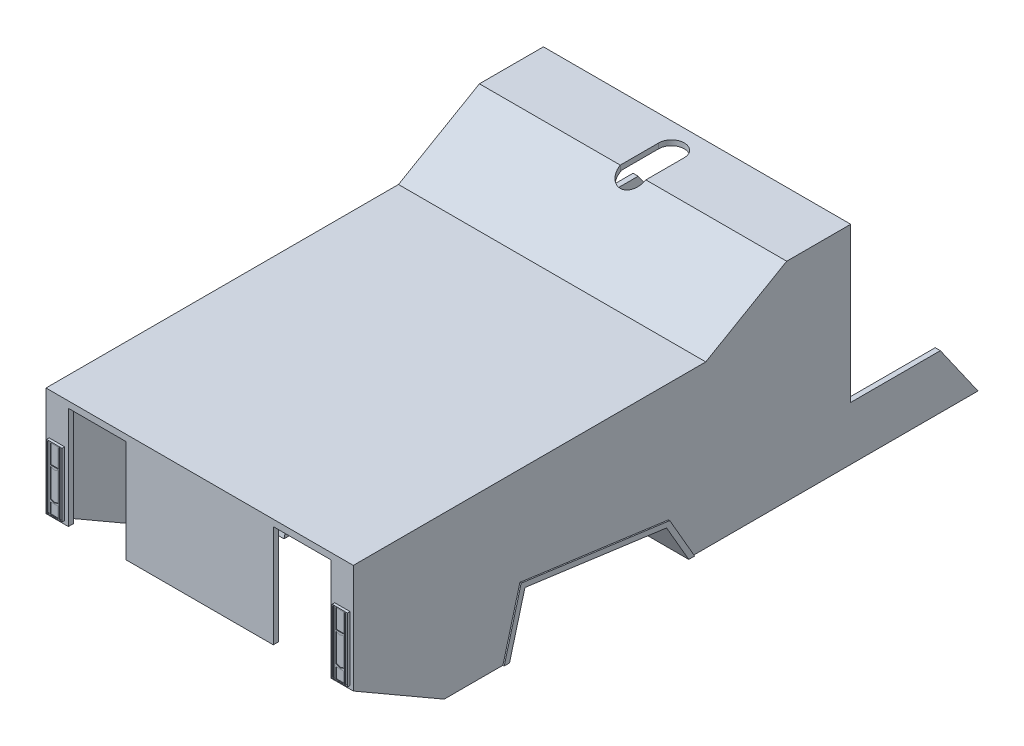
ISO-10303-21;
HEADER;
FILE_DESCRIPTION(('STEP AP214'),'2;1');
FILE_NAME('part.step','',(''),(''),'','','');
FILE_SCHEMA(('AUTOMOTIVE_DESIGN { 1 0 10303 214 1 1 1 1 }'));
ENDSEC;
DATA;
#1=APPLICATION_CONTEXT('core data for automotive mechanical design processes');
#2=APPLICATION_PROTOCOL_DEFINITION('international standard','automotive_design',2000,#1);
#3=PRODUCT_CONTEXT('',#1,'mechanical');
#4=PRODUCT('Part','Part','',(#3));
#5=PRODUCT_RELATED_PRODUCT_CATEGORY('part','',(#4));
#6=PRODUCT_DEFINITION_FORMATION('','',#4);
#7=PRODUCT_DEFINITION_CONTEXT('part definition',#1,'design');
#8=PRODUCT_DEFINITION('design','',#6,#7);
#9=PRODUCT_DEFINITION_SHAPE('','',#8);
#10=(LENGTH_UNIT() NAMED_UNIT(*) SI_UNIT(.MILLI.,.METRE.));
#11=(NAMED_UNIT(*) PLANE_ANGLE_UNIT() SI_UNIT($,.RADIAN.));
#12=(NAMED_UNIT(*) SI_UNIT($,.STERADIAN.) SOLID_ANGLE_UNIT());
#13=UNCERTAINTY_MEASURE_WITH_UNIT(LENGTH_MEASURE(1.E-05),#10,'distance_accuracy_value','');
#14=(GEOMETRIC_REPRESENTATION_CONTEXT(3) GLOBAL_UNCERTAINTY_ASSIGNED_CONTEXT((#13)) GLOBAL_UNIT_ASSIGNED_CONTEXT((#10,
#11,#12)) REPRESENTATION_CONTEXT('',''));
#15=CARTESIAN_POINT('',(0.,0.,0.));
#16=DIRECTION('',(0.,0.,1.));
#17=DIRECTION('',(1.,0.,0.));
#18=AXIS2_PLACEMENT_3D('',#15,#16,#17);
#19=CARTESIAN_POINT('',(0.,0.,2492.5));
#20=DIRECTION('',(0.,0.,-1.));
#21=DIRECTION('',(1.,0.,0.));
#22=AXIS2_PLACEMENT_3D('',#19,#20,#21);
#23=PLANE('',#22);
#24=DIRECTION('',(0.,-1.,0.));
#25=VECTOR('',#24,1.);
#26=CARTESIAN_POINT('',(1145.,-317.5,2492.5));
#27=LINE('',#26,#25);
#28=CARTESIAN_POINT('',(1145.,-232.5,2492.5));
#29=VERTEX_POINT('',#28);
#30=CARTESIAN_POINT('',(1145.,-317.5,2492.5));
#31=VERTEX_POINT('',#30);
#32=EDGE_CURVE('E66',#29,#31,#27,.T.);
#33=ORIENTED_EDGE('',*,*,#32,.T.);
#34=DIRECTION('',(-1.,0.,0.));
#35=VECTOR('',#34,1.);
#36=CARTESIAN_POINT('',(1085.,-317.5,2492.5));
#37=LINE('',#36,#35);
#38=CARTESIAN_POINT('',(1085.,-317.5,2492.5));
#39=VERTEX_POINT('',#38);
#40=EDGE_CURVE('E800',#31,#39,#37,.T.);
#41=ORIENTED_EDGE('',*,*,#40,.T.);
#42=DIRECTION('',(0.,1.,0.));
#43=VECTOR('',#42,1.);
#44=CARTESIAN_POINT('',(1085.,-232.5,2492.5));
#45=LINE('',#44,#43);
#46=CARTESIAN_POINT('',(1085.,-232.5,2492.5));
#47=VERTEX_POINT('',#46);
#48=EDGE_CURVE('E811',#39,#47,#45,.T.);
#49=ORIENTED_EDGE('',*,*,#48,.T.);
#50=DIRECTION('',(1.,0.,0.));
#51=VECTOR('',#50,1.);
#52=CARTESIAN_POINT('',(1145.,-232.5,2492.5));
#53=LINE('',#52,#51);
#54=EDGE_CURVE('E808',#47,#29,#53,.T.);
#55=ORIENTED_EDGE('',*,*,#54,.T.);
#56=EDGE_LOOP('',(#33,#41,#49,#55));
#57=FACE_BOUND('',#56,.T.);
#58=DIRECTION('',(0.,-1.,0.));
#59=VECTOR('',#58,1.);
#60=CARTESIAN_POINT('',(1145.,167.5,2492.5));
#61=LINE('',#60,#59);
#62=CARTESIAN_POINT('',(1145.,167.5,2492.5));
#63=VERTEX_POINT('',#62);
#64=CARTESIAN_POINT('',(1145.,17.4999999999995,2492.5));
#65=VERTEX_POINT('',#64);
#66=EDGE_CURVE('E785',#63,#65,#61,.T.);
#67=ORIENTED_EDGE('',*,*,#66,.T.);
#68=DIRECTION('',(-1.,0.,0.));
#69=VECTOR('',#68,1.);
#70=CARTESIAN_POINT('',(1145.,17.4999999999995,2492.5));
#71=LINE('',#70,#69);
#72=CARTESIAN_POINT('',(1085.,17.4999999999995,2492.5));
#73=VERTEX_POINT('',#72);
#74=EDGE_CURVE('E857',#65,#73,#71,.T.);
#75=ORIENTED_EDGE('',*,*,#74,.T.);
#76=DIRECTION('',(0.,1.,0.));
#77=VECTOR('',#76,1.);
#78=CARTESIAN_POINT('',(1085.,167.5,2492.5));
#79=LINE('',#78,#77);
#80=CARTESIAN_POINT('',(1085.,167.5,2492.5));
#81=VERTEX_POINT('',#80);
#82=EDGE_CURVE('E869',#73,#81,#79,.T.);
#83=ORIENTED_EDGE('',*,*,#82,.T.);
#84=DIRECTION('',(1.,0.,0.));
#85=VECTOR('',#84,1.);
#86=CARTESIAN_POINT('',(1145.,167.5,2492.5));
#87=LINE('',#86,#85);
#88=EDGE_CURVE('E866',#81,#63,#87,.T.);
#89=ORIENTED_EDGE('',*,*,#88,.T.);
#90=EDGE_LOOP('',(#67,#75,#83,#89));
#91=FACE_BOUND('',#90,.T.);
#92=DIRECTION('',(0.,-1.,0.));
#93=VECTOR('',#92,1.);
#94=CARTESIAN_POINT('',(1175.,-325.,2492.5));
#95=LINE('',#94,#93);
#96=CARTESIAN_POINT('',(1175.,175.,2492.5));
#97=VERTEX_POINT('',#96);
#98=CARTESIAN_POINT('',(1175.,-325.,2492.5));
#99=VERTEX_POINT('',#98);
#100=EDGE_CURVE('E882',#97,#99,#95,.T.);
#101=ORIENTED_EDGE('',*,*,#100,.F.);
#102=DIRECTION('',(1.,0.,0.));
#103=VECTOR('',#102,1.);
#104=CARTESIAN_POINT('',(1175.,175.,2492.5));
#105=LINE('',#104,#103);
#106=CARTESIAN_POINT('',(1055.,175.,2492.5));
#107=VERTEX_POINT('',#106);
#108=EDGE_CURVE('E885',#107,#97,#105,.T.);
#109=ORIENTED_EDGE('',*,*,#108,.F.);
#110=DIRECTION('',(0.,1.,0.));
#111=VECTOR('',#110,1.);
#112=CARTESIAN_POINT('',(1055.,-325.,2492.5));
#113=LINE('',#112,#111);
#114=CARTESIAN_POINT('',(1055.,-325.,2492.5));
#115=VERTEX_POINT('',#114);
#116=EDGE_CURVE('E889',#115,#107,#113,.T.);
#117=ORIENTED_EDGE('',*,*,#116,.F.);
#118=DIRECTION('',(-1.,0.,0.));
#119=VECTOR('',#118,1.);
#120=CARTESIAN_POINT('',(1175.,-325.,2492.5));
#121=LINE('',#120,#119);
#122=EDGE_CURVE('E892',#99,#115,#121,.T.);
#123=ORIENTED_EDGE('',*,*,#122,.F.);
#124=EDGE_LOOP('',(#101,#109,#117,#123));
#125=FACE_BOUND('',#124,.T.);
#126=DIRECTION('',(0.,1.,0.));
#127=VECTOR('',#126,1.);
#128=CARTESIAN_POINT('',(1062.5,167.5,2492.5));
#129=LINE('',#128,#127);
#130=CARTESIAN_POINT('',(1062.5,-317.5,2492.5));
#131=VERTEX_POINT('',#130);
#132=CARTESIAN_POINT('',(1062.5,167.5,2492.5));
#133=VERTEX_POINT('',#132);
#134=EDGE_CURVE('E833',#131,#133,#129,.T.);
#135=ORIENTED_EDGE('',*,*,#134,.T.);
#136=DIRECTION('',(1.,0.,0.));
#137=VECTOR('',#136,1.);
#138=CARTESIAN_POINT('',(1062.5,167.5,2492.5));
#139=LINE('',#138,#137);
#140=CARTESIAN_POINT('',(1077.5,167.5,2492.5));
#141=VERTEX_POINT('',#140);
#142=EDGE_CURVE('E826',#133,#141,#139,.T.);
#143=ORIENTED_EDGE('',*,*,#142,.T.);
#144=DIRECTION('',(0.,-1.,0.));
#145=VECTOR('',#144,1.);
#146=CARTESIAN_POINT('',(1077.5,167.5,2492.5));
#147=LINE('',#146,#145);
#148=CARTESIAN_POINT('',(1077.5,-317.5,2492.5));
#149=VERTEX_POINT('',#148);
#150=EDGE_CURVE('E840',#141,#149,#147,.T.);
#151=ORIENTED_EDGE('',*,*,#150,.T.);
#152=DIRECTION('',(-1.,0.,0.));
#153=VECTOR('',#152,1.);
#154=CARTESIAN_POINT('',(1062.5,-317.5,2492.5));
#155=LINE('',#154,#153);
#156=EDGE_CURVE('E836',#149,#131,#155,.T.);
#157=ORIENTED_EDGE('',*,*,#156,.T.);
#158=EDGE_LOOP('',(#135,#143,#151,#157));
#159=FACE_BOUND('',#158,.T.);
#160=DIRECTION('',(0.,-1.,0.));
#161=VECTOR('',#160,1.);
#162=CARTESIAN_POINT('',(1145.,-213.973242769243,2492.5));
#163=LINE('',#162,#161);
#164=CARTESIAN_POINT('',(1145.,7.49999999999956,2492.5));
#165=VERTEX_POINT('',#164);
#166=CARTESIAN_POINT('',(1145.,-213.973242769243,2492.5));
#167=VERTEX_POINT('',#166);
#168=EDGE_CURVE('E764',#165,#167,#163,.T.);
#169=ORIENTED_EDGE('',*,*,#168,.T.);
#170=DIRECTION('',(-0.939692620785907,-0.342020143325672,0.));
#171=VECTOR('',#170,1.);
#172=CARTESIAN_POINT('',(1115.,-224.892349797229,2492.5));
#173=LINE('',#172,#171);
#174=CARTESIAN_POINT('',(1115.,-224.892349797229,2492.5));
#175=VERTEX_POINT('',#174);
#176=EDGE_CURVE('E753',#167,#175,#173,.T.);
#177=ORIENTED_EDGE('',*,*,#176,.T.);
#178=DIRECTION('',(-0.939692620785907,0.342020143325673,0.));
#179=VECTOR('',#178,1.);
#180=CARTESIAN_POINT('',(1085.,-213.973242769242,2492.5));
#181=LINE('',#180,#179);
#182=CARTESIAN_POINT('',(1085.,-213.973242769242,2492.5));
#183=VERTEX_POINT('',#182);
#184=EDGE_CURVE('E777',#175,#183,#181,.T.);
#185=ORIENTED_EDGE('',*,*,#184,.T.);
#186=DIRECTION('',(0.,1.,0.));
#187=VECTOR('',#186,1.);
#188=CARTESIAN_POINT('',(1085.,7.49999999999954,2492.5));
#189=LINE('',#188,#187);
#190=CARTESIAN_POINT('',(1085.,7.49999999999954,2492.5));
#191=VERTEX_POINT('',#190);
#192=EDGE_CURVE('E774',#183,#191,#189,.T.);
#193=ORIENTED_EDGE('',*,*,#192,.T.);
#194=DIRECTION('',(0.939692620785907,-0.342020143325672,0.));
#195=VECTOR('',#194,1.);
#196=CARTESIAN_POINT('',(1115.,-3.41910702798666,2492.5));
#197=LINE('',#196,#195);
#198=CARTESIAN_POINT('',(1115.,-3.41910702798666,2492.5));
#199=VERTEX_POINT('',#198);
#200=EDGE_CURVE('E771',#191,#199,#197,.T.);
#201=ORIENTED_EDGE('',*,*,#200,.T.);
#202=DIRECTION('',(0.939692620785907,0.342020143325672,0.));
#203=VECTOR('',#202,1.);
#204=CARTESIAN_POINT('',(1145.,7.49999999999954,2492.5));
#205=LINE('',#204,#203);
#206=EDGE_CURVE('E767',#199,#165,#205,.T.);
#207=ORIENTED_EDGE('',*,*,#206,.T.);
#208=EDGE_LOOP('',(#169,#177,#185,#193,#201,#207));
#209=FACE_BOUND('',#208,.T.);
#210=DIRECTION('',(0.,-1.,0.));
#211=VECTOR('',#210,1.);
#212=CARTESIAN_POINT('',(1167.5,167.5,2492.5));
#213=LINE('',#212,#211);
#214=CARTESIAN_POINT('',(1167.5,167.5,2492.5));
#215=VERTEX_POINT('',#214);
#216=CARTESIAN_POINT('',(1167.5,-317.5,2492.5));
#217=VERTEX_POINT('',#216);
#218=EDGE_CURVE('E58',#215,#217,#213,.T.);
#219=ORIENTED_EDGE('',*,*,#218,.T.);
#220=DIRECTION('',(-1.,0.,0.));
#221=VECTOR('',#220,1.);
#222=CARTESIAN_POINT('',(1167.5,-317.5,2492.5));
#223=LINE('',#222,#221);
#224=CARTESIAN_POINT('',(1152.5,-317.5,2492.5));
#225=VERTEX_POINT('',#224);
#226=EDGE_CURVE('E729',#217,#225,#223,.T.);
#227=ORIENTED_EDGE('',*,*,#226,.T.);
#228=DIRECTION('',(0.,1.,0.));
#229=VECTOR('',#228,1.);
#230=CARTESIAN_POINT('',(1152.5,167.5,2492.5));
#231=LINE('',#230,#229);
#232=CARTESIAN_POINT('',(1152.5,167.5,2492.5));
#233=VERTEX_POINT('',#232);
#234=EDGE_CURVE('E732',#225,#233,#231,.T.);
#235=ORIENTED_EDGE('',*,*,#234,.T.);
#236=DIRECTION('',(1.,0.,0.));
#237=VECTOR('',#236,1.);
#238=CARTESIAN_POINT('',(1167.5,167.5,2492.5));
#239=LINE('',#238,#237);
#240=EDGE_CURVE('E738',#233,#215,#239,.T.);
#241=ORIENTED_EDGE('',*,*,#240,.T.);
#242=EDGE_LOOP('',(#219,#227,#235,#241));
#243=FACE_BOUND('',#242,.T.);
#244=ADVANCED_FACE('F43',(#57,#91,#125,#159,#209,#243),#23,.F.);
#245=CARTESIAN_POINT('',(1200.,500.,2472.5));
#246=DIRECTION('',(0.,0.,-1.));
#247=DIRECTION('',(0.,1.,0.));
#248=AXIS2_PLACEMENT_3D('',#245,#246,#247);
#249=PLANE('',#248);
#250=DIRECTION('',(1.,0.,0.));
#251=VECTOR('',#250,1.);
#252=CARTESIAN_POINT('',(1175.,175.,2472.5));
#253=LINE('',#252,#251);
#254=CARTESIAN_POINT('',(1055.,175.,2472.5));
#255=VERTEX_POINT('',#254);
#256=CARTESIAN_POINT('',(1175.,175.,2472.5));
#257=VERTEX_POINT('',#256);
#258=EDGE_CURVE('E898',#255,#257,#253,.T.);
#259=ORIENTED_EDGE('',*,*,#258,.T.);
#260=DIRECTION('',(0.,-1.,0.));
#261=VECTOR('',#260,1.);
#262=CARTESIAN_POINT('',(1175.,-325.,2472.5));
#263=LINE('',#262,#261);
#264=CARTESIAN_POINT('',(1175.,-325.,2472.5));
#265=VERTEX_POINT('',#264);
#266=EDGE_CURVE('E745',#257,#265,#263,.T.);
#267=ORIENTED_EDGE('',*,*,#266,.T.);
#268=DIRECTION('',(-1.,0.,0.));
#269=VECTOR('',#268,1.);
#270=CARTESIAN_POINT('',(1175.,-325.,2472.5));
#271=LINE('',#270,#269);
#272=CARTESIAN_POINT('',(1055.,-325.,2472.5));
#273=VERTEX_POINT('',#272);
#274=EDGE_CURVE('E886',#265,#273,#271,.T.);
#275=ORIENTED_EDGE('',*,*,#274,.T.);
#276=DIRECTION('',(0.,1.,0.));
#277=VECTOR('',#276,1.);
#278=CARTESIAN_POINT('',(1055.,-325.,2472.5));
#279=LINE('',#278,#277);
#280=EDGE_CURVE('E901',#273,#255,#279,.T.);
#281=ORIENTED_EDGE('',*,*,#280,.T.);
#282=EDGE_LOOP('',(#259,#267,#275,#281));
#283=FACE_BOUND('',#282,.T.);
#284=DIRECTION('',(0.,-1.,0.));
#285=VECTOR('',#284,1.);
#286=CARTESIAN_POINT('',(1025.,-350.,2472.5));
#287=LINE('',#286,#285);
#288=CARTESIAN_POINT('',(1025.,450.,2472.5));
#289=VERTEX_POINT('',#288);
#290=CARTESIAN_POINT('',(1025.,-350.,2472.5));
#291=VERTEX_POINT('',#290);
#292=EDGE_CURVE('E1123',#289,#291,#287,.T.);
#293=ORIENTED_EDGE('',*,*,#292,.T.);
#294=DIRECTION('',(-1.,0.,0.));
#295=VECTOR('',#294,1.);
#296=CARTESIAN_POINT('',(1200.,-350.,2472.5));
#297=LINE('',#296,#295);
#298=CARTESIAN_POINT('',(1160.,-350.,2472.5));
#299=VERTEX_POINT('',#298);
#300=EDGE_CURVE('E1443',#299,#291,#297,.T.);
#301=ORIENTED_EDGE('',*,*,#300,.F.);
#302=DIRECTION('',(-1.,0.,0.));
#303=VECTOR('',#302,1.);
#304=CARTESIAN_POINT('',(1200.,-350.,2472.5));
#305=LINE('',#304,#303);
#306=CARTESIAN_POINT('',(1200.,-350.,2472.5));
#307=VERTEX_POINT('',#306);
#308=EDGE_CURVE('E1511',#307,#299,#305,.T.);
#309=ORIENTED_EDGE('',*,*,#308,.F.);
#310=DIRECTION('',(0.,-1.,0.));
#311=VECTOR('',#310,1.);
#312=CARTESIAN_POINT('',(1200.,500.,2472.5));
#313=LINE('',#312,#311);
#314=CARTESIAN_POINT('',(1200.,500.,2472.5));
#315=VERTEX_POINT('',#314);
#316=EDGE_CURVE('E1475',#315,#307,#313,.T.);
#317=ORIENTED_EDGE('',*,*,#316,.F.);
#318=DIRECTION('',(-1.,0.,0.));
#319=VECTOR('',#318,1.);
#320=CARTESIAN_POINT('',(1200.,500.,2472.5));
#321=LINE('',#320,#319);
#322=CARTESIAN_POINT('',(-1200.,500.,2472.5));
#323=VERTEX_POINT('',#322);
#324=EDGE_CURVE('E1514',#315,#323,#321,.T.);
#325=ORIENTED_EDGE('',*,*,#324,.T.);
#326=DIRECTION('',(0.,-1.,0.));
#327=VECTOR('',#326,1.);
#328=CARTESIAN_POINT('',(-1200.,500.,2472.5));
#329=LINE('',#328,#327);
#330=CARTESIAN_POINT('',(-1200.,-350.,2472.5));
#331=VERTEX_POINT('',#330);
#332=EDGE_CURVE('E1361',#323,#331,#329,.T.);
#333=ORIENTED_EDGE('',*,*,#332,.T.);
#334=DIRECTION('',(1.,0.,0.));
#335=VECTOR('',#334,1.);
#336=CARTESIAN_POINT('',(-1200.,-350.,2472.5));
#337=LINE('',#336,#335);
#338=CARTESIAN_POINT('',(-1160.,-350.,2472.5));
#339=VERTEX_POINT('',#338);
#340=EDGE_CURVE('E1377',#331,#339,#337,.T.);
#341=ORIENTED_EDGE('',*,*,#340,.T.);
#342=CARTESIAN_POINT('',(-1025.,-350.,2472.5));
#343=VERTEX_POINT('',#342);
#344=EDGE_CURVE('E1441',#343,#339,#297,.T.);
#345=ORIENTED_EDGE('',*,*,#344,.F.);
#346=DIRECTION('',(0.,-1.,0.));
#347=VECTOR('',#346,1.);
#348=CARTESIAN_POINT('',(-1025.,-350.,2472.5));
#349=LINE('',#348,#347);
#350=CARTESIAN_POINT('',(-1025.,450.,2472.5));
#351=VERTEX_POINT('',#350);
#352=EDGE_CURVE('E1135',#351,#343,#349,.T.);
#353=ORIENTED_EDGE('',*,*,#352,.F.);
#354=DIRECTION('',(-1.,0.,0.));
#355=VECTOR('',#354,1.);
#356=CARTESIAN_POINT('',(-1025.,450.,2472.5));
#357=LINE('',#356,#355);
#358=CARTESIAN_POINT('',(-575.,450.,2472.5));
#359=VERTEX_POINT('',#358);
#360=EDGE_CURVE('E1146',#359,#351,#357,.T.);
#361=ORIENTED_EDGE('',*,*,#360,.F.);
#362=DIRECTION('',(0.,1.,0.));
#363=VECTOR('',#362,1.);
#364=CARTESIAN_POINT('',(-575.,-350.,2472.5));
#365=LINE('',#364,#363);
#366=CARTESIAN_POINT('',(-575.,-350.,2472.5));
#367=VERTEX_POINT('',#366);
#368=EDGE_CURVE('E1143',#367,#359,#365,.T.);
#369=ORIENTED_EDGE('',*,*,#368,.F.);
#370=CARTESIAN_POINT('',(575.,-350.,2472.5));
#371=VERTEX_POINT('',#370);
#372=EDGE_CURVE('E1447',#371,#367,#297,.T.);
#373=ORIENTED_EDGE('',*,*,#372,.F.);
#374=DIRECTION('',(0.,1.,0.));
#375=VECTOR('',#374,1.);
#376=CARTESIAN_POINT('',(575.,-350.,2472.5));
#377=LINE('',#376,#375);
#378=CARTESIAN_POINT('',(575.,450.,2472.5));
#379=VERTEX_POINT('',#378);
#380=EDGE_CURVE('E1129',#371,#379,#377,.T.);
#381=ORIENTED_EDGE('',*,*,#380,.T.);
#382=DIRECTION('',(1.,0.,0.));
#383=VECTOR('',#382,1.);
#384=CARTESIAN_POINT('',(1025.,450.,2472.5));
#385=LINE('',#384,#383);
#386=EDGE_CURVE('E1126',#379,#289,#385,.T.);
#387=ORIENTED_EDGE('',*,*,#386,.T.);
#388=EDGE_LOOP('',(#293,#301,#309,#317,#325,#333,#341,#345,#353,#361,#369,#373,#381,#387));
#389=FACE_BOUND('',#388,.T.);
#390=DIRECTION('',(0.,-1.,0.));
#391=VECTOR('',#390,1.);
#392=CARTESIAN_POINT('',(-1175.,-325.,2472.5));
#393=LINE('',#392,#391);
#394=CARTESIAN_POINT('',(-1175.,175.,2472.5));
#395=VERTEX_POINT('',#394);
#396=CARTESIAN_POINT('',(-1175.,-325.,2472.5));
#397=VERTEX_POINT('',#396);
#398=EDGE_CURVE('E942',#395,#397,#393,.T.);
#399=ORIENTED_EDGE('',*,*,#398,.F.);
#400=DIRECTION('',(-1.,0.,0.));
#401=VECTOR('',#400,1.);
#402=CARTESIAN_POINT('',(-1175.,175.,2472.5));
#403=LINE('',#402,#401);
#404=CARTESIAN_POINT('',(-1055.,175.,2472.5));
#405=VERTEX_POINT('',#404);
#406=EDGE_CURVE('E1095',#405,#395,#403,.T.);
#407=ORIENTED_EDGE('',*,*,#406,.F.);
#408=DIRECTION('',(0.,1.,0.));
#409=VECTOR('',#408,1.);
#410=CARTESIAN_POINT('',(-1055.,-325.,2472.5));
#411=LINE('',#410,#409);
#412=CARTESIAN_POINT('',(-1055.,-325.,2472.5));
#413=VERTEX_POINT('',#412);
#414=EDGE_CURVE('E1107',#413,#405,#411,.T.);
#415=ORIENTED_EDGE('',*,*,#414,.F.);
#416=DIRECTION('',(1.,0.,0.));
#417=VECTOR('',#416,1.);
#418=CARTESIAN_POINT('',(-1175.,-325.,2472.5));
#419=LINE('',#418,#417);
#420=EDGE_CURVE('E1104',#397,#413,#419,.T.);
#421=ORIENTED_EDGE('',*,*,#420,.F.);
#422=EDGE_LOOP('',(#399,#407,#415,#421));
#423=FACE_BOUND('',#422,.T.);
#424=ADVANCED_FACE('F1596',(#283,#389,#423),#249,.F.);
#425=CARTESIAN_POINT('',(1200.,-350.,2432.5));
#426=DIRECTION('',(0.,1.,0.));
#427=DIRECTION('',(0.,0.,1.));
#428=AXIS2_PLACEMENT_3D('',#425,#426,#427);
#429=PLANE('',#428);
#430=DIRECTION('',(0.,0.,1.));
#431=VECTOR('',#430,1.);
#432=CARTESIAN_POINT('',(1025.,-350.,2422.5));
#433=LINE('',#432,#431);
#434=CARTESIAN_POINT('',(1025.,-350.,2432.5));
#435=VERTEX_POINT('',#434);
#436=EDGE_CURVE('E1133',#435,#291,#433,.T.);
#437=ORIENTED_EDGE('',*,*,#436,.F.);
#438=DIRECTION('',(-1.,0.,0.));
#439=VECTOR('',#438,1.);
#440=CARTESIAN_POINT('',(1200.,-350.,2432.5));
#441=LINE('',#440,#439);
#442=CARTESIAN_POINT('',(1160.,-350.,2432.5));
#443=VERTEX_POINT('',#442);
#444=EDGE_CURVE('E1438',#443,#435,#441,.T.);
#445=ORIENTED_EDGE('',*,*,#444,.F.);
#446=DIRECTION('',(0.,0.,1.));
#447=VECTOR('',#446,1.);
#448=CARTESIAN_POINT('',(1160.,-350.,0.));
#449=LINE('',#448,#447);
#450=EDGE_CURVE('E1538',#443,#299,#449,.T.);
#451=ORIENTED_EDGE('',*,*,#450,.T.);
#452=ORIENTED_EDGE('',*,*,#300,.T.);
#453=EDGE_LOOP('',(#437,#445,#451,#452));
#454=FACE_BOUND('',#453,.T.);
#455=ADVANCED_FACE('F1699',(#454),#429,.F.);
#456=DIRECTION('',(0.,0.,1.));
#457=VECTOR('',#456,1.);
#458=CARTESIAN_POINT('',(575.,-350.,2422.5));
#459=LINE('',#458,#457);
#460=CARTESIAN_POINT('',(575.,-350.,2432.5));
#461=VERTEX_POINT('',#460);
#462=EDGE_CURVE('E1136',#461,#371,#459,.T.);
#463=ORIENTED_EDGE('',*,*,#462,.T.);
#464=ORIENTED_EDGE('',*,*,#372,.T.);
#465=DIRECTION('',(0.,0.,1.));
#466=VECTOR('',#465,1.);
#467=CARTESIAN_POINT('',(-575.,-350.,2422.5));
#468=LINE('',#467,#466);
#469=CARTESIAN_POINT('',(-575.,-350.,2432.5));
#470=VERTEX_POINT('',#469);
#471=EDGE_CURVE('E1155',#470,#367,#468,.T.);
#472=ORIENTED_EDGE('',*,*,#471,.F.);
#473=EDGE_CURVE('E1442',#461,#470,#441,.T.);
#474=ORIENTED_EDGE('',*,*,#473,.F.);
#475=EDGE_LOOP('',(#463,#464,#472,#474));
#476=FACE_BOUND('',#475,.T.);
#477=ADVANCED_FACE('F1601',(#476),#429,.F.);
#478=CARTESIAN_POINT('',(1200.,460.,2432.5));
#479=DIRECTION('',(0.,0.,1.));
#480=DIRECTION('',(0.,-1.,0.));
#481=AXIS2_PLACEMENT_3D('',#478,#479,#480);
#482=PLANE('',#481);
#483=DIRECTION('',(0.,-1.,0.));
#484=VECTOR('',#483,1.);
#485=CARTESIAN_POINT('',(1025.,460.,2432.5));
#486=LINE('',#485,#484);
#487=CARTESIAN_POINT('',(1025.,450.,2432.5));
#488=VERTEX_POINT('',#487);
#489=EDGE_CURVE('E11',#488,#435,#486,.T.);
#490=ORIENTED_EDGE('',*,*,#489,.F.);
#491=DIRECTION('',(1.,0.,0.));
#492=VECTOR('',#491,1.);
#493=CARTESIAN_POINT('',(1200.,450.,2432.5));
#494=LINE('',#493,#492);
#495=CARTESIAN_POINT('',(575.,450.,2432.5));
#496=VERTEX_POINT('',#495);
#497=EDGE_CURVE('E1576',#496,#488,#494,.T.);
#498=ORIENTED_EDGE('',*,*,#497,.F.);
#499=DIRECTION('',(0.,1.,0.));
#500=VECTOR('',#499,1.);
#501=CARTESIAN_POINT('',(575.,460.,2432.5));
#502=LINE('',#501,#500);
#503=EDGE_CURVE('E51',#461,#496,#502,.T.);
#504=ORIENTED_EDGE('',*,*,#503,.F.);
#505=ORIENTED_EDGE('',*,*,#473,.T.);
#506=DIRECTION('',(0.,1.,0.));
#507=VECTOR('',#506,1.);
#508=CARTESIAN_POINT('',(-575.,460.,2432.5));
#509=LINE('',#508,#507);
#510=CARTESIAN_POINT('',(-575.,450.,2432.5));
#511=VERTEX_POINT('',#510);
#512=EDGE_CURVE('E1567',#470,#511,#509,.T.);
#513=ORIENTED_EDGE('',*,*,#512,.T.);
#514=DIRECTION('',(-1.,0.,0.));
#515=VECTOR('',#514,1.);
#516=CARTESIAN_POINT('',(1200.,450.,2432.5));
#517=LINE('',#516,#515);
#518=CARTESIAN_POINT('',(-1025.,450.,2432.5));
#519=VERTEX_POINT('',#518);
#520=EDGE_CURVE('E1570',#511,#519,#517,.T.);
#521=ORIENTED_EDGE('',*,*,#520,.T.);
#522=DIRECTION('',(0.,-1.,0.));
#523=VECTOR('',#522,1.);
#524=CARTESIAN_POINT('',(-1025.,459.999999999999,2432.5));
#525=LINE('',#524,#523);
#526=CARTESIAN_POINT('',(-1025.,-350.,2432.5));
#527=VERTEX_POINT('',#526);
#528=EDGE_CURVE('E1573',#519,#527,#525,.T.);
#529=ORIENTED_EDGE('',*,*,#528,.T.);
#530=CARTESIAN_POINT('',(-1160.,-350.,2432.5));
#531=VERTEX_POINT('',#530);
#532=EDGE_CURVE('E1437',#527,#531,#441,.T.);
#533=ORIENTED_EDGE('',*,*,#532,.T.);
#534=DIRECTION('',(0.,1.,0.));
#535=VECTOR('',#534,1.);
#536=CARTESIAN_POINT('',(-1160.,460.,2432.5));
#537=LINE('',#536,#535);
#538=CARTESIAN_POINT('',(-1160.,460.,2432.5));
#539=VERTEX_POINT('',#538);
#540=EDGE_CURVE('E1412',#531,#539,#537,.T.);
#541=ORIENTED_EDGE('',*,*,#540,.T.);
#542=DIRECTION('',(-1.,0.,0.));
#543=VECTOR('',#542,1.);
#544=CARTESIAN_POINT('',(1200.,460.,2432.5));
#545=LINE('',#544,#543);
#546=CARTESIAN_POINT('',(1160.,460.,2432.5));
#547=VERTEX_POINT('',#546);
#548=EDGE_CURVE('E1434',#547,#539,#545,.T.);
#549=ORIENTED_EDGE('',*,*,#548,.F.);
#550=DIRECTION('',(0.,-1.,0.));
#551=VECTOR('',#550,1.);
#552=CARTESIAN_POINT('',(1160.,-1.3336382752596E-12,2432.5));
#553=LINE('',#552,#551);
#554=EDGE_CURVE('E1536',#547,#443,#553,.T.);
#555=ORIENTED_EDGE('',*,*,#554,.T.);
#556=ORIENTED_EDGE('',*,*,#444,.T.);
#557=EDGE_LOOP('',(#490,#498,#504,#505,#513,#521,#529,#533,#541,#549,#555,#556));
#558=FACE_BOUND('',#557,.T.);
#559=ADVANCED_FACE('F1586',(#558),#482,.F.);
#560=ORIENTED_EDGE('',*,*,#532,.F.);
#561=DIRECTION('',(0.,0.,1.));
#562=VECTOR('',#561,1.);
#563=CARTESIAN_POINT('',(-1025.,-350.,2422.5));
#564=LINE('',#563,#562);
#565=EDGE_CURVE('E1149',#527,#343,#564,.T.);
#566=ORIENTED_EDGE('',*,*,#565,.T.);
#567=ORIENTED_EDGE('',*,*,#344,.T.);
#568=DIRECTION('',(0.,0.,-1.));
#569=VECTOR('',#568,1.);
#570=CARTESIAN_POINT('',(-1160.,-350.,2432.5));
#571=LINE('',#570,#569);
#572=EDGE_CURVE('E1407',#339,#531,#571,.T.);
#573=ORIENTED_EDGE('',*,*,#572,.T.);
#574=EDGE_LOOP('',(#560,#566,#567,#573));
#575=FACE_BOUND('',#574,.T.);
#576=ADVANCED_FACE('F1612',(#575),#429,.F.);
#577=CARTESIAN_POINT('',(1160.,0.,0.));
#578=DIRECTION('',(1.,0.,0.));
#579=DIRECTION('',(0.,0.,-1.));
#580=AXIS2_PLACEMENT_3D('',#577,#578,#579);
#581=PLANE('',#580);
#582=CARTESIAN_POINT('',(1160.,120.,1222.5));
#583=DIRECTION('',(1.,0.,0.));
#584=DIRECTION('',(0.,0.,-1.));
#585=AXIS2_PLACEMENT_3D('',#582,#583,#584);
#586=CIRCLE('',#585,50.);
#587=CARTESIAN_POINT('',(1160.,120.,1172.5));
#588=VERTEX_POINT('',#587);
#589=EDGE_CURVE('E1524',#588,#588,#586,.T.);
#590=ORIENTED_EDGE('',*,*,#589,.T.);
#591=EDGE_LOOP('',(#590));
#592=FACE_BOUND('',#591,.T.);
#593=CARTESIAN_POINT('',(1160.,-120.,1222.5));
#594=DIRECTION('',(1.,0.,0.));
#595=DIRECTION('',(0.,0.,-1.));
#596=AXIS2_PLACEMENT_3D('',#593,#594,#595);
#597=CIRCLE('',#596,50.);
#598=CARTESIAN_POINT('',(1160.,-120.,1172.5));
#599=VERTEX_POINT('',#598);
#600=EDGE_CURVE('E1457',#599,#599,#597,.T.);
#601=ORIENTED_EDGE('',*,*,#600,.T.);
#602=EDGE_LOOP('',(#601));
#603=FACE_BOUND('',#602,.T.);
#604=CARTESIAN_POINT('',(1160.,120.,-1222.5));
#605=DIRECTION('',(1.,0.,0.));
#606=DIRECTION('',(0.,0.,-1.));
#607=AXIS2_PLACEMENT_3D('',#604,#605,#606);
#608=CIRCLE('',#607,50.);
#609=CARTESIAN_POINT('',(1160.,120.,-1272.5));
#610=VERTEX_POINT('',#609);
#611=EDGE_CURVE('E1451',#610,#610,#608,.T.);
#612=ORIENTED_EDGE('',*,*,#611,.T.);
#613=EDGE_LOOP('',(#612));
#614=FACE_BOUND('',#613,.T.);
#615=CARTESIAN_POINT('',(1160.,-120.,-1222.5));
#616=DIRECTION('',(1.,0.,0.));
#617=DIRECTION('',(0.,0.,-1.));
#618=AXIS2_PLACEMENT_3D('',#615,#616,#617);
#619=CIRCLE('',#618,50.);
#620=CARTESIAN_POINT('',(1160.,-120.,-1272.5));
#621=VERTEX_POINT('',#620);
#622=EDGE_CURVE('E1446',#621,#621,#619,.T.);
#623=ORIENTED_EDGE('',*,*,#622,.T.);
#624=EDGE_LOOP('',(#623));
#625=FACE_BOUND('',#624,.T.);
#626=DIRECTION('',(0.,0.965925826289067,-0.258819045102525));
#627=VECTOR('',#626,1.);
#628=CARTESIAN_POINT('',(1160.,275.032207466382,1026.43417198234));
#629=LINE('',#628,#627);
#630=CARTESIAN_POINT('',(1160.,-760.,1303.77021611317));
#631=VERTEX_POINT('',#630);
#632=CARTESIAN_POINT('',(1160.,-265.630795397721,1171.30438697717));
#633=VERTEX_POINT('',#632);
#634=EDGE_CURVE('E1288',#631,#633,#629,.T.);
#635=ORIENTED_EDGE('',*,*,#634,.F.);
#636=DIRECTION('',(0.,0.,-1.));
#637=VECTOR('',#636,1.);
#638=CARTESIAN_POINT('',(1160.,-760.,-2406.58716604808));
#639=LINE('',#638,#637);
#640=CARTESIAN_POINT('',(1160.,-760.,1762.35916889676));
#641=VERTEX_POINT('',#640);
#642=EDGE_CURVE('E1493',#641,#631,#639,.T.);
#643=ORIENTED_EDGE('',*,*,#642,.F.);
#644=DIRECTION('',(0.,-0.500000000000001,-0.866025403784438));
#645=VECTOR('',#644,1.);
#646=CARTESIAN_POINT('',(1160.,-350.,2472.5));
#647=LINE('',#646,#645);
#648=EDGE_CURVE('E1489',#299,#641,#647,.T.);
#649=ORIENTED_EDGE('',*,*,#648,.F.);
#650=ORIENTED_EDGE('',*,*,#450,.F.);
#651=ORIENTED_EDGE('',*,*,#554,.F.);
#652=DIRECTION('',(0.,0.,1.));
#653=VECTOR('',#652,1.);
#654=CARTESIAN_POINT('',(1160.,460.,0.));
#655=LINE('',#654,#653);
#656=CARTESIAN_POINT('',(1160.,460.,-291.019422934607));
#657=VERTEX_POINT('',#656);
#658=EDGE_CURVE('E1534',#657,#547,#655,.T.);
#659=ORIENTED_EDGE('',*,*,#658,.F.);
#660=DIRECTION('',(0.,-0.500000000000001,0.866025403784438));
#661=VECTOR('',#660,1.);
#662=CARTESIAN_POINT('',(1160.,218.984893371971,126.430987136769));
#663=LINE('',#662,#661);
#664=CARTESIAN_POINT('',(1160.,825.,-923.217967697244));
#665=VERTEX_POINT('',#664);
#666=EDGE_CURVE('E1532',#665,#657,#663,.T.);
#667=ORIENTED_EDGE('',*,*,#666,.F.);
#668=DIRECTION('',(0.,0.,1.));
#669=VECTOR('',#668,1.);
#670=CARTESIAN_POINT('',(1160.,824.999999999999,3.74399195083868E-13));
#671=LINE('',#670,#669);
#672=CARTESIAN_POINT('',(1160.,825.,-1412.5));
#673=VERTEX_POINT('',#672);
#674=EDGE_CURVE('E1528',#673,#665,#671,.T.);
#675=ORIENTED_EDGE('',*,*,#674,.F.);
#676=DIRECTION('',(0.,1.,0.));
#677=VECTOR('',#676,1.);
#678=CARTESIAN_POINT('',(1160.,120.,-1412.5));
#679=LINE('',#678,#677);
#680=CARTESIAN_POINT('',(1160.,-340.,-1412.5));
#681=VERTEX_POINT('',#680);
#682=EDGE_CURVE('E1463',#681,#673,#679,.T.);
#683=ORIENTED_EDGE('',*,*,#682,.F.);
#684=DIRECTION('',(0.,0.,1.));
#685=VECTOR('',#684,1.);
#686=CARTESIAN_POINT('',(1160.,-340.,-1412.5));
#687=LINE('',#686,#685);
#688=CARTESIAN_POINT('',(1160.,-340.,-2112.5));
#689=VERTEX_POINT('',#688);
#690=EDGE_CURVE('E1469',#689,#681,#687,.T.);
#691=ORIENTED_EDGE('',*,*,#690,.F.);
#692=DIRECTION('',(0.,0.819152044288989,0.57357643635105));
#693=VECTOR('',#692,1.);
#694=CARTESIAN_POINT('',(1160.,-340.,-2112.5));
#695=LINE('',#694,#693);
#696=CARTESIAN_POINT('',(1160.,-760.,-2406.58716604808));
#697=VERTEX_POINT('',#696);
#698=EDGE_CURVE('E1496',#697,#689,#695,.T.);
#699=ORIENTED_EDGE('',*,*,#698,.F.);
#700=CARTESIAN_POINT('',(1160.,-760.,-183.828852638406));
#701=VERTEX_POINT('',#700);
#702=EDGE_CURVE('E1492',#701,#697,#639,.T.);
#703=ORIENTED_EDGE('',*,*,#702,.F.);
#704=DIRECTION('',(0.,-0.866025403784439,-0.5));
#705=VECTOR('',#704,1.);
#706=CARTESIAN_POINT('',(1160.,-110.399771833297,191.218013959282));
#707=LINE('',#706,#705);
#708=CARTESIAN_POINT('',(1160.,-423.000311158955,10.738008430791));
#709=VERTEX_POINT('',#708);
#710=EDGE_CURVE('E1273',#709,#701,#707,.T.);
#711=ORIENTED_EDGE('',*,*,#710,.F.);
#712=DIRECTION('',(0.,-0.13436751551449,-0.990931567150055));
#713=VECTOR('',#712,1.);
#714=CARTESIAN_POINT('',(1160.,-416.792952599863,56.5159445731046));
#715=LINE('',#714,#713);
#716=EDGE_CURVE('E1286',#633,#709,#715,.T.);
#717=ORIENTED_EDGE('',*,*,#716,.F.);
#718=EDGE_LOOP('',(#635,#643,#649,#650,#651,#659,#667,#675,#683,#691,#699,#703,#711,#717));
#719=FACE_BOUND('',#718,.T.);
#720=ADVANCED_FACE('F1679',(#592,#603,#614,#625,#719),#581,.F.);
#721=CARTESIAN_POINT('',(1200.,0.,0.));
#722=DIRECTION('',(1.,0.,0.));
#723=DIRECTION('',(0.,0.,-1.));
#724=AXIS2_PLACEMENT_3D('',#721,#722,#723);
#725=PLANE('',#724);
#726=DIRECTION('',(0.,0.,-1.));
#727=VECTOR('',#726,1.);
#728=CARTESIAN_POINT('',(1200.,-760.,1762.35916889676));
#729=LINE('',#728,#727);
#730=CARTESIAN_POINT('',(1200.,-760.,1762.35916889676));
#731=VERTEX_POINT('',#730);
#732=CARTESIAN_POINT('',(1200.,-760.,1303.77021611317));
#733=VERTEX_POINT('',#732);
#734=EDGE_CURVE('E1480',#731,#733,#729,.T.);
#735=ORIENTED_EDGE('',*,*,#734,.T.);
#736=DIRECTION('',(0.,0.965925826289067,-0.258819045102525));
#737=VECTOR('',#736,1.);
#738=CARTESIAN_POINT('',(1200.,275.032207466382,1026.43417198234));
#739=LINE('',#738,#737);
#740=CARTESIAN_POINT('',(1200.,-265.630795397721,1171.30438697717));
#741=VERTEX_POINT('',#740);
#742=EDGE_CURVE('E1556',#733,#741,#739,.T.);
#743=ORIENTED_EDGE('',*,*,#742,.T.);
#744=DIRECTION('',(0.,-0.13436751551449,-0.990931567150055));
#745=VECTOR('',#744,1.);
#746=CARTESIAN_POINT('',(1200.,-416.792952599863,56.5159445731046));
#747=LINE('',#746,#745);
#748=CARTESIAN_POINT('',(1200.,-423.000311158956,10.7380084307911));
#749=VERTEX_POINT('',#748);
#750=EDGE_CURVE('E1554',#741,#749,#747,.T.);
#751=ORIENTED_EDGE('',*,*,#750,.T.);
#752=DIRECTION('',(0.,-0.866025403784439,-0.5));
#753=VECTOR('',#752,1.);
#754=CARTESIAN_POINT('',(1200.,-110.399771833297,191.218013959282));
#755=LINE('',#754,#753);
#756=CARTESIAN_POINT('',(1200.,-760.,-183.828852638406));
#757=VERTEX_POINT('',#756);
#758=EDGE_CURVE('E1552',#749,#757,#755,.T.);
#759=ORIENTED_EDGE('',*,*,#758,.T.);
#760=CARTESIAN_POINT('',(1200.,-760.,-2406.58716604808));
#761=VERTEX_POINT('',#760);
#762=EDGE_CURVE('E1479',#757,#761,#729,.T.);
#763=ORIENTED_EDGE('',*,*,#762,.T.);
#764=DIRECTION('',(0.,0.819152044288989,0.57357643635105));
#765=VECTOR('',#764,1.);
#766=CARTESIAN_POINT('',(1200.,-340.,-2112.5));
#767=LINE('',#766,#765);
#768=CARTESIAN_POINT('',(1200.,-340.,-2112.5));
#769=VERTEX_POINT('',#768);
#770=EDGE_CURVE('E1482',#761,#769,#767,.T.);
#771=ORIENTED_EDGE('',*,*,#770,.T.);
#772=DIRECTION('',(0.,0.,1.));
#773=VECTOR('',#772,1.);
#774=CARTESIAN_POINT('',(1200.,-340.,-1412.5));
#775=LINE('',#774,#773);
#776=CARTESIAN_POINT('',(1200.,-340.,-1412.5));
#777=VERTEX_POINT('',#776);
#778=EDGE_CURVE('E1484',#769,#777,#775,.T.);
#779=ORIENTED_EDGE('',*,*,#778,.T.);
#780=DIRECTION('',(0.,1.,0.));
#781=VECTOR('',#780,1.);
#782=CARTESIAN_POINT('',(1200.,-340.,-1412.5));
#783=LINE('',#782,#781);
#784=CARTESIAN_POINT('',(1200.,865.,-1412.5));
#785=VERTEX_POINT('',#784);
#786=EDGE_CURVE('E1466',#777,#785,#783,.T.);
#787=ORIENTED_EDGE('',*,*,#786,.T.);
#788=DIRECTION('',(0.,0.,1.));
#789=VECTOR('',#788,1.);
#790=CARTESIAN_POINT('',(1200.,865.,-1412.5));
#791=LINE('',#790,#789);
#792=CARTESIAN_POINT('',(1200.,865.,-912.5));
#793=VERTEX_POINT('',#792);
#794=EDGE_CURVE('E1468',#785,#793,#791,.T.);
#795=ORIENTED_EDGE('',*,*,#794,.T.);
#796=DIRECTION('',(0.,-0.500000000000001,0.866025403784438));
#797=VECTOR('',#796,1.);
#798=CARTESIAN_POINT('',(1200.,865.,-912.5));
#799=LINE('',#798,#797);
#800=CARTESIAN_POINT('',(1200.,500.,-280.301455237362));
#801=VERTEX_POINT('',#800);
#802=EDGE_CURVE('E1471',#793,#801,#799,.T.);
#803=ORIENTED_EDGE('',*,*,#802,.T.);
#804=DIRECTION('',(0.,0.,1.));
#805=VECTOR('',#804,1.);
#806=CARTESIAN_POINT('',(1200.,500.,-280.301455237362));
#807=LINE('',#806,#805);
#808=EDGE_CURVE('E1473',#801,#315,#807,.T.);
#809=ORIENTED_EDGE('',*,*,#808,.T.);
#810=ORIENTED_EDGE('',*,*,#316,.T.);
#811=DIRECTION('',(0.,-0.500000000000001,-0.866025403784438));
#812=VECTOR('',#811,1.);
#813=CARTESIAN_POINT('',(1200.,-350.,2472.5));
#814=LINE('',#813,#812);
#815=EDGE_CURVE('E1477',#307,#731,#814,.T.);
#816=ORIENTED_EDGE('',*,*,#815,.T.);
#817=EDGE_LOOP('',(#735,#743,#751,#759,#763,#771,#779,#787,#795,#803,#809,#810,#816));
#818=FACE_BOUND('',#817,.T.);
#819=ADVANCED_FACE('F1669',(#818),#725,.T.);
#820=CARTESIAN_POINT('',(1200.,-760.,-2406.58716604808));
#821=DIRECTION('',(0.,1.,0.));
#822=DIRECTION('',(0.,0.,1.));
#823=AXIS2_PLACEMENT_3D('',#820,#821,#822);
#824=PLANE('',#823);
#825=DIRECTION('',(1.,0.,0.));
#826=VECTOR('',#825,1.);
#827=CARTESIAN_POINT('',(-1200.,-760.,-137.640831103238));
#828=LINE('',#827,#826);
#829=CARTESIAN_POINT('',(510.,-760.,-137.640831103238));
#830=VERTEX_POINT('',#829);
#831=CARTESIAN_POINT('',(1210.,-760.,-137.640831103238));
#832=VERTEX_POINT('',#831);
#833=EDGE_CURVE('E1294',#830,#832,#828,.T.);
#834=ORIENTED_EDGE('',*,*,#833,.F.);
#835=DIRECTION('',(0.,0.,-1.));
#836=VECTOR('',#835,1.);
#837=CARTESIAN_POINT('',(510.,-760.,0.));
#838=LINE('',#837,#836);
#839=CARTESIAN_POINT('',(510.,-760.,-183.828852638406));
#840=VERTEX_POINT('',#839);
#841=EDGE_CURVE('E1256',#830,#840,#838,.T.);
#842=ORIENTED_EDGE('',*,*,#841,.T.);
#843=DIRECTION('',(1.,0.,0.));
#844=VECTOR('',#843,1.);
#845=CARTESIAN_POINT('',(510.,-760.,-183.828852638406));
#846=LINE('',#845,#844);
#847=EDGE_CURVE('E1279',#840,#701,#846,.T.);
#848=ORIENTED_EDGE('',*,*,#847,.T.);
#849=ORIENTED_EDGE('',*,*,#702,.T.);
#850=DIRECTION('',(-1.,0.,0.));
#851=VECTOR('',#850,1.);
#852=CARTESIAN_POINT('',(1200.,-760.,-2406.58716604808));
#853=LINE('',#852,#851);
#854=EDGE_CURVE('E1505',#761,#697,#853,.T.);
#855=ORIENTED_EDGE('',*,*,#854,.F.);
#856=ORIENTED_EDGE('',*,*,#762,.F.);
#857=CARTESIAN_POINT('',(1210.,-760.,-183.828852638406));
#858=VERTEX_POINT('',#857);
#859=EDGE_CURVE('E1282',#757,#858,#846,.T.);
#860=ORIENTED_EDGE('',*,*,#859,.T.);
#861=DIRECTION('',(0.,0.,-1.));
#862=VECTOR('',#861,1.);
#863=CARTESIAN_POINT('',(1210.,-760.,0.));
#864=LINE('',#863,#862);
#865=EDGE_CURVE('E1234',#832,#858,#864,.T.);
#866=ORIENTED_EDGE('',*,*,#865,.F.);
#867=EDGE_LOOP('',(#834,#842,#848,#849,#855,#856,#860,#866));
#868=FACE_BOUND('',#867,.T.);
#869=ADVANCED_FACE('F2047',(#868),#824,.F.);
#870=DIRECTION('',(1.,0.,0.));
#871=VECTOR('',#870,1.);
#872=CARTESIAN_POINT('',(-1200.,-760.,1262.35916889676));
#873=LINE('',#872,#871);
#874=CARTESIAN_POINT('',(510.,-760.,1262.35916889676));
#875=VERTEX_POINT('',#874);
#876=CARTESIAN_POINT('',(1210.,-760.,1262.35916889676));
#877=VERTEX_POINT('',#876);
#878=EDGE_CURVE('E1297',#875,#877,#873,.T.);
#879=ORIENTED_EDGE('',*,*,#878,.T.);
#880=CARTESIAN_POINT('',(1210.,-760.,1303.77021611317));
#881=VERTEX_POINT('',#880);
#882=EDGE_CURVE('E1230',#881,#877,#864,.T.);
#883=ORIENTED_EDGE('',*,*,#882,.F.);
#884=DIRECTION('',(1.,0.,0.));
#885=VECTOR('',#884,1.);
#886=CARTESIAN_POINT('',(510.,-760.,1303.77021611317));
#887=LINE('',#886,#885);
#888=EDGE_CURVE('E1269',#733,#881,#887,.T.);
#889=ORIENTED_EDGE('',*,*,#888,.F.);
#890=ORIENTED_EDGE('',*,*,#734,.F.);
#891=DIRECTION('',(-1.,0.,0.));
#892=VECTOR('',#891,1.);
#893=CARTESIAN_POINT('',(1200.,-760.,1762.35916889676));
#894=LINE('',#893,#892);
#895=EDGE_CURVE('E1508',#731,#641,#894,.T.);
#896=ORIENTED_EDGE('',*,*,#895,.T.);
#897=ORIENTED_EDGE('',*,*,#642,.T.);
#898=CARTESIAN_POINT('',(510.,-760.,1303.77021611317));
#899=VERTEX_POINT('',#898);
#900=EDGE_CURVE('E1283',#899,#631,#887,.T.);
#901=ORIENTED_EDGE('',*,*,#900,.F.);
#902=EDGE_CURVE('E1252',#899,#875,#838,.T.);
#903=ORIENTED_EDGE('',*,*,#902,.T.);
#904=EDGE_LOOP('',(#879,#883,#889,#890,#896,#897,#901,#903));
#905=FACE_BOUND('',#904,.T.);
#906=ADVANCED_FACE('F2059',(#905),#824,.F.);
#907=CARTESIAN_POINT('',(-1160.,0.,0.));
#908=DIRECTION('',(1.,0.,0.));
#909=DIRECTION('',(0.,0.,-1.));
#910=AXIS2_PLACEMENT_3D('',#907,#908,#909);
#911=PLANE('',#910);
#912=DIRECTION('',(0.,-0.965925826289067,0.258819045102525));
#913=VECTOR('',#912,1.);
#914=CARTESIAN_POINT('',(-1160.,275.032207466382,1026.43417198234));
#915=LINE('',#914,#913);
#916=CARTESIAN_POINT('',(-1160.,-265.630795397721,1171.30438697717));
#917=VERTEX_POINT('',#916);
#918=CARTESIAN_POINT('',(-1160.,-760.,1303.77021611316));
#919=VERTEX_POINT('',#918);
#920=EDGE_CURVE('E1224',#917,#919,#915,.T.);
#921=ORIENTED_EDGE('',*,*,#920,.F.);
#922=DIRECTION('',(0.,0.13436751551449,0.990931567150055));
#923=VECTOR('',#922,1.);
#924=CARTESIAN_POINT('',(-1160.,-416.792952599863,56.5159445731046));
#925=LINE('',#924,#923);
#926=CARTESIAN_POINT('',(-1160.,-423.000311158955,10.738008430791));
#927=VERTEX_POINT('',#926);
#928=EDGE_CURVE('E1205',#927,#917,#925,.T.);
#929=ORIENTED_EDGE('',*,*,#928,.F.);
#930=DIRECTION('',(0.,0.866025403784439,0.5));
#931=VECTOR('',#930,1.);
#932=CARTESIAN_POINT('',(-1160.,-110.399771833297,191.218013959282));
#933=LINE('',#932,#931);
#934=CARTESIAN_POINT('',(-1160.,-760.,-183.828852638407));
#935=VERTEX_POINT('',#934);
#936=EDGE_CURVE('E1221',#935,#927,#933,.T.);
#937=ORIENTED_EDGE('',*,*,#936,.F.);
#938=DIRECTION('',(0.,0.,-1.));
#939=VECTOR('',#938,1.);
#940=CARTESIAN_POINT('',(-1160.,-760.,-2406.58716604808));
#941=LINE('',#940,#939);
#942=CARTESIAN_POINT('',(-1160.,-760.,-2406.58716604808));
#943=VERTEX_POINT('',#942);
#944=EDGE_CURVE('E1382',#935,#943,#941,.T.);
#945=ORIENTED_EDGE('',*,*,#944,.T.);
#946=DIRECTION('',(0.,0.819152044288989,0.57357643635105));
#947=VECTOR('',#946,1.);
#948=CARTESIAN_POINT('',(-1160.,-340.,-2112.5));
#949=LINE('',#948,#947);
#950=CARTESIAN_POINT('',(-1160.,-340.,-2112.5));
#951=VERTEX_POINT('',#950);
#952=EDGE_CURVE('E1385',#943,#951,#949,.T.);
#953=ORIENTED_EDGE('',*,*,#952,.T.);
#954=DIRECTION('',(0.,0.,1.));
#955=VECTOR('',#954,1.);
#956=CARTESIAN_POINT('',(-1160.,-340.,-1412.5));
#957=LINE('',#956,#955);
#958=CARTESIAN_POINT('',(-1160.,-340.,-1412.5));
#959=VERTEX_POINT('',#958);
#960=EDGE_CURVE('E1352',#951,#959,#957,.T.);
#961=ORIENTED_EDGE('',*,*,#960,.T.);
#962=DIRECTION('',(0.,1.,0.));
#963=VECTOR('',#962,1.);
#964=CARTESIAN_POINT('',(-1160.,120.,-1412.5));
#965=LINE('',#964,#963);
#966=CARTESIAN_POINT('',(-1160.,825.,-1412.5));
#967=VERTEX_POINT('',#966);
#968=EDGE_CURVE('E1345',#959,#967,#965,.T.);
#969=ORIENTED_EDGE('',*,*,#968,.T.);
#970=DIRECTION('',(0.,0.,-1.));
#971=VECTOR('',#970,1.);
#972=CARTESIAN_POINT('',(-1160.,825.,-1412.5));
#973=LINE('',#972,#971);
#974=CARTESIAN_POINT('',(-1160.,825.,-923.217967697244));
#975=VERTEX_POINT('',#974);
#976=EDGE_CURVE('E1421',#975,#967,#973,.T.);
#977=ORIENTED_EDGE('',*,*,#976,.F.);
#978=DIRECTION('',(0.,0.500000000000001,-0.866025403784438));
#979=VECTOR('',#978,1.);
#980=CARTESIAN_POINT('',(-1160.,825.,-923.217967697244));
#981=LINE('',#980,#979);
#982=CARTESIAN_POINT('',(-1160.,460.,-291.019422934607));
#983=VERTEX_POINT('',#982);
#984=EDGE_CURVE('E1418',#983,#975,#981,.T.);
#985=ORIENTED_EDGE('',*,*,#984,.F.);
#986=DIRECTION('',(0.,0.,-1.));
#987=VECTOR('',#986,1.);
#988=CARTESIAN_POINT('',(-1160.,460.,-291.019422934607));
#989=LINE('',#988,#987);
#990=EDGE_CURVE('E1415',#539,#983,#989,.T.);
#991=ORIENTED_EDGE('',*,*,#990,.F.);
#992=ORIENTED_EDGE('',*,*,#540,.F.);
#993=ORIENTED_EDGE('',*,*,#572,.F.);
#994=DIRECTION('',(0.,-0.500000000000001,-0.866025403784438));
#995=VECTOR('',#994,1.);
#996=CARTESIAN_POINT('',(-1160.,-350.,2472.5));
#997=LINE('',#996,#995);
#998=CARTESIAN_POINT('',(-1160.,-760.,1762.35916889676));
#999=VERTEX_POINT('',#998);
#1000=EDGE_CURVE('E1379',#339,#999,#997,.T.);
#1001=ORIENTED_EDGE('',*,*,#1000,.T.);
#1002=EDGE_CURVE('E1383',#999,#919,#941,.T.);
#1003=ORIENTED_EDGE('',*,*,#1002,.T.);
#1004=EDGE_LOOP('',(#921,#929,#937,#945,#953,#961,#969,#977,#985,#991,#992,#993,#1001,#1003));
#1005=FACE_BOUND('',#1004,.T.);
#1006=CARTESIAN_POINT('',(-1160.,120.,1222.5));
#1007=DIRECTION('',(1.,0.,0.));
#1008=DIRECTION('',(0.,0.,-1.));
#1009=AXIS2_PLACEMENT_3D('',#1006,#1007,#1008);
#1010=CIRCLE('',#1009,50.);
#1011=CARTESIAN_POINT('',(-1160.,120.,1172.5));
#1012=VERTEX_POINT('',#1011);
#1013=EDGE_CURVE('E1393',#1012,#1012,#1010,.T.);
#1014=ORIENTED_EDGE('',*,*,#1013,.F.);
#1015=EDGE_LOOP('',(#1014));
#1016=FACE_BOUND('',#1015,.T.);
#1017=CARTESIAN_POINT('',(-1160.,-120.,1222.5));
#1018=DIRECTION('',(1.,0.,0.));
#1019=DIRECTION('',(0.,0.,-1.));
#1020=AXIS2_PLACEMENT_3D('',#1017,#1018,#1019);
#1021=CIRCLE('',#1020,50.);
#1022=CARTESIAN_POINT('',(-1160.,-120.,1172.5));
#1023=VERTEX_POINT('',#1022);
#1024=EDGE_CURVE('E1339',#1023,#1023,#1021,.T.);
#1025=ORIENTED_EDGE('',*,*,#1024,.F.);
#1026=EDGE_LOOP('',(#1025));
#1027=FACE_BOUND('',#1026,.T.);
#1028=CARTESIAN_POINT('',(-1160.,120.,-1222.5));
#1029=DIRECTION('',(1.,0.,0.));
#1030=DIRECTION('',(0.,0.,-1.));
#1031=AXIS2_PLACEMENT_3D('',#1028,#1029,#1030);
#1032=CIRCLE('',#1031,50.);
#1033=CARTESIAN_POINT('',(-1160.,120.,-1272.5));
#1034=VERTEX_POINT('',#1033);
#1035=EDGE_CURVE('E1333',#1034,#1034,#1032,.T.);
#1036=ORIENTED_EDGE('',*,*,#1035,.F.);
#1037=EDGE_LOOP('',(#1036));
#1038=FACE_BOUND('',#1037,.T.);
#1039=CARTESIAN_POINT('',(-1160.,-120.,-1222.5));
#1040=DIRECTION('',(1.,0.,0.));
#1041=DIRECTION('',(0.,0.,-1.));
#1042=AXIS2_PLACEMENT_3D('',#1039,#1040,#1041);
#1043=CIRCLE('',#1042,50.);
#1044=CARTESIAN_POINT('',(-1160.,-120.,-1272.5));
#1045=VERTEX_POINT('',#1044);
#1046=EDGE_CURVE('E1329',#1045,#1045,#1043,.T.);
#1047=ORIENTED_EDGE('',*,*,#1046,.F.);
#1048=EDGE_LOOP('',(#1047));
#1049=FACE_BOUND('',#1048,.T.);
#1050=ADVANCED_FACE('F1610',(#1005,#1016,#1027,#1038,#1049),#911,.T.);
#1051=CARTESIAN_POINT('',(-1200.,-760.,-2406.58716604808));
#1052=DIRECTION('',(0.,-1.,0.));
#1053=DIRECTION('',(0.,0.,-1.));
#1054=AXIS2_PLACEMENT_3D('',#1051,#1052,#1053);
#1055=PLANE('',#1054);
#1056=ORIENTED_EDGE('',*,*,#944,.F.);
#1057=DIRECTION('',(-1.,0.,0.));
#1058=VECTOR('',#1057,1.);
#1059=CARTESIAN_POINT('',(-510.,-760.,-183.828852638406));
#1060=LINE('',#1059,#1058);
#1061=CARTESIAN_POINT('',(-510.,-760.,-183.828852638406));
#1062=VERTEX_POINT('',#1061);
#1063=EDGE_CURVE('E1207',#1062,#935,#1060,.T.);
#1064=ORIENTED_EDGE('',*,*,#1063,.F.);
#1065=DIRECTION('',(0.,0.,-1.));
#1066=VECTOR('',#1065,1.);
#1067=CARTESIAN_POINT('',(-510.,-760.,0.));
#1068=LINE('',#1067,#1066);
#1069=CARTESIAN_POINT('',(-510.,-760.,-137.640831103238));
#1070=VERTEX_POINT('',#1069);
#1071=EDGE_CURVE('E1190',#1070,#1062,#1068,.T.);
#1072=ORIENTED_EDGE('',*,*,#1071,.F.);
#1073=CARTESIAN_POINT('',(-1210.,-760.,-137.640831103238));
#1074=VERTEX_POINT('',#1073);
#1075=EDGE_CURVE('E1291',#1074,#1070,#828,.T.);
#1076=ORIENTED_EDGE('',*,*,#1075,.F.);
#1077=DIRECTION('',(0.,0.,-1.));
#1078=VECTOR('',#1077,1.);
#1079=CARTESIAN_POINT('',(-1210.,-760.,0.));
#1080=LINE('',#1079,#1078);
#1081=CARTESIAN_POINT('',(-1210.,-760.,-183.828852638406));
#1082=VERTEX_POINT('',#1081);
#1083=EDGE_CURVE('E1168',#1074,#1082,#1080,.T.);
#1084=ORIENTED_EDGE('',*,*,#1083,.T.);
#1085=CARTESIAN_POINT('',(-1200.,-760.,-183.828852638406));
#1086=VERTEX_POINT('',#1085);
#1087=EDGE_CURVE('E1210',#1086,#1082,#1060,.T.);
#1088=ORIENTED_EDGE('',*,*,#1087,.F.);
#1089=DIRECTION('',(0.,0.,-1.));
#1090=VECTOR('',#1089,1.);
#1091=CARTESIAN_POINT('',(-1200.,-760.,1762.35916889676));
#1092=LINE('',#1091,#1090);
#1093=CARTESIAN_POINT('',(-1200.,-760.,-2406.58716604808));
#1094=VERTEX_POINT('',#1093);
#1095=EDGE_CURVE('E1367',#1086,#1094,#1092,.T.);
#1096=ORIENTED_EDGE('',*,*,#1095,.T.);
#1097=DIRECTION('',(1.,0.,0.));
#1098=VECTOR('',#1097,1.);
#1099=CARTESIAN_POINT('',(-1200.,-760.,-2406.58716604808));
#1100=LINE('',#1099,#1098);
#1101=EDGE_CURVE('E1396',#1094,#943,#1100,.T.);
#1102=ORIENTED_EDGE('',*,*,#1101,.T.);
#1103=EDGE_LOOP('',(#1056,#1064,#1072,#1076,#1084,#1088,#1096,#1102));
#1104=FACE_BOUND('',#1103,.T.);
#1105=ADVANCED_FACE('F1642',(#1104),#1055,.T.);
#1106=CARTESIAN_POINT('',(-1200.,-760.,1762.35916889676));
#1107=VERTEX_POINT('',#1106);
#1108=CARTESIAN_POINT('',(-1200.,-760.,1303.77021611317));
#1109=VERTEX_POINT('',#1108);
#1110=EDGE_CURVE('E1368',#1107,#1109,#1092,.T.);
#1111=ORIENTED_EDGE('',*,*,#1110,.T.);
#1112=DIRECTION('',(-1.,0.,0.));
#1113=VECTOR('',#1112,1.);
#1114=CARTESIAN_POINT('',(-510.,-760.,1303.77021611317));
#1115=LINE('',#1114,#1113);
#1116=CARTESIAN_POINT('',(-1210.,-760.,1303.77021611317));
#1117=VERTEX_POINT('',#1116);
#1118=EDGE_CURVE('E1206',#1109,#1117,#1115,.T.);
#1119=ORIENTED_EDGE('',*,*,#1118,.T.);
#1120=CARTESIAN_POINT('',(-1210.,-760.,1262.35916889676));
#1121=VERTEX_POINT('',#1120);
#1122=EDGE_CURVE('E1172',#1117,#1121,#1080,.T.);
#1123=ORIENTED_EDGE('',*,*,#1122,.T.);
#1124=CARTESIAN_POINT('',(-510.,-760.,1262.35916889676));
#1125=VERTEX_POINT('',#1124);
#1126=EDGE_CURVE('E1295',#1121,#1125,#873,.T.);
#1127=ORIENTED_EDGE('',*,*,#1126,.T.);
#1128=CARTESIAN_POINT('',(-510.,-760.,1303.77021611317));
#1129=VERTEX_POINT('',#1128);
#1130=EDGE_CURVE('E1193',#1129,#1125,#1068,.T.);
#1131=ORIENTED_EDGE('',*,*,#1130,.F.);
#1132=EDGE_CURVE('E1202',#1129,#919,#1115,.T.);
#1133=ORIENTED_EDGE('',*,*,#1132,.T.);
#1134=ORIENTED_EDGE('',*,*,#1002,.F.);
#1135=DIRECTION('',(1.,0.,0.));
#1136=VECTOR('',#1135,1.);
#1137=CARTESIAN_POINT('',(-1200.,-760.,1762.35916889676));
#1138=LINE('',#1137,#1136);
#1139=EDGE_CURVE('E1399',#1107,#999,#1138,.T.);
#1140=ORIENTED_EDGE('',*,*,#1139,.F.);
#1141=EDGE_LOOP('',(#1111,#1119,#1123,#1127,#1131,#1133,#1134,#1140));
#1142=FACE_BOUND('',#1141,.T.);
#1143=ADVANCED_FACE('F1625',(#1142),#1055,.T.);
#1144=CARTESIAN_POINT('',(-1200.,0.,0.));
#1145=DIRECTION('',(1.,0.,0.));
#1146=DIRECTION('',(0.,0.,-1.));
#1147=AXIS2_PLACEMENT_3D('',#1144,#1145,#1146);
#1148=PLANE('',#1147);
#1149=DIRECTION('',(0.,0.13436751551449,0.990931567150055));
#1150=VECTOR('',#1149,1.);
#1151=CARTESIAN_POINT('',(-1200.,-416.792952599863,56.5159445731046));
#1152=LINE('',#1151,#1150);
#1153=CARTESIAN_POINT('',(-1200.,-423.000311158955,10.738008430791));
#1154=VERTEX_POINT('',#1153);
#1155=CARTESIAN_POINT('',(-1200.,-265.630795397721,1171.30438697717));
#1156=VERTEX_POINT('',#1155);
#1157=EDGE_CURVE('E1558',#1154,#1156,#1152,.T.);
#1158=ORIENTED_EDGE('',*,*,#1157,.T.);
#1159=DIRECTION('',(0.,-0.965925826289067,0.258819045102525));
#1160=VECTOR('',#1159,1.);
#1161=CARTESIAN_POINT('',(-1200.,275.032207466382,1026.43417198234));
#1162=LINE('',#1161,#1160);
#1163=EDGE_CURVE('E1564',#1156,#1109,#1162,.T.);
#1164=ORIENTED_EDGE('',*,*,#1163,.T.);
#1165=ORIENTED_EDGE('',*,*,#1110,.F.);
#1166=DIRECTION('',(0.,-0.500000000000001,-0.866025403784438));
#1167=VECTOR('',#1166,1.);
#1168=CARTESIAN_POINT('',(-1200.,-350.,2472.5));
#1169=LINE('',#1168,#1167);
#1170=EDGE_CURVE('E1364',#331,#1107,#1169,.T.);
#1171=ORIENTED_EDGE('',*,*,#1170,.F.);
#1172=ORIENTED_EDGE('',*,*,#332,.F.);
#1173=DIRECTION('',(0.,0.,1.));
#1174=VECTOR('',#1173,1.);
#1175=CARTESIAN_POINT('',(-1200.,500.,-280.301455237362));
#1176=LINE('',#1175,#1174);
#1177=CARTESIAN_POINT('',(-1200.,500.,-280.301455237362));
#1178=VERTEX_POINT('',#1177);
#1179=EDGE_CURVE('E1358',#1178,#323,#1176,.T.);
#1180=ORIENTED_EDGE('',*,*,#1179,.F.);
#1181=DIRECTION('',(0.,-0.500000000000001,0.866025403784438));
#1182=VECTOR('',#1181,1.);
#1183=CARTESIAN_POINT('',(-1200.,865.,-912.5));
#1184=LINE('',#1183,#1182);
#1185=CARTESIAN_POINT('',(-1200.,865.,-912.5));
#1186=VERTEX_POINT('',#1185);
#1187=EDGE_CURVE('E1355',#1186,#1178,#1184,.T.);
#1188=ORIENTED_EDGE('',*,*,#1187,.F.);
#1189=DIRECTION('',(0.,0.,1.));
#1190=VECTOR('',#1189,1.);
#1191=CARTESIAN_POINT('',(-1200.,865.,-1412.5));
#1192=LINE('',#1191,#1190);
#1193=CARTESIAN_POINT('',(-1200.,865.,-1412.5));
#1194=VERTEX_POINT('',#1193);
#1195=EDGE_CURVE('E1351',#1194,#1186,#1192,.T.);
#1196=ORIENTED_EDGE('',*,*,#1195,.F.);
#1197=DIRECTION('',(0.,1.,0.));
#1198=VECTOR('',#1197,1.);
#1199=CARTESIAN_POINT('',(-1200.,-340.,-1412.5));
#1200=LINE('',#1199,#1198);
#1201=CARTESIAN_POINT('',(-1200.,-340.,-1412.5));
#1202=VERTEX_POINT('',#1201);
#1203=EDGE_CURVE('E1348',#1202,#1194,#1200,.T.);
#1204=ORIENTED_EDGE('',*,*,#1203,.F.);
#1205=DIRECTION('',(0.,0.,1.));
#1206=VECTOR('',#1205,1.);
#1207=CARTESIAN_POINT('',(-1200.,-340.,-1412.5));
#1208=LINE('',#1207,#1206);
#1209=CARTESIAN_POINT('',(-1200.,-340.,-2112.5));
#1210=VERTEX_POINT('',#1209);
#1211=EDGE_CURVE('E1374',#1210,#1202,#1208,.T.);
#1212=ORIENTED_EDGE('',*,*,#1211,.F.);
#1213=DIRECTION('',(0.,0.819152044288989,0.57357643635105));
#1214=VECTOR('',#1213,1.);
#1215=CARTESIAN_POINT('',(-1200.,-340.,-2112.5));
#1216=LINE('',#1215,#1214);
#1217=EDGE_CURVE('E1371',#1094,#1210,#1216,.T.);
#1218=ORIENTED_EDGE('',*,*,#1217,.F.);
#1219=ORIENTED_EDGE('',*,*,#1095,.F.);
#1220=DIRECTION('',(0.,0.866025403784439,0.5));
#1221=VECTOR('',#1220,1.);
#1222=CARTESIAN_POINT('',(-1200.,-110.399771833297,191.218013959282));
#1223=LINE('',#1222,#1221);
#1224=EDGE_CURVE('E1561',#1086,#1154,#1223,.T.);
#1225=ORIENTED_EDGE('',*,*,#1224,.T.);
#1226=EDGE_LOOP('',(#1158,#1164,#1165,#1171,#1172,#1180,#1188,#1196,#1204,#1212,#1218,#1219,#1225));
#1227=FACE_BOUND('',#1226,.T.);
#1228=ADVANCED_FACE('F1656',(#1227),#1148,.F.);
#1229=CARTESIAN_POINT('',(1120.,120.,1222.5));
#1230=DIRECTION('',(1.,0.,0.));
#1231=DIRECTION('',(0.,0.,-1.));
#1232=AXIS2_PLACEMENT_3D('',#1229,#1230,#1231);
#1233=CYLINDRICAL_SURFACE('',#1232,50.);
#1234=CARTESIAN_POINT('',(1120.,120.,1222.5));
#1235=DIRECTION('',(1.,0.,0.));
#1236=DIRECTION('',(0.,0.,-1.));
#1237=AXIS2_PLACEMENT_3D('',#1234,#1235,#1236);
#1238=CIRCLE('',#1237,50.);
#1239=CARTESIAN_POINT('',(1120.,120.,1172.5));
#1240=VERTEX_POINT('',#1239);
#1241=EDGE_CURVE('E1525',#1240,#1240,#1238,.T.);
#1242=ORIENTED_EDGE('',*,*,#1241,.T.);
#1243=EDGE_LOOP('',(#1242));
#1244=FACE_BOUND('',#1243,.T.);
#1245=ORIENTED_EDGE('',*,*,#589,.F.);
#1246=EDGE_LOOP('',(#1245));
#1247=FACE_BOUND('',#1246,.T.);
#1248=ADVANCED_FACE('F45',(#1244,#1247),#1233,.T.);
#1249=CARTESIAN_POINT('',(1120.,0.,0.));
#1250=DIRECTION('',(1.,0.,0.));
#1251=DIRECTION('',(0.,0.,-1.));
#1252=AXIS2_PLACEMENT_3D('',#1249,#1250,#1251);
#1253=PLANE('',#1252);
#1254=ORIENTED_EDGE('',*,*,#1241,.F.);
#1255=EDGE_LOOP('',(#1254));
#1256=FACE_BOUND('',#1255,.T.);
#1257=ADVANCED_FACE('F2070',(#1256),#1253,.F.);
#1258=CARTESIAN_POINT('',(1200.,120.,-1412.5));
#1259=DIRECTION('',(0.,0.,1.));
#1260=DIRECTION('',(0.,-1.,0.));
#1261=AXIS2_PLACEMENT_3D('',#1258,#1259,#1260);
#1262=PLANE('',#1261);
#1263=DIRECTION('',(-1.,0.,0.));
#1264=VECTOR('',#1263,1.);
#1265=CARTESIAN_POINT('',(1200.,865.,-1412.5));
#1266=LINE('',#1265,#1264);
#1267=EDGE_CURVE('E1522',#785,#1194,#1266,.T.);
#1268=ORIENTED_EDGE('',*,*,#1267,.F.);
#1269=ORIENTED_EDGE('',*,*,#786,.F.);
#1270=DIRECTION('',(-1.,0.,0.));
#1271=VECTOR('',#1270,1.);
#1272=CARTESIAN_POINT('',(1200.,-340.,-1412.5));
#1273=LINE('',#1272,#1271);
#1274=EDGE_CURVE('E1486',#777,#681,#1273,.T.);
#1275=ORIENTED_EDGE('',*,*,#1274,.T.);
#1276=ORIENTED_EDGE('',*,*,#682,.T.);
#1277=DIRECTION('',(-1.,0.,0.));
#1278=VECTOR('',#1277,1.);
#1279=CARTESIAN_POINT('',(1200.,825.,-1412.5));
#1280=LINE('',#1279,#1278);
#1281=EDGE_CURVE('E1424',#673,#967,#1280,.T.);
#1282=ORIENTED_EDGE('',*,*,#1281,.T.);
#1283=ORIENTED_EDGE('',*,*,#968,.F.);
#1284=DIRECTION('',(1.,0.,0.));
#1285=VECTOR('',#1284,1.);
#1286=CARTESIAN_POINT('',(-1200.,-340.,-1412.5));
#1287=LINE('',#1286,#1285);
#1288=EDGE_CURVE('E1390',#1202,#959,#1287,.T.);
#1289=ORIENTED_EDGE('',*,*,#1288,.F.);
#1290=ORIENTED_EDGE('',*,*,#1203,.T.);
#1291=EDGE_LOOP('',(#1268,#1269,#1275,#1276,#1282,#1283,#1289,#1290));
#1292=FACE_BOUND('',#1291,.T.);
#1293=ADVANCED_FACE('F1653',(#1292),#1262,.F.);
#1294=CARTESIAN_POINT('',(1200.,865.,-1412.5));
#1295=DIRECTION('',(0.,-1.,0.));
#1296=DIRECTION('',(0.,0.,-1.));
#1297=AXIS2_PLACEMENT_3D('',#1294,#1295,#1296);
#1298=PLANE('',#1297);
#1299=DIRECTION('',(-1.,0.,0.));
#1300=VECTOR('',#1299,1.);
#1301=CARTESIAN_POINT('',(1200.,865.,-912.5));
#1302=LINE('',#1301,#1300);
#1303=CARTESIAN_POINT('',(-100.,865.,-912.5));
#1304=VERTEX_POINT('',#1303);
#1305=EDGE_CURVE('E1518',#1304,#1186,#1302,.T.);
#1306=ORIENTED_EDGE('',*,*,#1305,.F.);
#1307=DIRECTION('',(0.,0.,1.));
#1308=VECTOR('',#1307,1.);
#1309=CARTESIAN_POINT('',(-99.9999999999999,865.,-912.5));
#1310=LINE('',#1309,#1308);
#1311=CARTESIAN_POINT('',(-100.,865.,-1212.5));
#1312=VERTEX_POINT('',#1311);
#1313=EDGE_CURVE('E1308',#1312,#1304,#1310,.T.);
#1314=ORIENTED_EDGE('',*,*,#1313,.F.);
#1315=CARTESIAN_POINT('',(0.,865.,-1212.5));
#1316=DIRECTION('',(0.,1.,0.));
#1317=DIRECTION('',(0.,0.,1.));
#1318=AXIS2_PLACEMENT_3D('',#1315,#1316,#1317);
#1319=CIRCLE('',#1318,100.);
#1320=CARTESIAN_POINT('',(100.,865.,-1212.5));
#1321=VERTEX_POINT('',#1320);
#1322=EDGE_CURVE('E1305',#1321,#1312,#1319,.T.);
#1323=ORIENTED_EDGE('',*,*,#1322,.F.);
#1324=DIRECTION('',(0.,0.,-1.));
#1325=VECTOR('',#1324,1.);
#1326=CARTESIAN_POINT('',(99.9999999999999,865.,-912.5));
#1327=LINE('',#1326,#1325);
#1328=CARTESIAN_POINT('',(99.9999999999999,865.,-912.5));
#1329=VERTEX_POINT('',#1328);
#1330=EDGE_CURVE('E1293',#1329,#1321,#1327,.T.);
#1331=ORIENTED_EDGE('',*,*,#1330,.F.);
#1332=EDGE_CURVE('E1519',#793,#1329,#1302,.T.);
#1333=ORIENTED_EDGE('',*,*,#1332,.F.);
#1334=ORIENTED_EDGE('',*,*,#794,.F.);
#1335=ORIENTED_EDGE('',*,*,#1267,.T.);
#1336=ORIENTED_EDGE('',*,*,#1195,.T.);
#1337=EDGE_LOOP('',(#1306,#1314,#1323,#1331,#1333,#1334,#1335,#1336));
#1338=FACE_BOUND('',#1337,.T.);
#1339=ADVANCED_FACE('F1662',(#1338),#1298,.F.);
#1340=CARTESIAN_POINT('',(1200.,865.,-912.5));
#1341=DIRECTION('',(0.,-0.866025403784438,-0.500000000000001));
#1342=DIRECTION('',(0.,0.500000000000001,-0.866025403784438));
#1343=AXIS2_PLACEMENT_3D('',#1340,#1341,#1342);
#1344=PLANE('',#1343);
#1345=ORIENTED_EDGE('',*,*,#1332,.T.);
#1346=CARTESIAN_POINT('',(0.,865.,-912.5));
#1347=DIRECTION('',(0.,-0.866025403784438,-0.500000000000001));
#1348=DIRECTION('',(0.,0.500000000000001,-0.866025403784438));
#1349=AXIS2_PLACEMENT_3D('',#1346,#1347,#1348);
#1350=ELLIPSE('',#1349,115.470053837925,99.9999999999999);
#1351=EDGE_CURVE('E1326',#1329,#1304,#1350,.T.);
#1352=ORIENTED_EDGE('',*,*,#1351,.T.);
#1353=ORIENTED_EDGE('',*,*,#1305,.T.);
#1354=ORIENTED_EDGE('',*,*,#1187,.T.);
#1355=DIRECTION('',(-1.,0.,0.));
#1356=VECTOR('',#1355,1.);
#1357=CARTESIAN_POINT('',(1200.,500.,-280.301455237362));
#1358=LINE('',#1357,#1356);
#1359=EDGE_CURVE('E1516',#801,#1178,#1358,.T.);
#1360=ORIENTED_EDGE('',*,*,#1359,.F.);
#1361=ORIENTED_EDGE('',*,*,#802,.F.);
#1362=EDGE_LOOP('',(#1345,#1352,#1353,#1354,#1360,#1361));
#1363=FACE_BOUND('',#1362,.T.);
#1364=ADVANCED_FACE('F1716',(#1363),#1344,.F.);
#1365=CARTESIAN_POINT('',(1200.,500.,-280.301455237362));
#1366=DIRECTION('',(0.,-1.,0.));
#1367=DIRECTION('',(0.,0.,-1.));
#1368=AXIS2_PLACEMENT_3D('',#1365,#1366,#1367);
#1369=PLANE('',#1368);
#1370=ORIENTED_EDGE('',*,*,#1359,.T.);
#1371=ORIENTED_EDGE('',*,*,#1179,.T.);
#1372=ORIENTED_EDGE('',*,*,#324,.F.);
#1373=ORIENTED_EDGE('',*,*,#808,.F.);
#1374=EDGE_LOOP('',(#1370,#1371,#1372,#1373));
#1375=FACE_BOUND('',#1374,.T.);
#1376=ADVANCED_FACE('F1712',(#1375),#1369,.F.);
#1377=CARTESIAN_POINT('',(1200.,-350.,2472.5));
#1378=DIRECTION('',(0.,0.866025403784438,-0.500000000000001));
#1379=DIRECTION('',(0.,0.500000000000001,0.866025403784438));
#1380=AXIS2_PLACEMENT_3D('',#1377,#1378,#1379);
#1381=PLANE('',#1380);
#1382=ORIENTED_EDGE('',*,*,#648,.T.);
#1383=ORIENTED_EDGE('',*,*,#895,.F.);
#1384=ORIENTED_EDGE('',*,*,#815,.F.);
#1385=ORIENTED_EDGE('',*,*,#308,.T.);
#1386=EDGE_LOOP('',(#1382,#1383,#1384,#1385));
#1387=FACE_BOUND('',#1386,.T.);
#1388=ADVANCED_FACE('F1704',(#1387),#1381,.F.);
#1389=CARTESIAN_POINT('',(1200.,-340.,-2112.5));
#1390=DIRECTION('',(0.,-0.57357643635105,0.819152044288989));
#1391=DIRECTION('',(0.,-0.819152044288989,-0.57357643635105));
#1392=AXIS2_PLACEMENT_3D('',#1389,#1390,#1391);
#1393=PLANE('',#1392);
#1394=ORIENTED_EDGE('',*,*,#698,.T.);
#1395=DIRECTION('',(-1.,0.,0.));
#1396=VECTOR('',#1395,1.);
#1397=CARTESIAN_POINT('',(1200.,-340.,-2112.5));
#1398=LINE('',#1397,#1396);
#1399=EDGE_CURVE('E1502',#769,#689,#1398,.T.);
#1400=ORIENTED_EDGE('',*,*,#1399,.F.);
#1401=ORIENTED_EDGE('',*,*,#770,.F.);
#1402=ORIENTED_EDGE('',*,*,#854,.T.);
#1403=EDGE_LOOP('',(#1394,#1400,#1401,#1402));
#1404=FACE_BOUND('',#1403,.T.);
#1405=ADVANCED_FACE('F2053',(#1404),#1393,.F.);
#1406=CARTESIAN_POINT('',(1200.,-340.,-1412.5));
#1407=DIRECTION('',(0.,-1.,0.));
#1408=DIRECTION('',(0.,0.,-1.));
#1409=AXIS2_PLACEMENT_3D('',#1406,#1407,#1408);
#1410=PLANE('',#1409);
#1411=ORIENTED_EDGE('',*,*,#690,.T.);
#1412=ORIENTED_EDGE('',*,*,#1274,.F.);
#1413=ORIENTED_EDGE('',*,*,#778,.F.);
#1414=ORIENTED_EDGE('',*,*,#1399,.T.);
#1415=EDGE_LOOP('',(#1411,#1412,#1413,#1414));
#1416=FACE_BOUND('',#1415,.T.);
#1417=ADVANCED_FACE('F1674',(#1416),#1410,.F.);
#1418=CARTESIAN_POINT('',(1120.,-120.,1222.5));
#1419=DIRECTION('',(1.,0.,0.));
#1420=DIRECTION('',(0.,0.,-1.));
#1421=AXIS2_PLACEMENT_3D('',#1418,#1419,#1420);
#1422=CYLINDRICAL_SURFACE('',#1421,50.);
#1423=CARTESIAN_POINT('',(1120.,-120.,1222.5));
#1424=DIRECTION('',(1.,0.,0.));
#1425=DIRECTION('',(0.,0.,-1.));
#1426=AXIS2_PLACEMENT_3D('',#1423,#1424,#1425);
#1427=CIRCLE('',#1426,50.);
#1428=CARTESIAN_POINT('',(1120.,-120.,1172.5));
#1429=VERTEX_POINT('',#1428);
#1430=EDGE_CURVE('E1460',#1429,#1429,#1427,.T.);
#1431=ORIENTED_EDGE('',*,*,#1430,.T.);
#1432=EDGE_LOOP('',(#1431));
#1433=FACE_BOUND('',#1432,.T.);
#1434=ORIENTED_EDGE('',*,*,#600,.F.);
#1435=EDGE_LOOP('',(#1434));
#1436=FACE_BOUND('',#1435,.T.);
#1437=ADVANCED_FACE('F2040',(#1433,#1436),#1422,.T.);
#1438=CARTESIAN_POINT('',(1120.,0.,0.));
#1439=DIRECTION('',(1.,0.,0.));
#1440=DIRECTION('',(0.,0.,-1.));
#1441=AXIS2_PLACEMENT_3D('',#1438,#1439,#1440);
#1442=PLANE('',#1441);
#1443=ORIENTED_EDGE('',*,*,#1430,.F.);
#1444=EDGE_LOOP('',(#1443));
#1445=FACE_BOUND('',#1444,.T.);
#1446=ADVANCED_FACE('F2036',(#1445),#1442,.F.);
#1447=CARTESIAN_POINT('',(1120.,120.,-1222.5));
#1448=DIRECTION('',(1.,0.,0.));
#1449=DIRECTION('',(0.,0.,-1.));
#1450=AXIS2_PLACEMENT_3D('',#1447,#1448,#1449);
#1451=CYLINDRICAL_SURFACE('',#1450,50.);
#1452=CARTESIAN_POINT('',(1120.,120.,-1222.5));
#1453=DIRECTION('',(1.,0.,0.));
#1454=DIRECTION('',(0.,0.,-1.));
#1455=AXIS2_PLACEMENT_3D('',#1452,#1453,#1454);
#1456=CIRCLE('',#1455,50.);
#1457=CARTESIAN_POINT('',(1120.,120.,-1272.5));
#1458=VERTEX_POINT('',#1457);
#1459=EDGE_CURVE('E1454',#1458,#1458,#1456,.T.);
#1460=ORIENTED_EDGE('',*,*,#1459,.T.);
#1461=EDGE_LOOP('',(#1460));
#1462=FACE_BOUND('',#1461,.T.);
#1463=ORIENTED_EDGE('',*,*,#611,.F.);
#1464=EDGE_LOOP('',(#1463));
#1465=FACE_BOUND('',#1464,.T.);
#1466=ADVANCED_FACE('F2032',(#1462,#1465),#1451,.T.);
#1467=CARTESIAN_POINT('',(1120.,0.,0.));
#1468=DIRECTION('',(1.,0.,0.));
#1469=DIRECTION('',(0.,0.,-1.));
#1470=AXIS2_PLACEMENT_3D('',#1467,#1468,#1469);
#1471=PLANE('',#1470);
#1472=ORIENTED_EDGE('',*,*,#1459,.F.);
#1473=EDGE_LOOP('',(#1472));
#1474=FACE_BOUND('',#1473,.T.);
#1475=ADVANCED_FACE('F2028',(#1474),#1471,.F.);
#1476=CARTESIAN_POINT('',(1120.,-120.,-1222.5));
#1477=DIRECTION('',(1.,0.,0.));
#1478=DIRECTION('',(0.,0.,-1.));
#1479=AXIS2_PLACEMENT_3D('',#1476,#1477,#1478);
#1480=CYLINDRICAL_SURFACE('',#1479,50.);
#1481=CARTESIAN_POINT('',(1120.,-120.,-1222.5));
#1482=DIRECTION('',(1.,0.,0.));
#1483=DIRECTION('',(0.,0.,-1.));
#1484=AXIS2_PLACEMENT_3D('',#1481,#1482,#1483);
#1485=CIRCLE('',#1484,50.);
#1486=CARTESIAN_POINT('',(1120.,-120.,-1272.5));
#1487=VERTEX_POINT('',#1486);
#1488=EDGE_CURVE('E1448',#1487,#1487,#1485,.T.);
#1489=ORIENTED_EDGE('',*,*,#1488,.T.);
#1490=EDGE_LOOP('',(#1489));
#1491=FACE_BOUND('',#1490,.T.);
#1492=ORIENTED_EDGE('',*,*,#622,.F.);
#1493=EDGE_LOOP('',(#1492));
#1494=FACE_BOUND('',#1493,.T.);
#1495=ADVANCED_FACE('F2024',(#1491,#1494),#1480,.T.);
#1496=CARTESIAN_POINT('',(1120.,0.,0.));
#1497=DIRECTION('',(1.,0.,0.));
#1498=DIRECTION('',(0.,0.,-1.));
#1499=AXIS2_PLACEMENT_3D('',#1496,#1497,#1498);
#1500=PLANE('',#1499);
#1501=ORIENTED_EDGE('',*,*,#1488,.F.);
#1502=EDGE_LOOP('',(#1501));
#1503=FACE_BOUND('',#1502,.T.);
#1504=ADVANCED_FACE('F2017',(#1503),#1500,.F.);
#1505=CARTESIAN_POINT('',(1200.,460.,-291.019422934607));
#1506=DIRECTION('',(0.,1.,0.));
#1507=DIRECTION('',(0.,0.,1.));
#1508=AXIS2_PLACEMENT_3D('',#1505,#1506,#1507);
#1509=PLANE('',#1508);
#1510=DIRECTION('',(-1.,0.,0.));
#1511=VECTOR('',#1510,1.);
#1512=CARTESIAN_POINT('',(1200.,460.,-291.019422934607));
#1513=LINE('',#1512,#1511);
#1514=EDGE_CURVE('E1431',#657,#983,#1513,.T.);
#1515=ORIENTED_EDGE('',*,*,#1514,.F.);
#1516=ORIENTED_EDGE('',*,*,#658,.T.);
#1517=ORIENTED_EDGE('',*,*,#548,.T.);
#1518=ORIENTED_EDGE('',*,*,#990,.T.);
#1519=EDGE_LOOP('',(#1515,#1516,#1517,#1518));
#1520=FACE_BOUND('',#1519,.T.);
#1521=ADVANCED_FACE('F1693',(#1520),#1509,.F.);
#1522=CARTESIAN_POINT('',(1200.,825.,-923.217967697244));
#1523=DIRECTION('',(0.,0.866025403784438,0.500000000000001));
#1524=DIRECTION('',(0.,-0.500000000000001,0.866025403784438));
#1525=AXIS2_PLACEMENT_3D('',#1522,#1523,#1524);
#1526=PLANE('',#1525);
#1527=DIRECTION('',(-1.,0.,0.));
#1528=VECTOR('',#1527,1.);
#1529=CARTESIAN_POINT('',(1200.,825.,-923.217967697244));
#1530=LINE('',#1529,#1528);
#1531=CARTESIAN_POINT('',(-99.9999999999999,825.,-923.217967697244));
#1532=VERTEX_POINT('',#1531);
#1533=EDGE_CURVE('E1427',#1532,#975,#1530,.T.);
#1534=ORIENTED_EDGE('',*,*,#1533,.F.);
#1535=DIRECTION('',(0.,-0.500000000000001,0.866025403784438));
#1536=VECTOR('',#1535,1.);
#1537=CARTESIAN_POINT('',(-99.9999999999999,824.999999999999,-923.217967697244));
#1538=LINE('',#1537,#1536);
#1539=CARTESIAN_POINT('',(-99.9999999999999,818.81197846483,-912.5));
#1540=VERTEX_POINT('',#1539);
#1541=EDGE_CURVE('E1323',#1532,#1540,#1538,.T.);
#1542=ORIENTED_EDGE('',*,*,#1541,.T.);
#1543=CARTESIAN_POINT('',(0.,818.81197846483,-912.5));
#1544=DIRECTION('',(0.,0.866025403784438,0.500000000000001));
#1545=DIRECTION('',(0.,0.500000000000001,-0.866025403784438));
#1546=AXIS2_PLACEMENT_3D('',#1543,#1544,#1545);
#1547=ELLIPSE('',#1546,115.470053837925,99.9999999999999);
#1548=CARTESIAN_POINT('',(99.9999999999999,818.81197846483,-912.5));
#1549=VERTEX_POINT('',#1548);
#1550=EDGE_CURVE('E1549',#1540,#1549,#1547,.T.);
#1551=ORIENTED_EDGE('',*,*,#1550,.T.);
#1552=DIRECTION('',(0.,0.500000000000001,-0.866025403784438));
#1553=VECTOR('',#1552,1.);
#1554=CARTESIAN_POINT('',(99.9999999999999,825.,-923.217967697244));
#1555=LINE('',#1554,#1553);
#1556=CARTESIAN_POINT('',(99.9999999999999,825.,-923.217967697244));
#1557=VERTEX_POINT('',#1556);
#1558=EDGE_CURVE('E1314',#1549,#1557,#1555,.T.);
#1559=ORIENTED_EDGE('',*,*,#1558,.T.);
#1560=EDGE_CURVE('E1428',#665,#1557,#1530,.T.);
#1561=ORIENTED_EDGE('',*,*,#1560,.F.);
#1562=ORIENTED_EDGE('',*,*,#666,.T.);
#1563=ORIENTED_EDGE('',*,*,#1514,.T.);
#1564=ORIENTED_EDGE('',*,*,#984,.T.);
#1565=EDGE_LOOP('',(#1534,#1542,#1551,#1559,#1561,#1562,#1563,#1564));
#1566=FACE_BOUND('',#1565,.T.);
#1567=ADVANCED_FACE('F1688',(#1566),#1526,.F.);
#1568=CARTESIAN_POINT('',(1200.,825.,-1412.5));
#1569=DIRECTION('',(0.,1.,0.));
#1570=DIRECTION('',(0.,0.,1.));
#1571=AXIS2_PLACEMENT_3D('',#1568,#1569,#1570);
#1572=PLANE('',#1571);
#1573=CARTESIAN_POINT('',(0.,825.,-1212.5));
#1574=DIRECTION('',(0.,1.,0.));
#1575=DIRECTION('',(0.,0.,1.));
#1576=AXIS2_PLACEMENT_3D('',#1573,#1574,#1575);
#1577=CIRCLE('',#1576,100.);
#1578=CARTESIAN_POINT('',(99.9999999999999,825.,-1212.5));
#1579=VERTEX_POINT('',#1578);
#1580=CARTESIAN_POINT('',(-100.,825.,-1212.5));
#1581=VERTEX_POINT('',#1580);
#1582=EDGE_CURVE('E1543',#1579,#1581,#1577,.T.);
#1583=ORIENTED_EDGE('',*,*,#1582,.T.);
#1584=DIRECTION('',(0.,0.,1.));
#1585=VECTOR('',#1584,1.);
#1586=CARTESIAN_POINT('',(-100.,825.,-1412.5));
#1587=LINE('',#1586,#1585);
#1588=EDGE_CURVE('E1546',#1581,#1532,#1587,.T.);
#1589=ORIENTED_EDGE('',*,*,#1588,.T.);
#1590=ORIENTED_EDGE('',*,*,#1533,.T.);
#1591=ORIENTED_EDGE('',*,*,#976,.T.);
#1592=ORIENTED_EDGE('',*,*,#1281,.F.);
#1593=ORIENTED_EDGE('',*,*,#674,.T.);
#1594=ORIENTED_EDGE('',*,*,#1560,.T.);
#1595=DIRECTION('',(0.,0.,-1.));
#1596=VECTOR('',#1595,1.);
#1597=CARTESIAN_POINT('',(99.9999999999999,825.,-1412.5));
#1598=LINE('',#1597,#1596);
#1599=EDGE_CURVE('E1540',#1557,#1579,#1598,.T.);
#1600=ORIENTED_EDGE('',*,*,#1599,.T.);
#1601=EDGE_LOOP('',(#1583,#1589,#1590,#1591,#1592,#1593,#1594,#1600));
#1602=FACE_BOUND('',#1601,.T.);
#1603=ADVANCED_FACE('F1685',(#1602),#1572,.F.);
#1604=CARTESIAN_POINT('',(-1120.,120.,1222.5));
#1605=DIRECTION('',(-1.,0.,0.));
#1606=DIRECTION('',(0.,0.,1.));
#1607=AXIS2_PLACEMENT_3D('',#1604,#1605,#1606);
#1608=CYLINDRICAL_SURFACE('',#1607,50.);
#1609=CARTESIAN_POINT('',(-1120.,120.,1222.5));
#1610=DIRECTION('',(1.,0.,0.));
#1611=DIRECTION('',(0.,0.,-1.));
#1612=AXIS2_PLACEMENT_3D('',#1609,#1610,#1611);
#1613=CIRCLE('',#1612,50.);
#1614=CARTESIAN_POINT('',(-1120.,120.,1172.5));
#1615=VERTEX_POINT('',#1614);
#1616=EDGE_CURVE('E1404',#1615,#1615,#1613,.T.);
#1617=ORIENTED_EDGE('',*,*,#1616,.F.);
#1618=EDGE_LOOP('',(#1617));
#1619=FACE_BOUND('',#1618,.T.);
#1620=ORIENTED_EDGE('',*,*,#1013,.T.);
#1621=EDGE_LOOP('',(#1620));
#1622=FACE_BOUND('',#1621,.T.);
#1623=ADVANCED_FACE('F2006',(#1619,#1622),#1608,.T.);
#1624=CARTESIAN_POINT('',(-1120.,0.,0.));
#1625=DIRECTION('',(1.,0.,0.));
#1626=DIRECTION('',(0.,0.,-1.));
#1627=AXIS2_PLACEMENT_3D('',#1624,#1625,#1626);
#1628=PLANE('',#1627);
#1629=ORIENTED_EDGE('',*,*,#1616,.T.);
#1630=EDGE_LOOP('',(#1629));
#1631=FACE_BOUND('',#1630,.T.);
#1632=ADVANCED_FACE('F1998',(#1631),#1628,.T.);
#1633=CARTESIAN_POINT('',(-1200.,-340.,-1412.5));
#1634=DIRECTION('',(0.,1.,0.));
#1635=DIRECTION('',(0.,0.,1.));
#1636=AXIS2_PLACEMENT_3D('',#1633,#1634,#1635);
#1637=PLANE('',#1636);
#1638=ORIENTED_EDGE('',*,*,#960,.F.);
#1639=DIRECTION('',(1.,0.,0.));
#1640=VECTOR('',#1639,1.);
#1641=CARTESIAN_POINT('',(-1200.,-340.,-2112.5));
#1642=LINE('',#1641,#1640);
#1643=EDGE_CURVE('E1394',#1210,#951,#1642,.T.);
#1644=ORIENTED_EDGE('',*,*,#1643,.F.);
#1645=ORIENTED_EDGE('',*,*,#1211,.T.);
#1646=ORIENTED_EDGE('',*,*,#1288,.T.);
#1647=EDGE_LOOP('',(#1638,#1644,#1645,#1646));
#1648=FACE_BOUND('',#1647,.T.);
#1649=ADVANCED_FACE('F1648',(#1648),#1637,.T.);
#1650=CARTESIAN_POINT('',(-1200.,-340.,-2112.5));
#1651=DIRECTION('',(0.,0.57357643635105,-0.819152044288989));
#1652=DIRECTION('',(0.,0.819152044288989,0.57357643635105));
#1653=AXIS2_PLACEMENT_3D('',#1650,#1651,#1652);
#1654=PLANE('',#1653);
#1655=ORIENTED_EDGE('',*,*,#952,.F.);
#1656=ORIENTED_EDGE('',*,*,#1101,.F.);
#1657=ORIENTED_EDGE('',*,*,#1217,.T.);
#1658=ORIENTED_EDGE('',*,*,#1643,.T.);
#1659=EDGE_LOOP('',(#1655,#1656,#1657,#1658));
#1660=FACE_BOUND('',#1659,.T.);
#1661=ADVANCED_FACE('F1989',(#1660),#1654,.T.);
#1662=CARTESIAN_POINT('',(-1200.,-350.,2472.5));
#1663=DIRECTION('',(0.,-0.866025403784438,0.500000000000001));
#1664=DIRECTION('',(0.,-0.500000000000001,-0.866025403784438));
#1665=AXIS2_PLACEMENT_3D('',#1662,#1663,#1664);
#1666=PLANE('',#1665);
#1667=ORIENTED_EDGE('',*,*,#1000,.F.);
#1668=ORIENTED_EDGE('',*,*,#340,.F.);
#1669=ORIENTED_EDGE('',*,*,#1170,.T.);
#1670=ORIENTED_EDGE('',*,*,#1139,.T.);
#1671=EDGE_LOOP('',(#1667,#1668,#1669,#1670));
#1672=FACE_BOUND('',#1671,.T.);
#1673=ADVANCED_FACE('F1620',(#1672),#1666,.T.);
#1674=CARTESIAN_POINT('',(-1120.,-120.,1222.5));
#1675=DIRECTION('',(-1.,0.,0.));
#1676=DIRECTION('',(0.,0.,1.));
#1677=AXIS2_PLACEMENT_3D('',#1674,#1675,#1676);
#1678=CYLINDRICAL_SURFACE('',#1677,50.);
#1679=CARTESIAN_POINT('',(-1120.,-120.,1222.5));
#1680=DIRECTION('',(1.,0.,0.));
#1681=DIRECTION('',(0.,0.,-1.));
#1682=AXIS2_PLACEMENT_3D('',#1679,#1680,#1681);
#1683=CIRCLE('',#1682,50.);
#1684=CARTESIAN_POINT('',(-1120.,-120.,1172.5));
#1685=VERTEX_POINT('',#1684);
#1686=EDGE_CURVE('E1342',#1685,#1685,#1683,.T.);
#1687=ORIENTED_EDGE('',*,*,#1686,.F.);
#1688=EDGE_LOOP('',(#1687));
#1689=FACE_BOUND('',#1688,.T.);
#1690=ORIENTED_EDGE('',*,*,#1024,.T.);
#1691=EDGE_LOOP('',(#1690));
#1692=FACE_BOUND('',#1691,.T.);
#1693=ADVANCED_FACE('F1996',(#1689,#1692),#1678,.T.);
#1694=CARTESIAN_POINT('',(-1120.,0.,0.));
#1695=DIRECTION('',(1.,0.,0.));
#1696=DIRECTION('',(0.,0.,-1.));
#1697=AXIS2_PLACEMENT_3D('',#1694,#1695,#1696);
#1698=PLANE('',#1697);
#1699=ORIENTED_EDGE('',*,*,#1686,.T.);
#1700=EDGE_LOOP('',(#1699));
#1701=FACE_BOUND('',#1700,.T.);
#1702=ADVANCED_FACE('F2316',(#1701),#1698,.T.);
#1703=CARTESIAN_POINT('',(-1120.,120.,-1222.5));
#1704=DIRECTION('',(-1.,0.,0.));
#1705=DIRECTION('',(0.,0.,1.));
#1706=AXIS2_PLACEMENT_3D('',#1703,#1704,#1705);
#1707=CYLINDRICAL_SURFACE('',#1706,50.);
#1708=CARTESIAN_POINT('',(-1120.,120.,-1222.5));
#1709=DIRECTION('',(1.,0.,0.));
#1710=DIRECTION('',(0.,0.,-1.));
#1711=AXIS2_PLACEMENT_3D('',#1708,#1709,#1710);
#1712=CIRCLE('',#1711,50.);
#1713=CARTESIAN_POINT('',(-1120.,120.,-1272.5));
#1714=VERTEX_POINT('',#1713);
#1715=EDGE_CURVE('E1336',#1714,#1714,#1712,.T.);
#1716=ORIENTED_EDGE('',*,*,#1715,.F.);
#1717=EDGE_LOOP('',(#1716));
#1718=FACE_BOUND('',#1717,.T.);
#1719=ORIENTED_EDGE('',*,*,#1035,.T.);
#1720=EDGE_LOOP('',(#1719));
#1721=FACE_BOUND('',#1720,.T.);
#1722=ADVANCED_FACE('F2306',(#1718,#1721),#1707,.T.);
#1723=CARTESIAN_POINT('',(-1120.,0.,0.));
#1724=DIRECTION('',(1.,0.,0.));
#1725=DIRECTION('',(0.,0.,-1.));
#1726=AXIS2_PLACEMENT_3D('',#1723,#1724,#1725);
#1727=PLANE('',#1726);
#1728=ORIENTED_EDGE('',*,*,#1715,.T.);
#1729=EDGE_LOOP('',(#1728));
#1730=FACE_BOUND('',#1729,.T.);
#1731=ADVANCED_FACE('F2294',(#1730),#1727,.T.);
#1732=CARTESIAN_POINT('',(-1120.,-120.,-1222.5));
#1733=DIRECTION('',(-1.,0.,0.));
#1734=DIRECTION('',(0.,0.,1.));
#1735=AXIS2_PLACEMENT_3D('',#1732,#1733,#1734);
#1736=CYLINDRICAL_SURFACE('',#1735,50.);
#1737=CARTESIAN_POINT('',(-1120.,-120.,-1222.5));
#1738=DIRECTION('',(1.,0.,0.));
#1739=DIRECTION('',(0.,0.,-1.));
#1740=AXIS2_PLACEMENT_3D('',#1737,#1738,#1739);
#1741=CIRCLE('',#1740,50.);
#1742=CARTESIAN_POINT('',(-1120.,-120.,-1272.5));
#1743=VERTEX_POINT('',#1742);
#1744=EDGE_CURVE('E1330',#1743,#1743,#1741,.T.);
#1745=ORIENTED_EDGE('',*,*,#1744,.F.);
#1746=EDGE_LOOP('',(#1745));
#1747=FACE_BOUND('',#1746,.T.);
#1748=ORIENTED_EDGE('',*,*,#1046,.T.);
#1749=EDGE_LOOP('',(#1748));
#1750=FACE_BOUND('',#1749,.T.);
#1751=ADVANCED_FACE('F2283',(#1747,#1750),#1736,.T.);
#1752=CARTESIAN_POINT('',(-1120.,0.,0.));
#1753=DIRECTION('',(1.,0.,0.));
#1754=DIRECTION('',(0.,0.,-1.));
#1755=AXIS2_PLACEMENT_3D('',#1752,#1753,#1754);
#1756=PLANE('',#1755);
#1757=ORIENTED_EDGE('',*,*,#1744,.T.);
#1758=EDGE_LOOP('',(#1757));
#1759=FACE_BOUND('',#1758,.T.);
#1760=ADVANCED_FACE('F1738',(#1759),#1756,.T.);
#1761=CARTESIAN_POINT('',(0.,175.,-912.5));
#1762=DIRECTION('',(0.,1.,0.));
#1763=DIRECTION('',(0.,0.,1.));
#1764=AXIS2_PLACEMENT_3D('',#1761,#1762,#1763);
#1765=CYLINDRICAL_SURFACE('',#1764,99.9999999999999);
#1766=DIRECTION('',(0.,1.,0.));
#1767=VECTOR('',#1766,1.);
#1768=CARTESIAN_POINT('',(99.9999999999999,175.,-912.5));
#1769=LINE('',#1768,#1767);
#1770=EDGE_CURVE('E1310',#1549,#1329,#1769,.T.);
#1771=ORIENTED_EDGE('',*,*,#1770,.F.);
#1772=ORIENTED_EDGE('',*,*,#1550,.F.);
#1773=DIRECTION('',(0.,1.,0.));
#1774=VECTOR('',#1773,1.);
#1775=CARTESIAN_POINT('',(-99.9999999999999,175.,-912.5));
#1776=LINE('',#1775,#1774);
#1777=EDGE_CURVE('E1311',#1540,#1304,#1776,.T.);
#1778=ORIENTED_EDGE('',*,*,#1777,.T.);
#1779=ORIENTED_EDGE('',*,*,#1351,.F.);
#1780=EDGE_LOOP('',(#1771,#1772,#1778,#1779));
#1781=FACE_BOUND('',#1780,.T.);
#1782=ADVANCED_FACE('F1719',(#1781),#1765,.F.);
#1783=CARTESIAN_POINT('',(-99.9999999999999,175.,-912.5));
#1784=DIRECTION('',(-1.,0.,0.));
#1785=DIRECTION('',(0.,0.,1.));
#1786=AXIS2_PLACEMENT_3D('',#1783,#1784,#1785);
#1787=PLANE('',#1786);
#1788=ORIENTED_EDGE('',*,*,#1588,.F.);
#1789=DIRECTION('',(0.,1.,0.));
#1790=VECTOR('',#1789,1.);
#1791=CARTESIAN_POINT('',(-100.,175.,-1212.5));
#1792=LINE('',#1791,#1790);
#1793=EDGE_CURVE('E1315',#1581,#1312,#1792,.T.);
#1794=ORIENTED_EDGE('',*,*,#1793,.T.);
#1795=ORIENTED_EDGE('',*,*,#1313,.T.);
#1796=ORIENTED_EDGE('',*,*,#1777,.F.);
#1797=ORIENTED_EDGE('',*,*,#1541,.F.);
#1798=EDGE_LOOP('',(#1788,#1794,#1795,#1796,#1797));
#1799=FACE_BOUND('',#1798,.T.);
#1800=ADVANCED_FACE('F1730',(#1799),#1787,.F.);
#1801=CARTESIAN_POINT('',(0.,175.,-1212.5));
#1802=DIRECTION('',(0.,1.,0.));
#1803=DIRECTION('',(0.,0.,1.));
#1804=AXIS2_PLACEMENT_3D('',#1801,#1802,#1803);
#1805=CYLINDRICAL_SURFACE('',#1804,100.);
#1806=DIRECTION('',(0.,1.,0.));
#1807=VECTOR('',#1806,1.);
#1808=CARTESIAN_POINT('',(100.,175.,-1212.5));
#1809=LINE('',#1808,#1807);
#1810=EDGE_CURVE('E1317',#1579,#1321,#1809,.T.);
#1811=ORIENTED_EDGE('',*,*,#1810,.T.);
#1812=ORIENTED_EDGE('',*,*,#1322,.T.);
#1813=ORIENTED_EDGE('',*,*,#1793,.F.);
#1814=ORIENTED_EDGE('',*,*,#1582,.F.);
#1815=EDGE_LOOP('',(#1811,#1812,#1813,#1814));
#1816=FACE_BOUND('',#1815,.T.);
#1817=ADVANCED_FACE('F1727',(#1816),#1805,.F.);
#1818=CARTESIAN_POINT('',(99.9999999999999,175.,-912.5));
#1819=DIRECTION('',(1.,0.,0.));
#1820=DIRECTION('',(0.,0.,-1.));
#1821=AXIS2_PLACEMENT_3D('',#1818,#1819,#1820);
#1822=PLANE('',#1821);
#1823=ORIENTED_EDGE('',*,*,#1770,.T.);
#1824=ORIENTED_EDGE('',*,*,#1330,.T.);
#1825=ORIENTED_EDGE('',*,*,#1810,.F.);
#1826=ORIENTED_EDGE('',*,*,#1599,.F.);
#1827=ORIENTED_EDGE('',*,*,#1558,.F.);
#1828=EDGE_LOOP('',(#1823,#1824,#1825,#1826,#1827));
#1829=FACE_BOUND('',#1828,.T.);
#1830=ADVANCED_FACE('F1723',(#1829),#1822,.F.);
#1831=CARTESIAN_POINT('',(-1200.,-456.430215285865,61.8906451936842));
#1832=DIRECTION('',(0.,-0.990931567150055,0.13436751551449));
#1833=DIRECTION('',(0.,-0.13436751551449,-0.990931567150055));
#1834=AXIS2_PLACEMENT_3D('',#1831,#1832,#1833);
#1835=PLANE('',#1834);
#1836=DIRECTION('',(1.,0.,0.));
#1837=VECTOR('',#1836,1.);
#1838=CARTESIAN_POINT('',(-1200.,-310.,1141.78203230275));
#1839=LINE('',#1838,#1837);
#1840=CARTESIAN_POINT('',(-1210.,-310.,1141.78203230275));
#1841=VERTEX_POINT('',#1840);
#1842=CARTESIAN_POINT('',(-510.,-310.,1141.78203230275));
#1843=VERTEX_POINT('',#1842);
#1844=EDGE_CURVE('E1298',#1841,#1843,#1839,.T.);
#1845=ORIENTED_EDGE('',*,*,#1844,.F.);
#1846=DIRECTION('',(0.,-0.13436751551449,-0.990931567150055));
#1847=VECTOR('',#1846,1.);
#1848=CARTESIAN_POINT('',(-1210.,-456.430215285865,61.8906451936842));
#1849=LINE('',#1848,#1847);
#1850=CARTESIAN_POINT('',(-1210.,-460.,35.5642496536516));
#1851=VERTEX_POINT('',#1850);
#1852=EDGE_CURVE('E1175',#1841,#1851,#1849,.T.);
#1853=ORIENTED_EDGE('',*,*,#1852,.T.);
#1854=DIRECTION('',(1.,0.,0.));
#1855=VECTOR('',#1854,1.);
#1856=CARTESIAN_POINT('',(-1200.,-460.,35.5642496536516));
#1857=LINE('',#1856,#1855);
#1858=CARTESIAN_POINT('',(-510.,-460.,35.5642496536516));
#1859=VERTEX_POINT('',#1858);
#1860=EDGE_CURVE('E1301',#1851,#1859,#1857,.T.);
#1861=ORIENTED_EDGE('',*,*,#1860,.T.);
#1862=DIRECTION('',(0.,-0.13436751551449,-0.990931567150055));
#1863=VECTOR('',#1862,1.);
#1864=CARTESIAN_POINT('',(-510.,-456.430215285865,61.8906451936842));
#1865=LINE('',#1864,#1863);
#1866=EDGE_CURVE('E1196',#1843,#1859,#1865,.T.);
#1867=ORIENTED_EDGE('',*,*,#1866,.F.);
#1868=EDGE_LOOP('',(#1845,#1853,#1861,#1867));
#1869=FACE_BOUND('',#1868,.T.);
#1870=ADVANCED_FACE('F1960',(#1869),#1835,.T.);
#1871=CARTESIAN_POINT('',(-1200.,264.67944566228,987.797138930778));
#1872=DIRECTION('',(0.,-0.258819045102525,-0.965925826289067));
#1873=DIRECTION('',(0.,0.965925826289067,-0.258819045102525));
#1874=AXIS2_PLACEMENT_3D('',#1871,#1872,#1873);
#1875=PLANE('',#1874);
#1876=ORIENTED_EDGE('',*,*,#1126,.F.);
#1877=DIRECTION('',(0.,0.965925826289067,-0.258819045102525));
#1878=VECTOR('',#1877,1.);
#1879=CARTESIAN_POINT('',(-1210.,264.67944566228,987.797138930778));
#1880=LINE('',#1879,#1878);
#1881=EDGE_CURVE('E1178',#1121,#1841,#1880,.T.);
#1882=ORIENTED_EDGE('',*,*,#1881,.T.);
#1883=ORIENTED_EDGE('',*,*,#1844,.T.);
#1884=DIRECTION('',(0.,0.965925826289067,-0.258819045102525));
#1885=VECTOR('',#1884,1.);
#1886=CARTESIAN_POINT('',(-510.,264.67944566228,987.797138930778));
#1887=LINE('',#1886,#1885);
#1888=EDGE_CURVE('E1199',#1125,#1843,#1887,.T.);
#1889=ORIENTED_EDGE('',*,*,#1888,.F.);
#1890=EDGE_LOOP('',(#1876,#1882,#1883,#1889));
#1891=FACE_BOUND('',#1890,.T.);
#1892=ADVANCED_FACE('F1956',(#1891),#1875,.T.);
#1893=CARTESIAN_POINT('',(-1200.,-130.399771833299,225.859030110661));
#1894=DIRECTION('',(0.,-0.500000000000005,0.866025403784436));
#1895=DIRECTION('',(0.,-0.866025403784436,-0.500000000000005));
#1896=AXIS2_PLACEMENT_3D('',#1893,#1894,#1895);
#1897=PLANE('',#1896);
#1898=ORIENTED_EDGE('',*,*,#1860,.F.);
#1899=DIRECTION('',(0.,-0.866025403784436,-0.500000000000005));
#1900=VECTOR('',#1899,1.);
#1901=CARTESIAN_POINT('',(-1210.,-130.399771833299,225.859030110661));
#1902=LINE('',#1901,#1900);
#1903=EDGE_CURVE('E1171',#1851,#1074,#1902,.T.);
#1904=ORIENTED_EDGE('',*,*,#1903,.T.);
#1905=ORIENTED_EDGE('',*,*,#1075,.T.);
#1906=DIRECTION('',(0.,-0.866025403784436,-0.500000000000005));
#1907=VECTOR('',#1906,1.);
#1908=CARTESIAN_POINT('',(-510.,-130.399771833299,225.859030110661));
#1909=LINE('',#1908,#1907);
#1910=EDGE_CURVE('E1192',#1859,#1070,#1909,.T.);
#1911=ORIENTED_EDGE('',*,*,#1910,.F.);
#1912=EDGE_LOOP('',(#1898,#1904,#1905,#1911));
#1913=FACE_BOUND('',#1912,.T.);
#1914=ADVANCED_FACE('F1959',(#1913),#1897,.T.);
#1915=CARTESIAN_POINT('',(510.,-460.,35.5642496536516));
#1916=VERTEX_POINT('',#1915);
#1917=CARTESIAN_POINT('',(1210.,-460.,35.5642496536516));
#1918=VERTEX_POINT('',#1917);
#1919=EDGE_CURVE('E1290',#1916,#1918,#1857,.T.);
#1920=ORIENTED_EDGE('',*,*,#1919,.F.);
#1921=DIRECTION('',(0.,-0.866025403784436,-0.500000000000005));
#1922=VECTOR('',#1921,1.);
#1923=CARTESIAN_POINT('',(510.,-130.399771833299,225.859030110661));
#1924=LINE('',#1923,#1922);
#1925=EDGE_CURVE('E1262',#1916,#830,#1924,.T.);
#1926=ORIENTED_EDGE('',*,*,#1925,.T.);
#1927=ORIENTED_EDGE('',*,*,#833,.T.);
#1928=DIRECTION('',(0.,-0.866025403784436,-0.500000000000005));
#1929=VECTOR('',#1928,1.);
#1930=CARTESIAN_POINT('',(1210.,-130.399771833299,225.859030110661));
#1931=LINE('',#1930,#1929);
#1932=EDGE_CURVE('E1240',#1918,#832,#1931,.T.);
#1933=ORIENTED_EDGE('',*,*,#1932,.F.);
#1934=EDGE_LOOP('',(#1920,#1926,#1927,#1933));
#1935=FACE_BOUND('',#1934,.T.);
#1936=ADVANCED_FACE('F1966',(#1935),#1897,.T.);
#1937=ORIENTED_EDGE('',*,*,#878,.F.);
#1938=DIRECTION('',(0.,0.965925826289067,-0.258819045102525));
#1939=VECTOR('',#1938,1.);
#1940=CARTESIAN_POINT('',(510.,264.67944566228,987.797138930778));
#1941=LINE('',#1940,#1939);
#1942=CARTESIAN_POINT('',(510.,-310.,1141.78203230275));
#1943=VERTEX_POINT('',#1942);
#1944=EDGE_CURVE('E1255',#875,#1943,#1941,.T.);
#1945=ORIENTED_EDGE('',*,*,#1944,.T.);
#1946=CARTESIAN_POINT('',(1210.,-310.,1141.78203230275));
#1947=VERTEX_POINT('',#1946);
#1948=EDGE_CURVE('E1300',#1943,#1947,#1839,.T.);
#1949=ORIENTED_EDGE('',*,*,#1948,.T.);
#1950=DIRECTION('',(0.,0.965925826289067,-0.258819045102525));
#1951=VECTOR('',#1950,1.);
#1952=CARTESIAN_POINT('',(1210.,264.67944566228,987.797138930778));
#1953=LINE('',#1952,#1951);
#1954=EDGE_CURVE('E1233',#877,#1947,#1953,.T.);
#1955=ORIENTED_EDGE('',*,*,#1954,.F.);
#1956=EDGE_LOOP('',(#1937,#1945,#1949,#1955));
#1957=FACE_BOUND('',#1956,.T.);
#1958=ADVANCED_FACE('F1962',(#1957),#1875,.T.);
#1959=ORIENTED_EDGE('',*,*,#1948,.F.);
#1960=DIRECTION('',(0.,-0.13436751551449,-0.990931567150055));
#1961=VECTOR('',#1960,1.);
#1962=CARTESIAN_POINT('',(510.,-456.430215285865,61.8906451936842));
#1963=LINE('',#1962,#1961);
#1964=EDGE_CURVE('E1259',#1943,#1916,#1963,.T.);
#1965=ORIENTED_EDGE('',*,*,#1964,.T.);
#1966=ORIENTED_EDGE('',*,*,#1919,.T.);
#1967=DIRECTION('',(0.,-0.13436751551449,-0.990931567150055));
#1968=VECTOR('',#1967,1.);
#1969=CARTESIAN_POINT('',(1210.,-456.430215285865,61.8906451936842));
#1970=LINE('',#1969,#1968);
#1971=EDGE_CURVE('E1237',#1947,#1918,#1970,.T.);
#1972=ORIENTED_EDGE('',*,*,#1971,.F.);
#1973=EDGE_LOOP('',(#1959,#1965,#1966,#1972));
#1974=FACE_BOUND('',#1973,.T.);
#1975=ADVANCED_FACE('F1937',(#1974),#1835,.T.);
#1976=CARTESIAN_POINT('',(1210.,0.,0.));
#1977=DIRECTION('',(1.,0.,0.));
#1978=DIRECTION('',(0.,0.,-1.));
#1979=AXIS2_PLACEMENT_3D('',#1976,#1977,#1978);
#1980=PLANE('',#1979);
#1981=DIRECTION('',(0.,0.965925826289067,-0.258819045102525));
#1982=VECTOR('',#1981,1.);
#1983=CARTESIAN_POINT('',(1210.,275.032207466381,1026.43417198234));
#1984=LINE('',#1983,#1982);
#1985=CARTESIAN_POINT('',(1210.,-265.630795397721,1171.30438697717));
#1986=VERTEX_POINT('',#1985);
#1987=EDGE_CURVE('E1227',#881,#1986,#1984,.T.);
#1988=ORIENTED_EDGE('',*,*,#1987,.F.);
#1989=ORIENTED_EDGE('',*,*,#882,.T.);
#1990=ORIENTED_EDGE('',*,*,#1954,.T.);
#1991=ORIENTED_EDGE('',*,*,#1971,.T.);
#1992=ORIENTED_EDGE('',*,*,#1932,.T.);
#1993=ORIENTED_EDGE('',*,*,#865,.T.);
#1994=DIRECTION('',(0.,-0.866025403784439,-0.5));
#1995=VECTOR('',#1994,1.);
#1996=CARTESIAN_POINT('',(1210.,-110.399771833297,191.218013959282));
#1997=LINE('',#1996,#1995);
#1998=CARTESIAN_POINT('',(1210.,-423.000311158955,10.738008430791));
#1999=VERTEX_POINT('',#1998);
#2000=EDGE_CURVE('E1243',#1999,#858,#1997,.T.);
#2001=ORIENTED_EDGE('',*,*,#2000,.F.);
#2002=DIRECTION('',(0.,-0.13436751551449,-0.990931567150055));
#2003=VECTOR('',#2002,1.);
#2004=CARTESIAN_POINT('',(1210.,-416.792952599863,56.5159445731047));
#2005=LINE('',#2004,#2003);
#2006=EDGE_CURVE('E1246',#1986,#1999,#2005,.T.);
#2007=ORIENTED_EDGE('',*,*,#2006,.F.);
#2008=EDGE_LOOP('',(#1988,#1989,#1990,#1991,#1992,#1993,#2001,#2007));
#2009=FACE_BOUND('',#2008,.T.);
#2010=ADVANCED_FACE('F1933',(#2009),#1980,.T.);
#2011=CARTESIAN_POINT('',(510.,-110.399771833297,191.218013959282));
#2012=DIRECTION('',(0.,-0.5,0.866025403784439));
#2013=DIRECTION('',(0.,-0.866025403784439,-0.5));
#2014=AXIS2_PLACEMENT_3D('',#2011,#2012,#2013);
#2015=PLANE('',#2014);
#2016=ORIENTED_EDGE('',*,*,#758,.F.);
#2017=DIRECTION('',(1.,0.,0.));
#2018=VECTOR('',#2017,1.);
#2019=CARTESIAN_POINT('',(510.,-423.000311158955,10.738008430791));
#2020=LINE('',#2019,#2018);
#2021=EDGE_CURVE('E1278',#749,#1999,#2020,.T.);
#2022=ORIENTED_EDGE('',*,*,#2021,.T.);
#2023=ORIENTED_EDGE('',*,*,#2000,.T.);
#2024=ORIENTED_EDGE('',*,*,#859,.F.);
#2025=EDGE_LOOP('',(#2016,#2022,#2023,#2024));
#2026=FACE_BOUND('',#2025,.T.);
#2027=ADVANCED_FACE('F1936',(#2026),#2015,.F.);
#2028=CARTESIAN_POINT('',(510.,-416.792952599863,56.5159445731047));
#2029=DIRECTION('',(0.,-0.990931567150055,0.13436751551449));
#2030=DIRECTION('',(0.,-0.13436751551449,-0.990931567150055));
#2031=AXIS2_PLACEMENT_3D('',#2028,#2029,#2030);
#2032=PLANE('',#2031);
#2033=ORIENTED_EDGE('',*,*,#750,.F.);
#2034=DIRECTION('',(1.,0.,0.));
#2035=VECTOR('',#2034,1.);
#2036=CARTESIAN_POINT('',(510.,-265.630795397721,1171.30438697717));
#2037=LINE('',#2036,#2035);
#2038=EDGE_CURVE('E1274',#741,#1986,#2037,.T.);
#2039=ORIENTED_EDGE('',*,*,#2038,.T.);
#2040=ORIENTED_EDGE('',*,*,#2006,.T.);
#2041=ORIENTED_EDGE('',*,*,#2021,.F.);
#2042=EDGE_LOOP('',(#2033,#2039,#2040,#2041));
#2043=FACE_BOUND('',#2042,.T.);
#2044=ADVANCED_FACE('F1943',(#2043),#2032,.F.);
#2045=CARTESIAN_POINT('',(510.,275.032207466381,1026.43417198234));
#2046=DIRECTION('',(0.,-0.258819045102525,-0.965925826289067));
#2047=DIRECTION('',(0.,0.965925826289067,-0.258819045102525));
#2048=AXIS2_PLACEMENT_3D('',#2045,#2046,#2047);
#2049=PLANE('',#2048);
#2050=ORIENTED_EDGE('',*,*,#742,.F.);
#2051=ORIENTED_EDGE('',*,*,#888,.T.);
#2052=ORIENTED_EDGE('',*,*,#1987,.T.);
#2053=ORIENTED_EDGE('',*,*,#2038,.F.);
#2054=EDGE_LOOP('',(#2050,#2051,#2052,#2053));
#2055=FACE_BOUND('',#2054,.T.);
#2056=ADVANCED_FACE('F1946',(#2055),#2049,.F.);
#2057=ORIENTED_EDGE('',*,*,#900,.T.);
#2058=ORIENTED_EDGE('',*,*,#634,.T.);
#2059=CARTESIAN_POINT('',(510.,-265.630795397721,1171.30438697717));
#2060=VERTEX_POINT('',#2059);
#2061=EDGE_CURVE('E1270',#2060,#633,#2037,.T.);
#2062=ORIENTED_EDGE('',*,*,#2061,.F.);
#2063=DIRECTION('',(0.,0.965925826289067,-0.258819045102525));
#2064=VECTOR('',#2063,1.);
#2065=CARTESIAN_POINT('',(510.,275.032207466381,1026.43417198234));
#2066=LINE('',#2065,#2064);
#2067=EDGE_CURVE('E1249',#899,#2060,#2066,.T.);
#2068=ORIENTED_EDGE('',*,*,#2067,.F.);
#2069=EDGE_LOOP('',(#2057,#2058,#2062,#2068));
#2070=FACE_BOUND('',#2069,.T.);
#2071=ADVANCED_FACE('F1954',(#2070),#2049,.F.);
#2072=ORIENTED_EDGE('',*,*,#2061,.T.);
#2073=ORIENTED_EDGE('',*,*,#716,.T.);
#2074=CARTESIAN_POINT('',(510.,-423.000311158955,10.738008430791));
#2075=VERTEX_POINT('',#2074);
#2076=EDGE_CURVE('E1275',#2075,#709,#2020,.T.);
#2077=ORIENTED_EDGE('',*,*,#2076,.F.);
#2078=DIRECTION('',(0.,-0.13436751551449,-0.990931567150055));
#2079=VECTOR('',#2078,1.);
#2080=CARTESIAN_POINT('',(510.,-416.792952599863,56.5159445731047));
#2081=LINE('',#2080,#2079);
#2082=EDGE_CURVE('E1267',#2060,#2075,#2081,.T.);
#2083=ORIENTED_EDGE('',*,*,#2082,.F.);
#2084=EDGE_LOOP('',(#2072,#2073,#2077,#2083));
#2085=FACE_BOUND('',#2084,.T.);
#2086=ADVANCED_FACE('F1948',(#2085),#2032,.F.);
#2087=ORIENTED_EDGE('',*,*,#2076,.T.);
#2088=ORIENTED_EDGE('',*,*,#710,.T.);
#2089=ORIENTED_EDGE('',*,*,#847,.F.);
#2090=DIRECTION('',(0.,-0.866025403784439,-0.5));
#2091=VECTOR('',#2090,1.);
#2092=CARTESIAN_POINT('',(510.,-110.399771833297,191.218013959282));
#2093=LINE('',#2092,#2091);
#2094=EDGE_CURVE('E1265',#2075,#840,#2093,.T.);
#2095=ORIENTED_EDGE('',*,*,#2094,.F.);
#2096=EDGE_LOOP('',(#2087,#2088,#2089,#2095));
#2097=FACE_BOUND('',#2096,.T.);
#2098=ADVANCED_FACE('F1941',(#2097),#2015,.F.);
#2099=CARTESIAN_POINT('',(510.,0.,0.));
#2100=DIRECTION('',(1.,0.,0.));
#2101=DIRECTION('',(0.,0.,-1.));
#2102=AXIS2_PLACEMENT_3D('',#2099,#2100,#2101);
#2103=PLANE('',#2102);
#2104=ORIENTED_EDGE('',*,*,#2067,.T.);
#2105=ORIENTED_EDGE('',*,*,#2082,.T.);
#2106=ORIENTED_EDGE('',*,*,#2094,.T.);
#2107=ORIENTED_EDGE('',*,*,#841,.F.);
#2108=ORIENTED_EDGE('',*,*,#1925,.F.);
#2109=ORIENTED_EDGE('',*,*,#1964,.F.);
#2110=ORIENTED_EDGE('',*,*,#1944,.F.);
#2111=ORIENTED_EDGE('',*,*,#902,.F.);
#2112=EDGE_LOOP('',(#2104,#2105,#2106,#2107,#2108,#2109,#2110,#2111));
#2113=FACE_BOUND('',#2112,.T.);
#2114=ADVANCED_FACE('F1921',(#2113),#2103,.F.);
#2115=CARTESIAN_POINT('',(-1210.,0.,0.));
#2116=DIRECTION('',(-1.,0.,0.));
#2117=DIRECTION('',(0.,0.,-1.));
#2118=AXIS2_PLACEMENT_3D('',#2115,#2116,#2117);
#2119=PLANE('',#2118);
#2120=DIRECTION('',(0.,0.965925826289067,-0.258819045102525));
#2121=VECTOR('',#2120,1.);
#2122=CARTESIAN_POINT('',(-1210.,275.032207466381,1026.43417198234));
#2123=LINE('',#2122,#2121);
#2124=CARTESIAN_POINT('',(-1210.,-265.630795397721,1171.30438697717));
#2125=VERTEX_POINT('',#2124);
#2126=EDGE_CURVE('E1152',#1117,#2125,#2123,.T.);
#2127=ORIENTED_EDGE('',*,*,#2126,.T.);
#2128=DIRECTION('',(0.,-0.13436751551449,-0.990931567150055));
#2129=VECTOR('',#2128,1.);
#2130=CARTESIAN_POINT('',(-1210.,-416.792952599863,56.5159445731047));
#2131=LINE('',#2130,#2129);
#2132=CARTESIAN_POINT('',(-1210.,-423.000311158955,10.738008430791));
#2133=VERTEX_POINT('',#2132);
#2134=EDGE_CURVE('E1162',#2125,#2133,#2131,.T.);
#2135=ORIENTED_EDGE('',*,*,#2134,.T.);
#2136=DIRECTION('',(0.,-0.866025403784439,-0.5));
#2137=VECTOR('',#2136,1.);
#2138=CARTESIAN_POINT('',(-1210.,-110.399771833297,191.218013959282));
#2139=LINE('',#2138,#2137);
#2140=EDGE_CURVE('E1165',#2133,#1082,#2139,.T.);
#2141=ORIENTED_EDGE('',*,*,#2140,.T.);
#2142=ORIENTED_EDGE('',*,*,#1083,.F.);
#2143=ORIENTED_EDGE('',*,*,#1903,.F.);
#2144=ORIENTED_EDGE('',*,*,#1852,.F.);
#2145=ORIENTED_EDGE('',*,*,#1881,.F.);
#2146=ORIENTED_EDGE('',*,*,#1122,.F.);
#2147=EDGE_LOOP('',(#2127,#2135,#2141,#2142,#2143,#2144,#2145,#2146));
#2148=FACE_BOUND('',#2147,.T.);
#2149=ADVANCED_FACE('F1917',(#2148),#2119,.T.);
#2150=CARTESIAN_POINT('',(-510.,-416.792952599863,56.5159445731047));
#2151=DIRECTION('',(0.,0.990931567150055,-0.13436751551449));
#2152=DIRECTION('',(0.,0.13436751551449,0.990931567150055));
#2153=AXIS2_PLACEMENT_3D('',#2150,#2151,#2152);
#2154=PLANE('',#2153);
#2155=ORIENTED_EDGE('',*,*,#1157,.F.);
#2156=DIRECTION('',(-1.,0.,0.));
#2157=VECTOR('',#2156,1.);
#2158=CARTESIAN_POINT('',(-510.,-423.000311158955,10.738008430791));
#2159=LINE('',#2158,#2157);
#2160=EDGE_CURVE('E1214',#1154,#2133,#2159,.T.);
#2161=ORIENTED_EDGE('',*,*,#2160,.T.);
#2162=ORIENTED_EDGE('',*,*,#2134,.F.);
#2163=DIRECTION('',(-1.,0.,0.));
#2164=VECTOR('',#2163,1.);
#2165=CARTESIAN_POINT('',(-510.,-265.630795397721,1171.30438697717));
#2166=LINE('',#2165,#2164);
#2167=EDGE_CURVE('E1218',#1156,#2125,#2166,.T.);
#2168=ORIENTED_EDGE('',*,*,#2167,.F.);
#2169=EDGE_LOOP('',(#2155,#2161,#2162,#2168));
#2170=FACE_BOUND('',#2169,.T.);
#2171=ADVANCED_FACE('F1920',(#2170),#2154,.T.);
#2172=CARTESIAN_POINT('',(-510.,-110.399771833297,191.218013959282));
#2173=DIRECTION('',(0.,0.5,-0.866025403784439));
#2174=DIRECTION('',(0.,0.866025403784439,0.5));
#2175=AXIS2_PLACEMENT_3D('',#2172,#2173,#2174);
#2176=PLANE('',#2175);
#2177=ORIENTED_EDGE('',*,*,#1224,.F.);
#2178=ORIENTED_EDGE('',*,*,#1087,.T.);
#2179=ORIENTED_EDGE('',*,*,#2140,.F.);
#2180=ORIENTED_EDGE('',*,*,#2160,.F.);
#2181=EDGE_LOOP('',(#2177,#2178,#2179,#2180));
#2182=FACE_BOUND('',#2181,.T.);
#2183=ADVANCED_FACE('F1927',(#2182),#2176,.T.);
#2184=CARTESIAN_POINT('',(-510.,275.032207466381,1026.43417198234));
#2185=DIRECTION('',(0.,0.258819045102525,0.965925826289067));
#2186=DIRECTION('',(0.,-0.965925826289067,0.258819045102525));
#2187=AXIS2_PLACEMENT_3D('',#2184,#2185,#2186);
#2188=PLANE('',#2187);
#2189=ORIENTED_EDGE('',*,*,#1163,.F.);
#2190=ORIENTED_EDGE('',*,*,#2167,.T.);
#2191=ORIENTED_EDGE('',*,*,#2126,.F.);
#2192=ORIENTED_EDGE('',*,*,#1118,.F.);
#2193=EDGE_LOOP('',(#2189,#2190,#2191,#2192));
#2194=FACE_BOUND('',#2193,.T.);
#2195=ADVANCED_FACE('F1932',(#2194),#2188,.T.);
#2196=CARTESIAN_POINT('',(-510.,-265.630795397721,1171.30438697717));
#2197=VERTEX_POINT('',#2196);
#2198=EDGE_CURVE('E1215',#2197,#917,#2166,.T.);
#2199=ORIENTED_EDGE('',*,*,#2198,.T.);
#2200=ORIENTED_EDGE('',*,*,#920,.T.);
#2201=ORIENTED_EDGE('',*,*,#1132,.F.);
#2202=DIRECTION('',(0.,0.965925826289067,-0.258819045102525));
#2203=VECTOR('',#2202,1.);
#2204=CARTESIAN_POINT('',(-510.,275.032207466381,1026.43417198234));
#2205=LINE('',#2204,#2203);
#2206=EDGE_CURVE('E1181',#1129,#2197,#2205,.T.);
#2207=ORIENTED_EDGE('',*,*,#2206,.T.);
#2208=EDGE_LOOP('',(#2199,#2200,#2201,#2207));
#2209=FACE_BOUND('',#2208,.T.);
#2210=ADVANCED_FACE('F1623',(#2209),#2188,.T.);
#2211=ORIENTED_EDGE('',*,*,#1063,.T.);
#2212=ORIENTED_EDGE('',*,*,#936,.T.);
#2213=CARTESIAN_POINT('',(-510.,-423.000311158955,10.738008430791));
#2214=VERTEX_POINT('',#2213);
#2215=EDGE_CURVE('E1211',#2214,#927,#2159,.T.);
#2216=ORIENTED_EDGE('',*,*,#2215,.F.);
#2217=DIRECTION('',(0.,-0.866025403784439,-0.5));
#2218=VECTOR('',#2217,1.);
#2219=CARTESIAN_POINT('',(-510.,-110.399771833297,191.218013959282));
#2220=LINE('',#2219,#2218);
#2221=EDGE_CURVE('E1187',#2214,#1062,#2220,.T.);
#2222=ORIENTED_EDGE('',*,*,#2221,.T.);
#2223=EDGE_LOOP('',(#2211,#2212,#2216,#2222));
#2224=FACE_BOUND('',#2223,.T.);
#2225=ADVANCED_FACE('F1638',(#2224),#2176,.T.);
#2226=ORIENTED_EDGE('',*,*,#2215,.T.);
#2227=ORIENTED_EDGE('',*,*,#928,.T.);
#2228=ORIENTED_EDGE('',*,*,#2198,.F.);
#2229=DIRECTION('',(0.,-0.13436751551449,-0.990931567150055));
#2230=VECTOR('',#2229,1.);
#2231=CARTESIAN_POINT('',(-510.,-416.792952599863,56.5159445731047));
#2232=LINE('',#2231,#2230);
#2233=EDGE_CURVE('E1184',#2197,#2214,#2232,.T.);
#2234=ORIENTED_EDGE('',*,*,#2233,.T.);
#2235=EDGE_LOOP('',(#2226,#2227,#2228,#2234));
#2236=FACE_BOUND('',#2235,.T.);
#2237=ADVANCED_FACE('F1635',(#2236),#2154,.T.);
#2238=CARTESIAN_POINT('',(-510.,0.,0.));
#2239=DIRECTION('',(-1.,0.,0.));
#2240=DIRECTION('',(0.,0.,-1.));
#2241=AXIS2_PLACEMENT_3D('',#2238,#2239,#2240);
#2242=PLANE('',#2241);
#2243=ORIENTED_EDGE('',*,*,#2206,.F.);
#2244=ORIENTED_EDGE('',*,*,#1130,.T.);
#2245=ORIENTED_EDGE('',*,*,#1888,.T.);
#2246=ORIENTED_EDGE('',*,*,#1866,.T.);
#2247=ORIENTED_EDGE('',*,*,#1910,.T.);
#2248=ORIENTED_EDGE('',*,*,#1071,.T.);
#2249=ORIENTED_EDGE('',*,*,#2221,.F.);
#2250=ORIENTED_EDGE('',*,*,#2233,.F.);
#2251=EDGE_LOOP('',(#2243,#2244,#2245,#2246,#2247,#2248,#2249,#2250));
#2252=FACE_BOUND('',#2251,.T.);
#2253=ADVANCED_FACE('F1632',(#2252),#2242,.F.);
#2254=CARTESIAN_POINT('',(-1025.,-350.,2422.5));
#2255=DIRECTION('',(-1.,0.,0.));
#2256=DIRECTION('',(0.,-1.,0.));
#2257=AXIS2_PLACEMENT_3D('',#2254,#2255,#2256);
#2258=PLANE('',#2257);
#2259=DIRECTION('',(0.,0.,1.));
#2260=VECTOR('',#2259,1.);
#2261=CARTESIAN_POINT('',(-1025.,450.,2422.5));
#2262=LINE('',#2261,#2260);
#2263=EDGE_CURVE('E1150',#519,#351,#2262,.T.);
#2264=ORIENTED_EDGE('',*,*,#2263,.T.);
#2265=ORIENTED_EDGE('',*,*,#352,.T.);
#2266=ORIENTED_EDGE('',*,*,#565,.F.);
#2267=ORIENTED_EDGE('',*,*,#528,.F.);
#2268=EDGE_LOOP('',(#2264,#2265,#2266,#2267));
#2269=FACE_BOUND('',#2268,.T.);
#2270=ADVANCED_FACE('F1909',(#2269),#2258,.F.);
#2271=CARTESIAN_POINT('',(-1025.,450.,2422.5));
#2272=DIRECTION('',(0.,1.,0.));
#2273=DIRECTION('',(0.,0.,1.));
#2274=AXIS2_PLACEMENT_3D('',#2271,#2272,#2273);
#2275=PLANE('',#2274);
#2276=DIRECTION('',(0.,0.,1.));
#2277=VECTOR('',#2276,1.);
#2278=CARTESIAN_POINT('',(-575.,450.,2422.5));
#2279=LINE('',#2278,#2277);
#2280=EDGE_CURVE('E1153',#511,#359,#2279,.T.);
#2281=ORIENTED_EDGE('',*,*,#2280,.T.);
#2282=ORIENTED_EDGE('',*,*,#360,.T.);
#2283=ORIENTED_EDGE('',*,*,#2263,.F.);
#2284=ORIENTED_EDGE('',*,*,#520,.F.);
#2285=EDGE_LOOP('',(#2281,#2282,#2283,#2284));
#2286=FACE_BOUND('',#2285,.T.);
#2287=ADVANCED_FACE('F1906',(#2286),#2275,.F.);
#2288=CARTESIAN_POINT('',(-575.,-350.,2422.5));
#2289=DIRECTION('',(1.,0.,0.));
#2290=DIRECTION('',(0.,0.,-1.));
#2291=AXIS2_PLACEMENT_3D('',#2288,#2289,#2290);
#2292=PLANE('',#2291);
#2293=ORIENTED_EDGE('',*,*,#471,.T.);
#2294=ORIENTED_EDGE('',*,*,#368,.T.);
#2295=ORIENTED_EDGE('',*,*,#2280,.F.);
#2296=ORIENTED_EDGE('',*,*,#512,.F.);
#2297=EDGE_LOOP('',(#2293,#2294,#2295,#2296));
#2298=FACE_BOUND('',#2297,.T.);
#2299=ADVANCED_FACE('F1905',(#2298),#2292,.F.);
#2300=CARTESIAN_POINT('',(1025.,-350.,2422.5));
#2301=DIRECTION('',(-1.,0.,0.));
#2302=DIRECTION('',(0.,-1.,0.));
#2303=AXIS2_PLACEMENT_3D('',#2300,#2301,#2302);
#2304=PLANE('',#2303);
#2305=ORIENTED_EDGE('',*,*,#489,.T.);
#2306=ORIENTED_EDGE('',*,*,#436,.T.);
#2307=ORIENTED_EDGE('',*,*,#292,.F.);
#2308=DIRECTION('',(0.,0.,1.));
#2309=VECTOR('',#2308,1.);
#2310=CARTESIAN_POINT('',(1025.,450.,2422.5));
#2311=LINE('',#2310,#2309);
#2312=EDGE_CURVE('E1132',#488,#289,#2311,.T.);
#2313=ORIENTED_EDGE('',*,*,#2312,.F.);
#2314=EDGE_LOOP('',(#2305,#2306,#2307,#2313));
#2315=FACE_BOUND('',#2314,.T.);
#2316=ADVANCED_FACE('F1592',(#2315),#2304,.T.);
#2317=CARTESIAN_POINT('',(575.,-350.,2422.5));
#2318=DIRECTION('',(1.,0.,0.));
#2319=DIRECTION('',(0.,0.,-1.));
#2320=AXIS2_PLACEMENT_3D('',#2317,#2318,#2319);
#2321=PLANE('',#2320);
#2322=ORIENTED_EDGE('',*,*,#503,.T.);
#2323=DIRECTION('',(0.,0.,1.));
#2324=VECTOR('',#2323,1.);
#2325=CARTESIAN_POINT('',(575.,450.,2422.5));
#2326=LINE('',#2325,#2324);
#2327=EDGE_CURVE('E1139',#496,#379,#2326,.T.);
#2328=ORIENTED_EDGE('',*,*,#2327,.T.);
#2329=ORIENTED_EDGE('',*,*,#380,.F.);
#2330=ORIENTED_EDGE('',*,*,#462,.F.);
#2331=EDGE_LOOP('',(#2322,#2328,#2329,#2330));
#2332=FACE_BOUND('',#2331,.T.);
#2333=ADVANCED_FACE('F1581',(#2332),#2321,.T.);
#2334=CARTESIAN_POINT('',(1025.,450.,2422.5));
#2335=DIRECTION('',(0.,-1.,0.));
#2336=DIRECTION('',(0.,0.,-1.));
#2337=AXIS2_PLACEMENT_3D('',#2334,#2335,#2336);
#2338=PLANE('',#2337);
#2339=ORIENTED_EDGE('',*,*,#497,.T.);
#2340=ORIENTED_EDGE('',*,*,#2312,.T.);
#2341=ORIENTED_EDGE('',*,*,#386,.F.);
#2342=ORIENTED_EDGE('',*,*,#2327,.F.);
#2343=EDGE_LOOP('',(#2339,#2340,#2341,#2342));
#2344=FACE_BOUND('',#2343,.T.);
#2345=ADVANCED_FACE('F1589',(#2344),#2338,.T.);
#2346=CARTESIAN_POINT('',(-1175.,-325.,2492.5));
#2347=DIRECTION('',(1.,0.,0.));
#2348=DIRECTION('',(0.,0.,-1.));
#2349=AXIS2_PLACEMENT_3D('',#2346,#2347,#2348);
#2350=PLANE('',#2349);
#2351=ORIENTED_EDGE('',*,*,#398,.T.);
#2352=DIRECTION('',(0.,0.,-1.));
#2353=VECTOR('',#2352,1.);
#2354=CARTESIAN_POINT('',(-1175.,-325.,2492.5));
#2355=LINE('',#2354,#2353);
#2356=CARTESIAN_POINT('',(-1175.,-325.,2492.5));
#2357=VERTEX_POINT('',#2356);
#2358=EDGE_CURVE('E1120',#2357,#397,#2355,.T.);
#2359=ORIENTED_EDGE('',*,*,#2358,.F.);
#2360=DIRECTION('',(0.,-1.,0.));
#2361=VECTOR('',#2360,1.);
#2362=CARTESIAN_POINT('',(-1175.,-325.,2492.5));
#2363=LINE('',#2362,#2361);
#2364=CARTESIAN_POINT('',(-1175.,175.,2492.5));
#2365=VERTEX_POINT('',#2364);
#2366=EDGE_CURVE('E1091',#2365,#2357,#2363,.T.);
#2367=ORIENTED_EDGE('',*,*,#2366,.F.);
#2368=DIRECTION('',(0.,0.,-1.));
#2369=VECTOR('',#2368,1.);
#2370=CARTESIAN_POINT('',(-1175.,175.,2492.5));
#2371=LINE('',#2370,#2369);
#2372=EDGE_CURVE('E1101',#2365,#395,#2371,.T.);
#2373=ORIENTED_EDGE('',*,*,#2372,.T.);
#2374=EDGE_LOOP('',(#2351,#2359,#2367,#2373));
#2375=FACE_BOUND('',#2374,.T.);
#2376=ADVANCED_FACE('F1894',(#2375),#2350,.F.);
#2377=CARTESIAN_POINT('',(-1175.,-325.,2492.5));
#2378=DIRECTION('',(0.,1.,0.));
#2379=DIRECTION('',(0.,0.,1.));
#2380=AXIS2_PLACEMENT_3D('',#2377,#2378,#2379);
#2381=PLANE('',#2380);
#2382=ORIENTED_EDGE('',*,*,#420,.T.);
#2383=DIRECTION('',(0.,0.,-1.));
#2384=VECTOR('',#2383,1.);
#2385=CARTESIAN_POINT('',(-1055.,-325.,2492.5));
#2386=LINE('',#2385,#2384);
#2387=CARTESIAN_POINT('',(-1055.,-325.,2492.5));
#2388=VERTEX_POINT('',#2387);
#2389=EDGE_CURVE('E1117',#2388,#413,#2386,.T.);
#2390=ORIENTED_EDGE('',*,*,#2389,.F.);
#2391=DIRECTION('',(1.,0.,0.));
#2392=VECTOR('',#2391,1.);
#2393=CARTESIAN_POINT('',(-1175.,-325.,2492.5));
#2394=LINE('',#2393,#2392);
#2395=EDGE_CURVE('E1094',#2357,#2388,#2394,.T.);
#2396=ORIENTED_EDGE('',*,*,#2395,.F.);
#2397=ORIENTED_EDGE('',*,*,#2358,.T.);
#2398=EDGE_LOOP('',(#2382,#2390,#2396,#2397));
#2399=FACE_BOUND('',#2398,.T.);
#2400=ADVANCED_FACE('F1890',(#2399),#2381,.F.);
#2401=CARTESIAN_POINT('',(-1055.,-325.,2492.5));
#2402=DIRECTION('',(-1.,0.,0.));
#2403=DIRECTION('',(0.,0.,1.));
#2404=AXIS2_PLACEMENT_3D('',#2401,#2402,#2403);
#2405=PLANE('',#2404);
#2406=ORIENTED_EDGE('',*,*,#414,.T.);
#2407=DIRECTION('',(0.,0.,-1.));
#2408=VECTOR('',#2407,1.);
#2409=CARTESIAN_POINT('',(-1055.,175.,2492.5));
#2410=LINE('',#2409,#2408);
#2411=CARTESIAN_POINT('',(-1055.,175.,2492.5));
#2412=VERTEX_POINT('',#2411);
#2413=EDGE_CURVE('E1114',#2412,#405,#2410,.T.);
#2414=ORIENTED_EDGE('',*,*,#2413,.F.);
#2415=DIRECTION('',(0.,1.,0.));
#2416=VECTOR('',#2415,1.);
#2417=CARTESIAN_POINT('',(-1055.,-325.,2492.5));
#2418=LINE('',#2417,#2416);
#2419=EDGE_CURVE('E1097',#2388,#2412,#2418,.T.);
#2420=ORIENTED_EDGE('',*,*,#2419,.F.);
#2421=ORIENTED_EDGE('',*,*,#2389,.T.);
#2422=EDGE_LOOP('',(#2406,#2414,#2420,#2421));
#2423=FACE_BOUND('',#2422,.T.);
#2424=ADVANCED_FACE('F1886',(#2423),#2405,.F.);
#2425=CARTESIAN_POINT('',(-1175.,175.,2492.5));
#2426=DIRECTION('',(0.,-1.,0.));
#2427=DIRECTION('',(0.,0.,-1.));
#2428=AXIS2_PLACEMENT_3D('',#2425,#2426,#2427);
#2429=PLANE('',#2428);
#2430=ORIENTED_EDGE('',*,*,#406,.T.);
#2431=ORIENTED_EDGE('',*,*,#2372,.F.);
#2432=DIRECTION('',(-1.,0.,0.));
#2433=VECTOR('',#2432,1.);
#2434=CARTESIAN_POINT('',(-1175.,175.,2492.5));
#2435=LINE('',#2434,#2433);
#2436=EDGE_CURVE('E1099',#2412,#2365,#2435,.T.);
#2437=ORIENTED_EDGE('',*,*,#2436,.F.);
#2438=ORIENTED_EDGE('',*,*,#2413,.T.);
#2439=EDGE_LOOP('',(#2430,#2431,#2437,#2438));
#2440=FACE_BOUND('',#2439,.T.);
#2441=ADVANCED_FACE('F1882',(#2440),#2429,.F.);
#2442=CARTESIAN_POINT('',(0.,0.,2492.5));
#2443=DIRECTION('',(0.,0.,-1.));
#2444=DIRECTION('',(-1.,0.,0.));
#2445=AXIS2_PLACEMENT_3D('',#2442,#2443,#2444);
#2446=PLANE('',#2445);
#2447=DIRECTION('',(1.,0.,0.));
#2448=VECTOR('',#2447,1.);
#2449=CARTESIAN_POINT('',(-1167.5,-317.5,2492.5));
#2450=LINE('',#2449,#2448);
#2451=CARTESIAN_POINT('',(-1167.5,-317.5,2492.5));
#2452=VERTEX_POINT('',#2451);
#2453=CARTESIAN_POINT('',(-1152.5,-317.5,2492.5));
#2454=VERTEX_POINT('',#2453);
#2455=EDGE_CURVE('E931',#2452,#2454,#2450,.T.);
#2456=ORIENTED_EDGE('',*,*,#2455,.F.);
#2457=DIRECTION('',(0.,-1.,0.));
#2458=VECTOR('',#2457,1.);
#2459=CARTESIAN_POINT('',(-1167.5,167.5,2492.5));
#2460=LINE('',#2459,#2458);
#2461=CARTESIAN_POINT('',(-1167.5,167.5,2492.5));
#2462=VERTEX_POINT('',#2461);
#2463=EDGE_CURVE('E929',#2462,#2452,#2460,.T.);
#2464=ORIENTED_EDGE('',*,*,#2463,.F.);
#2465=DIRECTION('',(-1.,0.,0.));
#2466=VECTOR('',#2465,1.);
#2467=CARTESIAN_POINT('',(-1167.5,167.5,2492.5));
#2468=LINE('',#2467,#2466);
#2469=CARTESIAN_POINT('',(-1152.5,167.5,2492.5));
#2470=VERTEX_POINT('',#2469);
#2471=EDGE_CURVE('E919',#2470,#2462,#2468,.T.);
#2472=ORIENTED_EDGE('',*,*,#2471,.F.);
#2473=DIRECTION('',(0.,1.,0.));
#2474=VECTOR('',#2473,1.);
#2475=CARTESIAN_POINT('',(-1152.5,167.5,2492.5));
#2476=LINE('',#2475,#2474);
#2477=EDGE_CURVE('E935',#2454,#2470,#2476,.T.);
#2478=ORIENTED_EDGE('',*,*,#2477,.F.);
#2479=EDGE_LOOP('',(#2456,#2464,#2472,#2478));
#2480=FACE_BOUND('',#2479,.T.);
#2481=DIRECTION('',(1.,0.,0.));
#2482=VECTOR('',#2481,1.);
#2483=CARTESIAN_POINT('',(-1085.,-317.5,2492.5));
#2484=LINE('',#2483,#2482);
#2485=CARTESIAN_POINT('',(-1145.,-317.5,2492.5));
#2486=VERTEX_POINT('',#2485);
#2487=CARTESIAN_POINT('',(-1085.,-317.5,2492.5));
#2488=VERTEX_POINT('',#2487);
#2489=EDGE_CURVE('E1015',#2486,#2488,#2484,.T.);
#2490=ORIENTED_EDGE('',*,*,#2489,.F.);
#2491=DIRECTION('',(0.,-1.,0.));
#2492=VECTOR('',#2491,1.);
#2493=CARTESIAN_POINT('',(-1145.,-317.5,2492.5));
#2494=LINE('',#2493,#2492);
#2495=CARTESIAN_POINT('',(-1145.,-232.5,2492.5));
#2496=VERTEX_POINT('',#2495);
#2497=EDGE_CURVE('E963',#2496,#2486,#2494,.T.);
#2498=ORIENTED_EDGE('',*,*,#2497,.F.);
#2499=DIRECTION('',(-1.,0.,0.));
#2500=VECTOR('',#2499,1.);
#2501=CARTESIAN_POINT('',(-1145.,-232.5,2492.5));
#2502=LINE('',#2501,#2500);
#2503=CARTESIAN_POINT('',(-1085.,-232.5,2492.5));
#2504=VERTEX_POINT('',#2503);
#2505=EDGE_CURVE('E1008',#2504,#2496,#2502,.T.);
#2506=ORIENTED_EDGE('',*,*,#2505,.F.);
#2507=DIRECTION('',(0.,1.,0.));
#2508=VECTOR('',#2507,1.);
#2509=CARTESIAN_POINT('',(-1085.,-232.5,2492.5));
#2510=LINE('',#2509,#2508);
#2511=EDGE_CURVE('E1011',#2488,#2504,#2510,.T.);
#2512=ORIENTED_EDGE('',*,*,#2511,.F.);
#2513=EDGE_LOOP('',(#2490,#2498,#2506,#2512));
#2514=FACE_BOUND('',#2513,.T.);
#2515=DIRECTION('',(0.939692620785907,-0.342020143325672,0.));
#2516=VECTOR('',#2515,1.);
#2517=CARTESIAN_POINT('',(-1115.,-224.892349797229,2492.5));
#2518=LINE('',#2517,#2516);
#2519=CARTESIAN_POINT('',(-1145.,-213.973242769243,2492.5));
#2520=VERTEX_POINT('',#2519);
#2521=CARTESIAN_POINT('',(-1115.,-224.892349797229,2492.5));
#2522=VERTEX_POINT('',#2521);
#2523=EDGE_CURVE('E977',#2520,#2522,#2518,.T.);
#2524=ORIENTED_EDGE('',*,*,#2523,.F.);
#2525=DIRECTION('',(0.,-1.,0.));
#2526=VECTOR('',#2525,1.);
#2527=CARTESIAN_POINT('',(-1145.,-213.973242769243,2492.5));
#2528=LINE('',#2527,#2526);
#2529=CARTESIAN_POINT('',(-1145.,7.49999999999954,2492.5));
#2530=VERTEX_POINT('',#2529);
#2531=EDGE_CURVE('E980',#2530,#2520,#2528,.T.);
#2532=ORIENTED_EDGE('',*,*,#2531,.F.);
#2533=DIRECTION('',(-0.939692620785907,0.342020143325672,0.));
#2534=VECTOR('',#2533,1.);
#2535=CARTESIAN_POINT('',(-1145.,7.49999999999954,2492.5));
#2536=LINE('',#2535,#2534);
#2537=CARTESIAN_POINT('',(-1115.,-3.41910702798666,2492.5));
#2538=VERTEX_POINT('',#2537);
#2539=EDGE_CURVE('E964',#2538,#2530,#2536,.T.);
#2540=ORIENTED_EDGE('',*,*,#2539,.F.);
#2541=DIRECTION('',(-0.939692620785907,-0.342020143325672,0.));
#2542=VECTOR('',#2541,1.);
#2543=CARTESIAN_POINT('',(-1115.,-3.41910702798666,2492.5));
#2544=LINE('',#2543,#2542);
#2545=CARTESIAN_POINT('',(-1085.,7.49999999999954,2492.5));
#2546=VERTEX_POINT('',#2545);
#2547=EDGE_CURVE('E967',#2546,#2538,#2544,.T.);
#2548=ORIENTED_EDGE('',*,*,#2547,.F.);
#2549=DIRECTION('',(0.,1.,0.));
#2550=VECTOR('',#2549,1.);
#2551=CARTESIAN_POINT('',(-1085.,7.49999999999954,2492.5));
#2552=LINE('',#2551,#2550);
#2553=CARTESIAN_POINT('',(-1085.,-213.973242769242,2492.5));
#2554=VERTEX_POINT('',#2553);
#2555=EDGE_CURVE('E971',#2554,#2546,#2552,.T.);
#2556=ORIENTED_EDGE('',*,*,#2555,.F.);
#2557=DIRECTION('',(0.939692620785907,0.342020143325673,0.));
#2558=VECTOR('',#2557,1.);
#2559=CARTESIAN_POINT('',(-1085.,-213.973242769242,2492.5));
#2560=LINE('',#2559,#2558);
#2561=EDGE_CURVE('E974',#2522,#2554,#2560,.T.);
#2562=ORIENTED_EDGE('',*,*,#2561,.F.);
#2563=EDGE_LOOP('',(#2524,#2532,#2540,#2548,#2556,#2562));
#2564=FACE_BOUND('',#2563,.T.);
#2565=DIRECTION('',(1.,0.,0.));
#2566=VECTOR('',#2565,1.);
#2567=CARTESIAN_POINT('',(-1145.,17.4999999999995,2492.5));
#2568=LINE('',#2567,#2566);
#2569=CARTESIAN_POINT('',(-1145.,17.4999999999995,2492.5));
#2570=VERTEX_POINT('',#2569);
#2571=CARTESIAN_POINT('',(-1085.,17.4999999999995,2492.5));
#2572=VERTEX_POINT('',#2571);
#2573=EDGE_CURVE('E1077',#2570,#2572,#2568,.T.);
#2574=ORIENTED_EDGE('',*,*,#2573,.F.);
#2575=DIRECTION('',(0.,-1.,0.));
#2576=VECTOR('',#2575,1.);
#2577=CARTESIAN_POINT('',(-1145.,167.5,2492.5));
#2578=LINE('',#2577,#2576);
#2579=CARTESIAN_POINT('',(-1145.,167.5,2492.5));
#2580=VERTEX_POINT('',#2579);
#2581=EDGE_CURVE('E1039',#2580,#2570,#2578,.T.);
#2582=ORIENTED_EDGE('',*,*,#2581,.F.);
#2583=DIRECTION('',(-1.,0.,0.));
#2584=VECTOR('',#2583,1.);
#2585=CARTESIAN_POINT('',(-1145.,167.5,2492.5));
#2586=LINE('',#2585,#2584);
#2587=CARTESIAN_POINT('',(-1085.,167.5,2492.5));
#2588=VERTEX_POINT('',#2587);
#2589=EDGE_CURVE('E1070',#2588,#2580,#2586,.T.);
#2590=ORIENTED_EDGE('',*,*,#2589,.F.);
#2591=DIRECTION('',(0.,1.,0.));
#2592=VECTOR('',#2591,1.);
#2593=CARTESIAN_POINT('',(-1085.,167.5,2492.5));
#2594=LINE('',#2593,#2592);
#2595=EDGE_CURVE('E1073',#2572,#2588,#2594,.T.);
#2596=ORIENTED_EDGE('',*,*,#2595,.F.);
#2597=EDGE_LOOP('',(#2574,#2582,#2590,#2596));
#2598=FACE_BOUND('',#2597,.T.);
#2599=DIRECTION('',(-1.,0.,0.));
#2600=VECTOR('',#2599,1.);
#2601=CARTESIAN_POINT('',(-1062.5,167.5,2492.5));
#2602=LINE('',#2601,#2600);
#2603=CARTESIAN_POINT('',(-1062.5,167.5,2492.5));
#2604=VERTEX_POINT('',#2603);
#2605=CARTESIAN_POINT('',(-1077.5,167.5,2492.5));
#2606=VERTEX_POINT('',#2605);
#2607=EDGE_CURVE('E1047',#2604,#2606,#2602,.T.);
#2608=ORIENTED_EDGE('',*,*,#2607,.F.);
#2609=DIRECTION('',(0.,1.,0.));
#2610=VECTOR('',#2609,1.);
#2611=CARTESIAN_POINT('',(-1062.5,167.5,2492.5));
#2612=LINE('',#2611,#2610);
#2613=CARTESIAN_POINT('',(-1062.5,-317.5,2492.5));
#2614=VERTEX_POINT('',#2613);
#2615=EDGE_CURVE('E932',#2614,#2604,#2612,.T.);
#2616=ORIENTED_EDGE('',*,*,#2615,.F.);
#2617=DIRECTION('',(1.,0.,0.));
#2618=VECTOR('',#2617,1.);
#2619=CARTESIAN_POINT('',(-1062.5,-317.5,2492.5));
#2620=LINE('',#2619,#2618);
#2621=CARTESIAN_POINT('',(-1077.5,-317.5,2492.5));
#2622=VERTEX_POINT('',#2621);
#2623=EDGE_CURVE('E1040',#2622,#2614,#2620,.T.);
#2624=ORIENTED_EDGE('',*,*,#2623,.F.);
#2625=DIRECTION('',(0.,-1.,0.));
#2626=VECTOR('',#2625,1.);
#2627=CARTESIAN_POINT('',(-1077.5,167.5,2492.5));
#2628=LINE('',#2627,#2626);
#2629=EDGE_CURVE('E1043',#2606,#2622,#2628,.T.);
#2630=ORIENTED_EDGE('',*,*,#2629,.F.);
#2631=EDGE_LOOP('',(#2608,#2616,#2624,#2630));
#2632=FACE_BOUND('',#2631,.T.);
#2633=ORIENTED_EDGE('',*,*,#2366,.T.);
#2634=ORIENTED_EDGE('',*,*,#2395,.T.);
#2635=ORIENTED_EDGE('',*,*,#2419,.T.);
#2636=ORIENTED_EDGE('',*,*,#2436,.T.);
#2637=EDGE_LOOP('',(#2633,#2634,#2635,#2636));
#2638=FACE_BOUND('',#2637,.T.);
#2639=ADVANCED_FACE('F1844',(#2480,#2514,#2564,#2598,#2632,#2638),#2446,.F.);
#2640=CARTESIAN_POINT('',(-1062.5,167.5,2487.5));
#2641=DIRECTION('',(1.,0.,0.));
#2642=DIRECTION('',(0.,0.,-1.));
#2643=AXIS2_PLACEMENT_3D('',#2640,#2641,#2642);
#2644=PLANE('',#2643);
#2645=ORIENTED_EDGE('',*,*,#2615,.T.);
#2646=DIRECTION('',(0.,0.,1.));
#2647=VECTOR('',#2646,1.);
#2648=CARTESIAN_POINT('',(-1062.5,167.5,2487.5));
#2649=LINE('',#2648,#2647);
#2650=CARTESIAN_POINT('',(-1062.5,167.5,2487.5));
#2651=VERTEX_POINT('',#2650);
#2652=EDGE_CURVE('E1029',#2651,#2604,#2649,.T.);
#2653=ORIENTED_EDGE('',*,*,#2652,.F.);
#2654=DIRECTION('',(0.,1.,0.));
#2655=VECTOR('',#2654,1.);
#2656=CARTESIAN_POINT('',(-1062.5,167.5,2487.5));
#2657=LINE('',#2656,#2655);
#2658=CARTESIAN_POINT('',(-1062.5,-317.5,2487.5));
#2659=VERTEX_POINT('',#2658);
#2660=EDGE_CURVE('E1044',#2659,#2651,#2657,.T.);
#2661=ORIENTED_EDGE('',*,*,#2660,.F.);
#2662=DIRECTION('',(0.,0.,1.));
#2663=VECTOR('',#2662,1.);
#2664=CARTESIAN_POINT('',(-1062.5,-317.5,2487.5));
#2665=LINE('',#2664,#2663);
#2666=EDGE_CURVE('E1037',#2659,#2614,#2665,.T.);
#2667=ORIENTED_EDGE('',*,*,#2666,.T.);
#2668=EDGE_LOOP('',(#2645,#2653,#2661,#2667));
#2669=FACE_BOUND('',#2668,.T.);
#2670=ADVANCED_FACE('F1840',(#2669),#2644,.F.);
#2671=CARTESIAN_POINT('',(-1062.5,-317.5,2487.5));
#2672=DIRECTION('',(0.,-1.,0.));
#2673=DIRECTION('',(0.,0.,-1.));
#2674=AXIS2_PLACEMENT_3D('',#2671,#2672,#2673);
#2675=PLANE('',#2674);
#2676=ORIENTED_EDGE('',*,*,#2623,.T.);
#2677=ORIENTED_EDGE('',*,*,#2666,.F.);
#2678=DIRECTION('',(1.,0.,0.));
#2679=VECTOR('',#2678,1.);
#2680=CARTESIAN_POINT('',(-1062.5,-317.5,2487.5));
#2681=LINE('',#2680,#2679);
#2682=CARTESIAN_POINT('',(-1077.5,-317.5,2487.5));
#2683=VERTEX_POINT('',#2682);
#2684=EDGE_CURVE('E1032',#2683,#2659,#2681,.T.);
#2685=ORIENTED_EDGE('',*,*,#2684,.F.);
#2686=DIRECTION('',(0.,0.,1.));
#2687=VECTOR('',#2686,1.);
#2688=CARTESIAN_POINT('',(-1077.5,-317.5,2487.5));
#2689=LINE('',#2688,#2687);
#2690=EDGE_CURVE('E1035',#2683,#2622,#2689,.T.);
#2691=ORIENTED_EDGE('',*,*,#2690,.T.);
#2692=EDGE_LOOP('',(#2676,#2677,#2685,#2691));
#2693=FACE_BOUND('',#2692,.T.);
#2694=ADVANCED_FACE('F1843',(#2693),#2675,.F.);
#2695=CARTESIAN_POINT('',(-1077.5,167.5,2487.5));
#2696=DIRECTION('',(-1.,0.,0.));
#2697=DIRECTION('',(0.,0.,1.));
#2698=AXIS2_PLACEMENT_3D('',#2695,#2696,#2697);
#2699=PLANE('',#2698);
#2700=ORIENTED_EDGE('',*,*,#2629,.T.);
#2701=ORIENTED_EDGE('',*,*,#2690,.F.);
#2702=DIRECTION('',(0.,-1.,0.));
#2703=VECTOR('',#2702,1.);
#2704=CARTESIAN_POINT('',(-1077.5,167.5,2487.5));
#2705=LINE('',#2704,#2703);
#2706=CARTESIAN_POINT('',(-1077.5,167.5,2487.5));
#2707=VERTEX_POINT('',#2706);
#2708=EDGE_CURVE('E1053',#2707,#2683,#2705,.T.);
#2709=ORIENTED_EDGE('',*,*,#2708,.F.);
#2710=DIRECTION('',(0.,0.,1.));
#2711=VECTOR('',#2710,1.);
#2712=CARTESIAN_POINT('',(-1077.5,167.5,2487.5));
#2713=LINE('',#2712,#2711);
#2714=EDGE_CURVE('E1033',#2707,#2606,#2713,.T.);
#2715=ORIENTED_EDGE('',*,*,#2714,.T.);
#2716=EDGE_LOOP('',(#2700,#2701,#2709,#2715));
#2717=FACE_BOUND('',#2716,.T.);
#2718=ADVANCED_FACE('F1850',(#2717),#2699,.F.);
#2719=CARTESIAN_POINT('',(-1062.5,167.5,2487.5));
#2720=DIRECTION('',(0.,1.,0.));
#2721=DIRECTION('',(0.,0.,1.));
#2722=AXIS2_PLACEMENT_3D('',#2719,#2720,#2721);
#2723=PLANE('',#2722);
#2724=ORIENTED_EDGE('',*,*,#2607,.T.);
#2725=ORIENTED_EDGE('',*,*,#2714,.F.);
#2726=DIRECTION('',(-1.,0.,0.));
#2727=VECTOR('',#2726,1.);
#2728=CARTESIAN_POINT('',(-1062.5,167.5,2487.5));
#2729=LINE('',#2728,#2727);
#2730=EDGE_CURVE('E1056',#2651,#2707,#2729,.T.);
#2731=ORIENTED_EDGE('',*,*,#2730,.F.);
#2732=ORIENTED_EDGE('',*,*,#2652,.T.);
#2733=EDGE_LOOP('',(#2724,#2725,#2731,#2732));
#2734=FACE_BOUND('',#2733,.T.);
#2735=ADVANCED_FACE('F1846',(#2734),#2723,.F.);
#2736=CARTESIAN_POINT('',(0.,0.,2487.5));
#2737=DIRECTION('',(0.,0.,-1.));
#2738=DIRECTION('',(-1.,0.,0.));
#2739=AXIS2_PLACEMENT_3D('',#2736,#2737,#2738);
#2740=PLANE('',#2739);
#2741=ORIENTED_EDGE('',*,*,#2660,.T.);
#2742=ORIENTED_EDGE('',*,*,#2730,.T.);
#2743=ORIENTED_EDGE('',*,*,#2708,.T.);
#2744=ORIENTED_EDGE('',*,*,#2684,.T.);
#2745=EDGE_LOOP('',(#2741,#2742,#2743,#2744));
#2746=FACE_BOUND('',#2745,.T.);
#2747=ADVANCED_FACE('F1849',(#2746),#2740,.F.);
#2748=CARTESIAN_POINT('',(-1145.,167.5,2487.5));
#2749=DIRECTION('',(-1.,0.,0.));
#2750=DIRECTION('',(0.,0.,1.));
#2751=AXIS2_PLACEMENT_3D('',#2748,#2749,#2750);
#2752=PLANE('',#2751);
#2753=ORIENTED_EDGE('',*,*,#2581,.T.);
#2754=DIRECTION('',(0.,0.,1.));
#2755=VECTOR('',#2754,1.);
#2756=CARTESIAN_POINT('',(-1145.,17.4999999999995,2487.5));
#2757=LINE('',#2756,#2755);
#2758=CARTESIAN_POINT('',(-1145.,17.4999999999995,2487.5));
#2759=VERTEX_POINT('',#2758);
#2760=EDGE_CURVE('E1061',#2759,#2570,#2757,.T.);
#2761=ORIENTED_EDGE('',*,*,#2760,.F.);
#2762=DIRECTION('',(0.,-1.,0.));
#2763=VECTOR('',#2762,1.);
#2764=CARTESIAN_POINT('',(-1145.,167.5,2487.5));
#2765=LINE('',#2764,#2763);
#2766=CARTESIAN_POINT('',(-1145.,167.5,2487.5));
#2767=VERTEX_POINT('',#2766);
#2768=EDGE_CURVE('E1074',#2767,#2759,#2765,.T.);
#2769=ORIENTED_EDGE('',*,*,#2768,.F.);
#2770=DIRECTION('',(0.,0.,1.));
#2771=VECTOR('',#2770,1.);
#2772=CARTESIAN_POINT('',(-1145.,167.5,2487.5));
#2773=LINE('',#2772,#2771);
#2774=EDGE_CURVE('E982',#2767,#2580,#2773,.T.);
#2775=ORIENTED_EDGE('',*,*,#2774,.T.);
#2776=EDGE_LOOP('',(#2753,#2761,#2769,#2775));
#2777=FACE_BOUND('',#2776,.T.);
#2778=ADVANCED_FACE('F1860',(#2777),#2752,.F.);
#2779=CARTESIAN_POINT('',(-1145.,167.5,2487.5));
#2780=DIRECTION('',(0.,1.,0.));
#2781=DIRECTION('',(0.,0.,1.));
#2782=AXIS2_PLACEMENT_3D('',#2779,#2780,#2781);
#2783=PLANE('',#2782);
#2784=ORIENTED_EDGE('',*,*,#2589,.T.);
#2785=ORIENTED_EDGE('',*,*,#2774,.F.);
#2786=DIRECTION('',(-1.,0.,0.));
#2787=VECTOR('',#2786,1.);
#2788=CARTESIAN_POINT('',(-1145.,167.5,2487.5));
#2789=LINE('',#2788,#2787);
#2790=CARTESIAN_POINT('',(-1085.,167.5,2487.5));
#2791=VERTEX_POINT('',#2790);
#2792=EDGE_CURVE('E1064',#2791,#2767,#2789,.T.);
#2793=ORIENTED_EDGE('',*,*,#2792,.F.);
#2794=DIRECTION('',(0.,0.,1.));
#2795=VECTOR('',#2794,1.);
#2796=CARTESIAN_POINT('',(-1085.,167.5,2487.5));
#2797=LINE('',#2796,#2795);
#2798=EDGE_CURVE('E1067',#2791,#2588,#2797,.T.);
#2799=ORIENTED_EDGE('',*,*,#2798,.T.);
#2800=EDGE_LOOP('',(#2784,#2785,#2793,#2799));
#2801=FACE_BOUND('',#2800,.T.);
#2802=ADVANCED_FACE('F1864',(#2801),#2783,.F.);
#2803=CARTESIAN_POINT('',(-1085.,167.5,2487.5));
#2804=DIRECTION('',(1.,0.,0.));
#2805=DIRECTION('',(0.,0.,-1.));
#2806=AXIS2_PLACEMENT_3D('',#2803,#2804,#2805);
#2807=PLANE('',#2806);
#2808=ORIENTED_EDGE('',*,*,#2595,.T.);
#2809=ORIENTED_EDGE('',*,*,#2798,.F.);
#2810=DIRECTION('',(0.,1.,0.));
#2811=VECTOR('',#2810,1.);
#2812=CARTESIAN_POINT('',(-1085.,167.5,2487.5));
#2813=LINE('',#2812,#2811);
#2814=CARTESIAN_POINT('',(-1085.,17.4999999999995,2487.5));
#2815=VERTEX_POINT('',#2814);
#2816=EDGE_CURVE('E1083',#2815,#2791,#2813,.T.);
#2817=ORIENTED_EDGE('',*,*,#2816,.F.);
#2818=DIRECTION('',(0.,0.,1.));
#2819=VECTOR('',#2818,1.);
#2820=CARTESIAN_POINT('',(-1085.,17.4999999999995,2487.5));
#2821=LINE('',#2820,#2819);
#2822=EDGE_CURVE('E1065',#2815,#2572,#2821,.T.);
#2823=ORIENTED_EDGE('',*,*,#2822,.T.);
#2824=EDGE_LOOP('',(#2808,#2809,#2817,#2823));
#2825=FACE_BOUND('',#2824,.T.);
#2826=ADVANCED_FACE('F1869',(#2825),#2807,.F.);
#2827=CARTESIAN_POINT('',(-1145.,17.4999999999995,2487.5));
#2828=DIRECTION('',(0.,-1.,0.));
#2829=DIRECTION('',(0.,0.,-1.));
#2830=AXIS2_PLACEMENT_3D('',#2827,#2828,#2829);
#2831=PLANE('',#2830);
#2832=ORIENTED_EDGE('',*,*,#2573,.T.);
#2833=ORIENTED_EDGE('',*,*,#2822,.F.);
#2834=DIRECTION('',(1.,0.,0.));
#2835=VECTOR('',#2834,1.);
#2836=CARTESIAN_POINT('',(-1145.,17.4999999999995,2487.5));
#2837=LINE('',#2836,#2835);
#2838=EDGE_CURVE('E1086',#2759,#2815,#2837,.T.);
#2839=ORIENTED_EDGE('',*,*,#2838,.F.);
#2840=ORIENTED_EDGE('',*,*,#2760,.T.);
#2841=EDGE_LOOP('',(#2832,#2833,#2839,#2840));
#2842=FACE_BOUND('',#2841,.T.);
#2843=ADVANCED_FACE('F1866',(#2842),#2831,.F.);
#2844=CARTESIAN_POINT('',(0.,0.,2487.5));
#2845=DIRECTION('',(0.,0.,1.));
#2846=DIRECTION('',(1.,0.,0.));
#2847=AXIS2_PLACEMENT_3D('',#2844,#2845,#2846);
#2848=PLANE('',#2847);
#2849=ORIENTED_EDGE('',*,*,#2768,.T.);
#2850=ORIENTED_EDGE('',*,*,#2838,.T.);
#2851=ORIENTED_EDGE('',*,*,#2816,.T.);
#2852=ORIENTED_EDGE('',*,*,#2792,.T.);
#2853=EDGE_LOOP('',(#2849,#2850,#2851,#2852));
#2854=FACE_BOUND('',#2853,.T.);
#2855=ADVANCED_FACE('F1796',(#2854),#2848,.T.);
#2856=CARTESIAN_POINT('',(-1145.,-213.973242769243,2487.5));
#2857=DIRECTION('',(-1.,0.,0.));
#2858=DIRECTION('',(0.,0.,1.));
#2859=AXIS2_PLACEMENT_3D('',#2856,#2857,#2858);
#2860=PLANE('',#2859);
#2861=ORIENTED_EDGE('',*,*,#2531,.T.);
#2862=DIRECTION('',(0.,0.,1.));
#2863=VECTOR('',#2862,1.);
#2864=CARTESIAN_POINT('',(-1145.,-213.973242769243,2487.5));
#2865=LINE('',#2864,#2863);
#2866=CARTESIAN_POINT('',(-1145.,-213.973242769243,2487.5));
#2867=VERTEX_POINT('',#2866);
#2868=EDGE_CURVE('E949',#2867,#2520,#2865,.T.);
#2869=ORIENTED_EDGE('',*,*,#2868,.F.);
#2870=DIRECTION('',(0.,-1.,0.));
#2871=VECTOR('',#2870,1.);
#2872=CARTESIAN_POINT('',(-1145.,-213.973242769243,2487.5));
#2873=LINE('',#2872,#2871);
#2874=CARTESIAN_POINT('',(-1145.,7.49999999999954,2487.5));
#2875=VERTEX_POINT('',#2874);
#2876=EDGE_CURVE('E968',#2875,#2867,#2873,.T.);
#2877=ORIENTED_EDGE('',*,*,#2876,.F.);
#2878=DIRECTION('',(0.,0.,1.));
#2879=VECTOR('',#2878,1.);
#2880=CARTESIAN_POINT('',(-1145.,7.49999999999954,2487.5));
#2881=LINE('',#2880,#2879);
#2882=EDGE_CURVE('E961',#2875,#2530,#2881,.T.);
#2883=ORIENTED_EDGE('',*,*,#2882,.T.);
#2884=EDGE_LOOP('',(#2861,#2869,#2877,#2883));
#2885=FACE_BOUND('',#2884,.T.);
#2886=ADVANCED_FACE('F1792',(#2885),#2860,.F.);
#2887=CARTESIAN_POINT('',(-1145.,7.49999999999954,2487.5));
#2888=DIRECTION('',(0.342020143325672,0.939692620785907,0.));
#2889=DIRECTION('',(-0.939692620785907,0.342020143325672,0.));
#2890=AXIS2_PLACEMENT_3D('',#2887,#2888,#2889);
#2891=PLANE('',#2890);
#2892=ORIENTED_EDGE('',*,*,#2539,.T.);
#2893=ORIENTED_EDGE('',*,*,#2882,.F.);
#2894=DIRECTION('',(-0.939692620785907,0.342020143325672,0.));
#2895=VECTOR('',#2894,1.);
#2896=CARTESIAN_POINT('',(-1145.,7.49999999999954,2487.5));
#2897=LINE('',#2896,#2895);
#2898=CARTESIAN_POINT('',(-1115.,-3.41910702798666,2487.5));
#2899=VERTEX_POINT('',#2898);
#2900=EDGE_CURVE('E952',#2899,#2875,#2897,.T.);
#2901=ORIENTED_EDGE('',*,*,#2900,.F.);
#2902=DIRECTION('',(0.,0.,1.));
#2903=VECTOR('',#2902,1.);
#2904=CARTESIAN_POINT('',(-1115.,-3.41910702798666,2487.5));
#2905=LINE('',#2904,#2903);
#2906=EDGE_CURVE('E959',#2899,#2538,#2905,.T.);
#2907=ORIENTED_EDGE('',*,*,#2906,.T.);
#2908=EDGE_LOOP('',(#2892,#2893,#2901,#2907));
#2909=FACE_BOUND('',#2908,.T.);
#2910=ADVANCED_FACE('F1795',(#2909),#2891,.F.);
#2911=CARTESIAN_POINT('',(-1115.,-3.41910702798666,2487.5));
#2912=DIRECTION('',(-0.342020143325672,0.939692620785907,0.));
#2913=DIRECTION('',(-0.939692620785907,-0.342020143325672,0.));
#2914=AXIS2_PLACEMENT_3D('',#2911,#2912,#2913);
#2915=PLANE('',#2914);
#2916=ORIENTED_EDGE('',*,*,#2547,.T.);
#2917=ORIENTED_EDGE('',*,*,#2906,.F.);
#2918=DIRECTION('',(-0.939692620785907,-0.342020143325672,0.));
#2919=VECTOR('',#2918,1.);
#2920=CARTESIAN_POINT('',(-1115.,-3.41910702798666,2487.5));
#2921=LINE('',#2920,#2919);
#2922=CARTESIAN_POINT('',(-1085.,7.49999999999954,2487.5));
#2923=VERTEX_POINT('',#2922);
#2924=EDGE_CURVE('E985',#2923,#2899,#2921,.T.);
#2925=ORIENTED_EDGE('',*,*,#2924,.F.);
#2926=DIRECTION('',(0.,0.,1.));
#2927=VECTOR('',#2926,1.);
#2928=CARTESIAN_POINT('',(-1085.,7.49999999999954,2487.5));
#2929=LINE('',#2928,#2927);
#2930=EDGE_CURVE('E957',#2923,#2546,#2929,.T.);
#2931=ORIENTED_EDGE('',*,*,#2930,.T.);
#2932=EDGE_LOOP('',(#2916,#2917,#2925,#2931));
#2933=FACE_BOUND('',#2932,.T.);
#2934=ADVANCED_FACE('F1810',(#2933),#2915,.F.);
#2935=CARTESIAN_POINT('',(-1085.,7.49999999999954,2487.5));
#2936=DIRECTION('',(1.,0.,0.));
#2937=DIRECTION('',(0.,0.,-1.));
#2938=AXIS2_PLACEMENT_3D('',#2935,#2936,#2937);
#2939=PLANE('',#2938);
#2940=ORIENTED_EDGE('',*,*,#2555,.T.);
#2941=ORIENTED_EDGE('',*,*,#2930,.F.);
#2942=DIRECTION('',(0.,1.,0.));
#2943=VECTOR('',#2942,1.);
#2944=CARTESIAN_POINT('',(-1085.,7.49999999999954,2487.5));
#2945=LINE('',#2944,#2943);
#2946=CARTESIAN_POINT('',(-1085.,-213.973242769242,2487.5));
#2947=VERTEX_POINT('',#2946);
#2948=EDGE_CURVE('E988',#2947,#2923,#2945,.T.);
#2949=ORIENTED_EDGE('',*,*,#2948,.F.);
#2950=DIRECTION('',(0.,0.,1.));
#2951=VECTOR('',#2950,1.);
#2952=CARTESIAN_POINT('',(-1085.,-213.973242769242,2487.5));
#2953=LINE('',#2952,#2951);
#2954=EDGE_CURVE('E955',#2947,#2554,#2953,.T.);
#2955=ORIENTED_EDGE('',*,*,#2954,.T.);
#2956=EDGE_LOOP('',(#2940,#2941,#2949,#2955));
#2957=FACE_BOUND('',#2956,.T.);
#2958=ADVANCED_FACE('F1806',(#2957),#2939,.F.);
#2959=CARTESIAN_POINT('',(-1085.,-213.973242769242,2487.5));
#2960=DIRECTION('',(0.342020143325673,-0.939692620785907,0.));
#2961=DIRECTION('',(0.939692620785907,0.342020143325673,0.));
#2962=AXIS2_PLACEMENT_3D('',#2959,#2960,#2961);
#2963=PLANE('',#2962);
#2964=ORIENTED_EDGE('',*,*,#2561,.T.);
#2965=ORIENTED_EDGE('',*,*,#2954,.F.);
#2966=DIRECTION('',(0.939692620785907,0.342020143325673,0.));
#2967=VECTOR('',#2966,1.);
#2968=CARTESIAN_POINT('',(-1085.,-213.973242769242,2487.5));
#2969=LINE('',#2968,#2967);
#2970=CARTESIAN_POINT('',(-1115.,-224.892349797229,2487.5));
#2971=VERTEX_POINT('',#2970);
#2972=EDGE_CURVE('E991',#2971,#2947,#2969,.T.);
#2973=ORIENTED_EDGE('',*,*,#2972,.F.);
#2974=DIRECTION('',(0.,0.,1.));
#2975=VECTOR('',#2974,1.);
#2976=CARTESIAN_POINT('',(-1115.,-224.892349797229,2487.5));
#2977=LINE('',#2976,#2975);
#2978=EDGE_CURVE('E953',#2971,#2522,#2977,.T.);
#2979=ORIENTED_EDGE('',*,*,#2978,.T.);
#2980=EDGE_LOOP('',(#2964,#2965,#2973,#2979));
#2981=FACE_BOUND('',#2980,.T.);
#2982=ADVANCED_FACE('F1802',(#2981),#2963,.F.);
#2983=CARTESIAN_POINT('',(-1115.,-224.892349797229,2487.5));
#2984=DIRECTION('',(-0.342020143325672,-0.939692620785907,0.));
#2985=DIRECTION('',(0.939692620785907,-0.342020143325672,0.));
#2986=AXIS2_PLACEMENT_3D('',#2983,#2984,#2985);
#2987=PLANE('',#2986);
#2988=ORIENTED_EDGE('',*,*,#2523,.T.);
#2989=ORIENTED_EDGE('',*,*,#2978,.F.);
#2990=DIRECTION('',(0.939692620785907,-0.342020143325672,0.));
#2991=VECTOR('',#2990,1.);
#2992=CARTESIAN_POINT('',(-1115.,-224.892349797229,2487.5));
#2993=LINE('',#2992,#2991);
#2994=EDGE_CURVE('E994',#2867,#2971,#2993,.T.);
#2995=ORIENTED_EDGE('',*,*,#2994,.F.);
#2996=ORIENTED_EDGE('',*,*,#2868,.T.);
#2997=EDGE_LOOP('',(#2988,#2989,#2995,#2996));
#2998=FACE_BOUND('',#2997,.T.);
#2999=ADVANCED_FACE('F1798',(#2998),#2987,.F.);
#3000=CARTESIAN_POINT('',(0.,0.,2487.5));
#3001=DIRECTION('',(0.,0.,-1.));
#3002=DIRECTION('',(-1.,0.,0.));
#3003=AXIS2_PLACEMENT_3D('',#3000,#3001,#3002);
#3004=PLANE('',#3003);
#3005=ORIENTED_EDGE('',*,*,#2876,.T.);
#3006=ORIENTED_EDGE('',*,*,#2994,.T.);
#3007=ORIENTED_EDGE('',*,*,#2972,.T.);
#3008=ORIENTED_EDGE('',*,*,#2948,.T.);
#3009=ORIENTED_EDGE('',*,*,#2924,.T.);
#3010=ORIENTED_EDGE('',*,*,#2900,.T.);
#3011=EDGE_LOOP('',(#3005,#3006,#3007,#3008,#3009,#3010));
#3012=FACE_BOUND('',#3011,.T.);
#3013=ADVANCED_FACE('F1801',(#3012),#3004,.F.);
#3014=CARTESIAN_POINT('',(-1145.,-317.5,2487.5));
#3015=DIRECTION('',(-1.,0.,0.));
#3016=DIRECTION('',(0.,0.,1.));
#3017=AXIS2_PLACEMENT_3D('',#3014,#3015,#3016);
#3018=PLANE('',#3017);
#3019=ORIENTED_EDGE('',*,*,#2497,.T.);
#3020=DIRECTION('',(0.,0.,1.));
#3021=VECTOR('',#3020,1.);
#3022=CARTESIAN_POINT('',(-1145.,-317.5,2487.5));
#3023=LINE('',#3022,#3021);
#3024=CARTESIAN_POINT('',(-1145.,-317.5,2487.5));
#3025=VERTEX_POINT('',#3024);
#3026=EDGE_CURVE('E999',#3025,#2486,#3023,.T.);
#3027=ORIENTED_EDGE('',*,*,#3026,.F.);
#3028=DIRECTION('',(0.,-1.,0.));
#3029=VECTOR('',#3028,1.);
#3030=CARTESIAN_POINT('',(-1145.,-317.5,2487.5));
#3031=LINE('',#3030,#3029);
#3032=CARTESIAN_POINT('',(-1145.,-232.5,2487.5));
#3033=VERTEX_POINT('',#3032);
#3034=EDGE_CURVE('E1012',#3033,#3025,#3031,.T.);
#3035=ORIENTED_EDGE('',*,*,#3034,.F.);
#3036=DIRECTION('',(0.,0.,1.));
#3037=VECTOR('',#3036,1.);
#3038=CARTESIAN_POINT('',(-1145.,-232.5,2487.5));
#3039=LINE('',#3038,#3037);
#3040=EDGE_CURVE('E914',#3033,#2496,#3039,.T.);
#3041=ORIENTED_EDGE('',*,*,#3040,.T.);
#3042=EDGE_LOOP('',(#3019,#3027,#3035,#3041));
#3043=FACE_BOUND('',#3042,.T.);
#3044=ADVANCED_FACE('F1820',(#3043),#3018,.F.);
#3045=CARTESIAN_POINT('',(-1145.,-232.5,2487.5));
#3046=DIRECTION('',(0.,1.,0.));
#3047=DIRECTION('',(0.,0.,1.));
#3048=AXIS2_PLACEMENT_3D('',#3045,#3046,#3047);
#3049=PLANE('',#3048);
#3050=ORIENTED_EDGE('',*,*,#2505,.T.);
#3051=ORIENTED_EDGE('',*,*,#3040,.F.);
#3052=DIRECTION('',(-1.,0.,0.));
#3053=VECTOR('',#3052,1.);
#3054=CARTESIAN_POINT('',(-1145.,-232.5,2487.5));
#3055=LINE('',#3054,#3053);
#3056=CARTESIAN_POINT('',(-1085.,-232.5,2487.5));
#3057=VERTEX_POINT('',#3056);
#3058=EDGE_CURVE('E1002',#3057,#3033,#3055,.T.);
#3059=ORIENTED_EDGE('',*,*,#3058,.F.);
#3060=DIRECTION('',(0.,0.,1.));
#3061=VECTOR('',#3060,1.);
#3062=CARTESIAN_POINT('',(-1085.,-232.5,2487.5));
#3063=LINE('',#3062,#3061);
#3064=EDGE_CURVE('E1005',#3057,#2504,#3063,.T.);
#3065=ORIENTED_EDGE('',*,*,#3064,.T.);
#3066=EDGE_LOOP('',(#3050,#3051,#3059,#3065));
#3067=FACE_BOUND('',#3066,.T.);
#3068=ADVANCED_FACE('F1824',(#3067),#3049,.F.);
#3069=CARTESIAN_POINT('',(-1085.,-232.5,2487.5));
#3070=DIRECTION('',(1.,0.,0.));
#3071=DIRECTION('',(0.,0.,-1.));
#3072=AXIS2_PLACEMENT_3D('',#3069,#3070,#3071);
#3073=PLANE('',#3072);
#3074=ORIENTED_EDGE('',*,*,#2511,.T.);
#3075=ORIENTED_EDGE('',*,*,#3064,.F.);
#3076=DIRECTION('',(0.,1.,0.));
#3077=VECTOR('',#3076,1.);
#3078=CARTESIAN_POINT('',(-1085.,-232.5,2487.5));
#3079=LINE('',#3078,#3077);
#3080=CARTESIAN_POINT('',(-1085.,-317.5,2487.5));
#3081=VERTEX_POINT('',#3080);
#3082=EDGE_CURVE('E1021',#3081,#3057,#3079,.T.);
#3083=ORIENTED_EDGE('',*,*,#3082,.F.);
#3084=DIRECTION('',(0.,0.,1.));
#3085=VECTOR('',#3084,1.);
#3086=CARTESIAN_POINT('',(-1085.,-317.5,2487.5));
#3087=LINE('',#3086,#3085);
#3088=EDGE_CURVE('E1003',#3081,#2488,#3087,.T.);
#3089=ORIENTED_EDGE('',*,*,#3088,.T.);
#3090=EDGE_LOOP('',(#3074,#3075,#3083,#3089));
#3091=FACE_BOUND('',#3090,.T.);
#3092=ADVANCED_FACE('F1829',(#3091),#3073,.F.);
#3093=CARTESIAN_POINT('',(-1085.,-317.5,2487.5));
#3094=DIRECTION('',(0.,-1.,0.));
#3095=DIRECTION('',(0.,0.,-1.));
#3096=AXIS2_PLACEMENT_3D('',#3093,#3094,#3095);
#3097=PLANE('',#3096);
#3098=ORIENTED_EDGE('',*,*,#2489,.T.);
#3099=ORIENTED_EDGE('',*,*,#3088,.F.);
#3100=DIRECTION('',(1.,0.,0.));
#3101=VECTOR('',#3100,1.);
#3102=CARTESIAN_POINT('',(-1085.,-317.5,2487.5));
#3103=LINE('',#3102,#3101);
#3104=EDGE_CURVE('E1024',#3025,#3081,#3103,.T.);
#3105=ORIENTED_EDGE('',*,*,#3104,.F.);
#3106=ORIENTED_EDGE('',*,*,#3026,.T.);
#3107=EDGE_LOOP('',(#3098,#3099,#3105,#3106));
#3108=FACE_BOUND('',#3107,.T.);
#3109=ADVANCED_FACE('F1826',(#3108),#3097,.F.);
#3110=CARTESIAN_POINT('',(0.,0.,2487.5));
#3111=DIRECTION('',(0.,0.,-1.));
#3112=DIRECTION('',(-1.,0.,0.));
#3113=AXIS2_PLACEMENT_3D('',#3110,#3111,#3112);
#3114=PLANE('',#3113);
#3115=ORIENTED_EDGE('',*,*,#3034,.T.);
#3116=ORIENTED_EDGE('',*,*,#3104,.T.);
#3117=ORIENTED_EDGE('',*,*,#3082,.T.);
#3118=ORIENTED_EDGE('',*,*,#3058,.T.);
#3119=EDGE_LOOP('',(#3115,#3116,#3117,#3118));
#3120=FACE_BOUND('',#3119,.T.);
#3121=ADVANCED_FACE('F1790',(#3120),#3114,.F.);
#3122=CARTESIAN_POINT('',(-1167.5,167.5,2487.5));
#3123=DIRECTION('',(-1.,0.,0.));
#3124=DIRECTION('',(0.,0.,1.));
#3125=AXIS2_PLACEMENT_3D('',#3122,#3123,#3124);
#3126=PLANE('',#3125);
#3127=ORIENTED_EDGE('',*,*,#2463,.T.);
#3128=DIRECTION('',(0.,0.,1.));
#3129=VECTOR('',#3128,1.);
#3130=CARTESIAN_POINT('',(-1167.5,-317.5,2487.5));
#3131=LINE('',#3130,#3129);
#3132=CARTESIAN_POINT('',(-1167.5,-317.5,2487.5));
#3133=VERTEX_POINT('',#3132);
#3134=EDGE_CURVE('E928',#3133,#2452,#3131,.T.);
#3135=ORIENTED_EDGE('',*,*,#3134,.F.);
#3136=DIRECTION('',(0.,-1.,0.));
#3137=VECTOR('',#3136,1.);
#3138=CARTESIAN_POINT('',(-1167.5,167.5,2487.5));
#3139=LINE('',#3138,#3137);
#3140=CARTESIAN_POINT('',(-1167.5,167.5,2487.5));
#3141=VERTEX_POINT('',#3140);
#3142=EDGE_CURVE('E915',#3141,#3133,#3139,.T.);
#3143=ORIENTED_EDGE('',*,*,#3142,.F.);
#3144=DIRECTION('',(0.,0.,1.));
#3145=VECTOR('',#3144,1.);
#3146=CARTESIAN_POINT('',(-1167.5,167.5,2487.5));
#3147=LINE('',#3146,#3145);
#3148=EDGE_CURVE('E940',#3141,#2462,#3147,.T.);
#3149=ORIENTED_EDGE('',*,*,#3148,.T.);
#3150=EDGE_LOOP('',(#3127,#3135,#3143,#3149));
#3151=FACE_BOUND('',#3150,.T.);
#3152=ADVANCED_FACE('F1780',(#3151),#3126,.F.);
#3153=CARTESIAN_POINT('',(-1167.5,167.5,2487.5));
#3154=DIRECTION('',(0.,1.,0.));
#3155=DIRECTION('',(0.,0.,1.));
#3156=AXIS2_PLACEMENT_3D('',#3153,#3154,#3155);
#3157=PLANE('',#3156);
#3158=ORIENTED_EDGE('',*,*,#2471,.T.);
#3159=ORIENTED_EDGE('',*,*,#3148,.F.);
#3160=DIRECTION('',(-1.,0.,0.));
#3161=VECTOR('',#3160,1.);
#3162=CARTESIAN_POINT('',(-1167.5,167.5,2487.5));
#3163=LINE('',#3162,#3161);
#3164=CARTESIAN_POINT('',(-1152.5,167.5,2487.5));
#3165=VERTEX_POINT('',#3164);
#3166=EDGE_CURVE('E925',#3165,#3141,#3163,.T.);
#3167=ORIENTED_EDGE('',*,*,#3166,.F.);
#3168=DIRECTION('',(0.,0.,1.));
#3169=VECTOR('',#3168,1.);
#3170=CARTESIAN_POINT('',(-1152.5,167.5,2487.5));
#3171=LINE('',#3170,#3169);
#3172=EDGE_CURVE('E943',#3165,#2470,#3171,.T.);
#3173=ORIENTED_EDGE('',*,*,#3172,.T.);
#3174=EDGE_LOOP('',(#3158,#3159,#3167,#3173));
#3175=FACE_BOUND('',#3174,.T.);
#3176=ADVANCED_FACE('F1776',(#3175),#3157,.F.);
#3177=CARTESIAN_POINT('',(-1152.5,167.5,2487.5));
#3178=DIRECTION('',(1.,0.,0.));
#3179=DIRECTION('',(0.,0.,-1.));
#3180=AXIS2_PLACEMENT_3D('',#3177,#3178,#3179);
#3181=PLANE('',#3180);
#3182=ORIENTED_EDGE('',*,*,#2477,.T.);
#3183=ORIENTED_EDGE('',*,*,#3172,.F.);
#3184=DIRECTION('',(0.,1.,0.));
#3185=VECTOR('',#3184,1.);
#3186=CARTESIAN_POINT('',(-1152.5,167.5,2487.5));
#3187=LINE('',#3186,#3185);
#3188=CARTESIAN_POINT('',(-1152.5,-317.5,2487.5));
#3189=VERTEX_POINT('',#3188);
#3190=EDGE_CURVE('E922',#3189,#3165,#3187,.T.);
#3191=ORIENTED_EDGE('',*,*,#3190,.F.);
#3192=DIRECTION('',(0.,0.,1.));
#3193=VECTOR('',#3192,1.);
#3194=CARTESIAN_POINT('',(-1152.5,-317.5,2487.5));
#3195=LINE('',#3194,#3193);
#3196=EDGE_CURVE('E945',#3189,#2454,#3195,.T.);
#3197=ORIENTED_EDGE('',*,*,#3196,.T.);
#3198=EDGE_LOOP('',(#3182,#3183,#3191,#3197));
#3199=FACE_BOUND('',#3198,.T.);
#3200=ADVANCED_FACE('F1779',(#3199),#3181,.F.);
#3201=CARTESIAN_POINT('',(-1167.5,-317.5,2487.5));
#3202=DIRECTION('',(0.,-1.,0.));
#3203=DIRECTION('',(0.,0.,-1.));
#3204=AXIS2_PLACEMENT_3D('',#3201,#3202,#3203);
#3205=PLANE('',#3204);
#3206=ORIENTED_EDGE('',*,*,#2455,.T.);
#3207=ORIENTED_EDGE('',*,*,#3196,.F.);
#3208=DIRECTION('',(1.,0.,0.));
#3209=VECTOR('',#3208,1.);
#3210=CARTESIAN_POINT('',(-1167.5,-317.5,2487.5));
#3211=LINE('',#3210,#3209);
#3212=EDGE_CURVE('E918',#3133,#3189,#3211,.T.);
#3213=ORIENTED_EDGE('',*,*,#3212,.F.);
#3214=ORIENTED_EDGE('',*,*,#3134,.T.);
#3215=EDGE_LOOP('',(#3206,#3207,#3213,#3214));
#3216=FACE_BOUND('',#3215,.T.);
#3217=ADVANCED_FACE('F1774',(#3216),#3205,.F.);
#3218=CARTESIAN_POINT('',(0.,0.,2487.5));
#3219=DIRECTION('',(0.,0.,1.));
#3220=DIRECTION('',(1.,0.,0.));
#3221=AXIS2_PLACEMENT_3D('',#3218,#3219,#3220);
#3222=PLANE('',#3221);
#3223=ORIENTED_EDGE('',*,*,#3142,.T.);
#3224=ORIENTED_EDGE('',*,*,#3212,.T.);
#3225=ORIENTED_EDGE('',*,*,#3190,.T.);
#3226=ORIENTED_EDGE('',*,*,#3166,.T.);
#3227=EDGE_LOOP('',(#3223,#3224,#3225,#3226));
#3228=FACE_BOUND('',#3227,.T.);
#3229=ADVANCED_FACE('F1770',(#3228),#3222,.T.);
#3230=CARTESIAN_POINT('',(1175.,-325.,2492.5));
#3231=DIRECTION('',(1.,0.,0.));
#3232=DIRECTION('',(0.,0.,-1.));
#3233=AXIS2_PLACEMENT_3D('',#3230,#3231,#3232);
#3234=PLANE('',#3233);
#3235=ORIENTED_EDGE('',*,*,#266,.F.);
#3236=DIRECTION('',(0.,0.,-1.));
#3237=VECTOR('',#3236,1.);
#3238=CARTESIAN_POINT('',(1175.,175.,2492.5));
#3239=LINE('',#3238,#3237);
#3240=EDGE_CURVE('E912',#97,#257,#3239,.T.);
#3241=ORIENTED_EDGE('',*,*,#3240,.F.);
#3242=ORIENTED_EDGE('',*,*,#100,.T.);
#3243=DIRECTION('',(0.,0.,-1.));
#3244=VECTOR('',#3243,1.);
#3245=CARTESIAN_POINT('',(1175.,-325.,2492.5));
#3246=LINE('',#3245,#3244);
#3247=EDGE_CURVE('E895',#99,#265,#3246,.T.);
#3248=ORIENTED_EDGE('',*,*,#3247,.T.);
#3249=EDGE_LOOP('',(#3235,#3241,#3242,#3248));
#3250=FACE_BOUND('',#3249,.T.);
#3251=ADVANCED_FACE('F1766',(#3250),#3234,.T.);
#3252=CARTESIAN_POINT('',(1175.,175.,2492.5));
#3253=DIRECTION('',(0.,1.,0.));
#3254=DIRECTION('',(0.,0.,1.));
#3255=AXIS2_PLACEMENT_3D('',#3252,#3253,#3254);
#3256=PLANE('',#3255);
#3257=ORIENTED_EDGE('',*,*,#258,.F.);
#3258=DIRECTION('',(0.,0.,-1.));
#3259=VECTOR('',#3258,1.);
#3260=CARTESIAN_POINT('',(1055.,175.,2492.5));
#3261=LINE('',#3260,#3259);
#3262=EDGE_CURVE('E910',#107,#255,#3261,.T.);
#3263=ORIENTED_EDGE('',*,*,#3262,.F.);
#3264=ORIENTED_EDGE('',*,*,#108,.T.);
#3265=ORIENTED_EDGE('',*,*,#3240,.T.);
#3266=EDGE_LOOP('',(#3257,#3263,#3264,#3265));
#3267=FACE_BOUND('',#3266,.T.);
#3268=ADVANCED_FACE('F1762',(#3267),#3256,.T.);
#3269=CARTESIAN_POINT('',(1055.,-325.,2492.5));
#3270=DIRECTION('',(-1.,0.,0.));
#3271=DIRECTION('',(0.,0.,1.));
#3272=AXIS2_PLACEMENT_3D('',#3269,#3270,#3271);
#3273=PLANE('',#3272);
#3274=ORIENTED_EDGE('',*,*,#280,.F.);
#3275=DIRECTION('',(0.,0.,-1.));
#3276=VECTOR('',#3275,1.);
#3277=CARTESIAN_POINT('',(1055.,-325.,2492.5));
#3278=LINE('',#3277,#3276);
#3279=EDGE_CURVE('E907',#115,#273,#3278,.T.);
#3280=ORIENTED_EDGE('',*,*,#3279,.F.);
#3281=ORIENTED_EDGE('',*,*,#116,.T.);
#3282=ORIENTED_EDGE('',*,*,#3262,.T.);
#3283=EDGE_LOOP('',(#3274,#3280,#3281,#3282));
#3284=FACE_BOUND('',#3283,.T.);
#3285=ADVANCED_FACE('F1758',(#3284),#3273,.T.);
#3286=CARTESIAN_POINT('',(1175.,-325.,2492.5));
#3287=DIRECTION('',(0.,-1.,0.));
#3288=DIRECTION('',(0.,0.,-1.));
#3289=AXIS2_PLACEMENT_3D('',#3286,#3287,#3288);
#3290=PLANE('',#3289);
#3291=ORIENTED_EDGE('',*,*,#274,.F.);
#3292=ORIENTED_EDGE('',*,*,#3247,.F.);
#3293=ORIENTED_EDGE('',*,*,#122,.T.);
#3294=ORIENTED_EDGE('',*,*,#3279,.T.);
#3295=EDGE_LOOP('',(#3291,#3292,#3293,#3294));
#3296=FACE_BOUND('',#3295,.T.);
#3297=ADVANCED_FACE('F1754',(#3296),#3290,.T.);
#3298=CARTESIAN_POINT('',(1062.5,167.5,2487.5));
#3299=DIRECTION('',(1.,0.,0.));
#3300=DIRECTION('',(0.,0.,-1.));
#3301=AXIS2_PLACEMENT_3D('',#3298,#3299,#3300);
#3302=PLANE('',#3301);
#3303=ORIENTED_EDGE('',*,*,#134,.F.);
#3304=DIRECTION('',(0.,0.,1.));
#3305=VECTOR('',#3304,1.);
#3306=CARTESIAN_POINT('',(1062.5,-317.5,2487.5));
#3307=LINE('',#3306,#3305);
#3308=CARTESIAN_POINT('',(1062.5,-317.5,2487.5));
#3309=VERTEX_POINT('',#3308);
#3310=EDGE_CURVE('E832',#3309,#131,#3307,.T.);
#3311=ORIENTED_EDGE('',*,*,#3310,.F.);
#3312=DIRECTION('',(0.,1.,0.));
#3313=VECTOR('',#3312,1.);
#3314=CARTESIAN_POINT('',(1062.5,167.5,2487.5));
#3315=LINE('',#3314,#3313);
#3316=CARTESIAN_POINT('',(1062.5,167.5,2487.5));
#3317=VERTEX_POINT('',#3316);
#3318=EDGE_CURVE('E822',#3309,#3317,#3315,.T.);
#3319=ORIENTED_EDGE('',*,*,#3318,.T.);
#3320=DIRECTION('',(0.,0.,1.));
#3321=VECTOR('',#3320,1.);
#3322=CARTESIAN_POINT('',(1062.5,167.5,2487.5));
#3323=LINE('',#3322,#3321);
#3324=EDGE_CURVE('E739',#3317,#133,#3323,.T.);
#3325=ORIENTED_EDGE('',*,*,#3324,.T.);
#3326=EDGE_LOOP('',(#3303,#3311,#3319,#3325));
#3327=FACE_BOUND('',#3326,.T.);
#3328=ADVANCED_FACE('F1757',(#3327),#3302,.T.);
#3329=CARTESIAN_POINT('',(1062.5,167.5,2487.5));
#3330=DIRECTION('',(0.,-1.,0.));
#3331=DIRECTION('',(0.,0.,-1.));
#3332=AXIS2_PLACEMENT_3D('',#3329,#3330,#3331);
#3333=PLANE('',#3332);
#3334=ORIENTED_EDGE('',*,*,#142,.F.);
#3335=ORIENTED_EDGE('',*,*,#3324,.F.);
#3336=DIRECTION('',(1.,0.,0.));
#3337=VECTOR('',#3336,1.);
#3338=CARTESIAN_POINT('',(1062.5,167.5,2487.5));
#3339=LINE('',#3338,#3337);
#3340=CARTESIAN_POINT('',(1077.5,167.5,2487.5));
#3341=VERTEX_POINT('',#3340);
#3342=EDGE_CURVE('E830',#3317,#3341,#3339,.T.);
#3343=ORIENTED_EDGE('',*,*,#3342,.T.);
#3344=DIRECTION('',(0.,0.,1.));
#3345=VECTOR('',#3344,1.);
#3346=CARTESIAN_POINT('',(1077.5,167.5,2487.5));
#3347=LINE('',#3346,#3345);
#3348=EDGE_CURVE('E847',#3341,#141,#3347,.T.);
#3349=ORIENTED_EDGE('',*,*,#3348,.T.);
#3350=EDGE_LOOP('',(#3334,#3335,#3343,#3349));
#3351=FACE_BOUND('',#3350,.T.);
#3352=ADVANCED_FACE('F3113',(#3351),#3333,.T.);
#3353=CARTESIAN_POINT('',(1077.5,167.5,2487.5));
#3354=DIRECTION('',(-1.,0.,0.));
#3355=DIRECTION('',(0.,0.,1.));
#3356=AXIS2_PLACEMENT_3D('',#3353,#3354,#3355);
#3357=PLANE('',#3356);
#3358=ORIENTED_EDGE('',*,*,#150,.F.);
#3359=ORIENTED_EDGE('',*,*,#3348,.F.);
#3360=DIRECTION('',(0.,-1.,0.));
#3361=VECTOR('',#3360,1.);
#3362=CARTESIAN_POINT('',(1077.5,167.5,2487.5));
#3363=LINE('',#3362,#3361);
#3364=CARTESIAN_POINT('',(1077.5,-317.5,2487.5));
#3365=VERTEX_POINT('',#3364);
#3366=EDGE_CURVE('E828',#3341,#3365,#3363,.T.);
#3367=ORIENTED_EDGE('',*,*,#3366,.T.);
#3368=DIRECTION('',(0.,0.,1.));
#3369=VECTOR('',#3368,1.);
#3370=CARTESIAN_POINT('',(1077.5,-317.5,2487.5));
#3371=LINE('',#3370,#3369);
#3372=EDGE_CURVE('E849',#3365,#149,#3371,.T.);
#3373=ORIENTED_EDGE('',*,*,#3372,.T.);
#3374=EDGE_LOOP('',(#3358,#3359,#3367,#3373));
#3375=FACE_BOUND('',#3374,.T.);
#3376=ADVANCED_FACE('F3124',(#3375),#3357,.T.);
#3377=CARTESIAN_POINT('',(1062.5,-317.5,2487.5));
#3378=DIRECTION('',(0.,1.,0.));
#3379=DIRECTION('',(0.,0.,1.));
#3380=AXIS2_PLACEMENT_3D('',#3377,#3378,#3379);
#3381=PLANE('',#3380);
#3382=ORIENTED_EDGE('',*,*,#156,.F.);
#3383=ORIENTED_EDGE('',*,*,#3372,.F.);
#3384=DIRECTION('',(-1.,0.,0.));
#3385=VECTOR('',#3384,1.);
#3386=CARTESIAN_POINT('',(1062.5,-317.5,2487.5));
#3387=LINE('',#3386,#3385);
#3388=EDGE_CURVE('E825',#3365,#3309,#3387,.T.);
#3389=ORIENTED_EDGE('',*,*,#3388,.T.);
#3390=ORIENTED_EDGE('',*,*,#3310,.T.);
#3391=EDGE_LOOP('',(#3382,#3383,#3389,#3390));
#3392=FACE_BOUND('',#3391,.T.);
#3393=ADVANCED_FACE('F3135',(#3392),#3381,.T.);
#3394=CARTESIAN_POINT('',(0.,0.,2487.5));
#3395=DIRECTION('',(0.,0.,-1.));
#3396=DIRECTION('',(1.,0.,0.));
#3397=AXIS2_PLACEMENT_3D('',#3394,#3395,#3396);
#3398=PLANE('',#3397);
#3399=ORIENTED_EDGE('',*,*,#3318,.F.);
#3400=ORIENTED_EDGE('',*,*,#3388,.F.);
#3401=ORIENTED_EDGE('',*,*,#3366,.F.);
#3402=ORIENTED_EDGE('',*,*,#3342,.F.);
#3403=EDGE_LOOP('',(#3399,#3400,#3401,#3402));
#3404=FACE_BOUND('',#3403,.T.);
#3405=ADVANCED_FACE('F3064',(#3404),#3398,.F.);
#3406=CARTESIAN_POINT('',(1145.,167.5,2487.5));
#3407=DIRECTION('',(-1.,0.,0.));
#3408=DIRECTION('',(0.,0.,1.));
#3409=AXIS2_PLACEMENT_3D('',#3406,#3407,#3408);
#3410=PLANE('',#3409);
#3411=ORIENTED_EDGE('',*,*,#66,.F.);
#3412=DIRECTION('',(0.,0.,1.));
#3413=VECTOR('',#3412,1.);
#3414=CARTESIAN_POINT('',(1145.,167.5,2487.5));
#3415=LINE('',#3414,#3413);
#3416=CARTESIAN_POINT('',(1145.,167.5,2487.5));
#3417=VERTEX_POINT('',#3416);
#3418=EDGE_CURVE('E863',#3417,#63,#3415,.T.);
#3419=ORIENTED_EDGE('',*,*,#3418,.F.);
#3420=DIRECTION('',(0.,-1.,0.));
#3421=VECTOR('',#3420,1.);
#3422=CARTESIAN_POINT('',(1145.,167.5,2487.5));
#3423=LINE('',#3422,#3421);
#3424=CARTESIAN_POINT('',(1145.,17.4999999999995,2487.5));
#3425=VERTEX_POINT('',#3424);
#3426=EDGE_CURVE('E853',#3417,#3425,#3423,.T.);
#3427=ORIENTED_EDGE('',*,*,#3426,.T.);
#3428=DIRECTION('',(0.,0.,1.));
#3429=VECTOR('',#3428,1.);
#3430=CARTESIAN_POINT('',(1145.,17.4999999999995,2487.5));
#3431=LINE('',#3430,#3429);
#3432=EDGE_CURVE('E837',#3425,#65,#3431,.T.);
#3433=ORIENTED_EDGE('',*,*,#3432,.T.);
#3434=EDGE_LOOP('',(#3411,#3419,#3427,#3433));
#3435=FACE_BOUND('',#3434,.T.);
#3436=ADVANCED_FACE('F1752',(#3435),#3410,.T.);
#3437=CARTESIAN_POINT('',(1145.,17.4999999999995,2487.5));
#3438=DIRECTION('',(0.,1.,0.));
#3439=DIRECTION('',(0.,0.,1.));
#3440=AXIS2_PLACEMENT_3D('',#3437,#3438,#3439);
#3441=PLANE('',#3440);
#3442=ORIENTED_EDGE('',*,*,#74,.F.);
#3443=ORIENTED_EDGE('',*,*,#3432,.F.);
#3444=DIRECTION('',(-1.,0.,0.));
#3445=VECTOR('',#3444,1.);
#3446=CARTESIAN_POINT('',(1145.,17.4999999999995,2487.5));
#3447=LINE('',#3446,#3445);
#3448=CARTESIAN_POINT('',(1085.,17.4999999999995,2487.5));
#3449=VERTEX_POINT('',#3448);
#3450=EDGE_CURVE('E861',#3425,#3449,#3447,.T.);
#3451=ORIENTED_EDGE('',*,*,#3450,.T.);
#3452=DIRECTION('',(0.,0.,1.));
#3453=VECTOR('',#3452,1.);
#3454=CARTESIAN_POINT('',(1085.,17.4999999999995,2487.5));
#3455=LINE('',#3454,#3453);
#3456=EDGE_CURVE('E876',#3449,#73,#3455,.T.);
#3457=ORIENTED_EDGE('',*,*,#3456,.T.);
#3458=EDGE_LOOP('',(#3442,#3443,#3451,#3457));
#3459=FACE_BOUND('',#3458,.T.);
#3460=ADVANCED_FACE('F3164',(#3459),#3441,.T.);
#3461=CARTESIAN_POINT('',(1085.,167.5,2487.5));
#3462=DIRECTION('',(1.,0.,0.));
#3463=DIRECTION('',(0.,0.,-1.));
#3464=AXIS2_PLACEMENT_3D('',#3461,#3462,#3463);
#3465=PLANE('',#3464);
#3466=ORIENTED_EDGE('',*,*,#82,.F.);
#3467=ORIENTED_EDGE('',*,*,#3456,.F.);
#3468=DIRECTION('',(0.,1.,0.));
#3469=VECTOR('',#3468,1.);
#3470=CARTESIAN_POINT('',(1085.,167.5,2487.5));
#3471=LINE('',#3470,#3469);
#3472=CARTESIAN_POINT('',(1085.,167.5,2487.5));
#3473=VERTEX_POINT('',#3472);
#3474=EDGE_CURVE('E859',#3449,#3473,#3471,.T.);
#3475=ORIENTED_EDGE('',*,*,#3474,.T.);
#3476=DIRECTION('',(0.,0.,1.));
#3477=VECTOR('',#3476,1.);
#3478=CARTESIAN_POINT('',(1085.,167.5,2487.5));
#3479=LINE('',#3478,#3477);
#3480=EDGE_CURVE('E878',#3473,#81,#3479,.T.);
#3481=ORIENTED_EDGE('',*,*,#3480,.T.);
#3482=EDGE_LOOP('',(#3466,#3467,#3475,#3481));
#3483=FACE_BOUND('',#3482,.T.);
#3484=ADVANCED_FACE('F3174',(#3483),#3465,.T.);
#3485=CARTESIAN_POINT('',(1145.,167.5,2487.5));
#3486=DIRECTION('',(0.,-1.,0.));
#3487=DIRECTION('',(0.,0.,-1.));
#3488=AXIS2_PLACEMENT_3D('',#3485,#3486,#3487);
#3489=PLANE('',#3488);
#3490=ORIENTED_EDGE('',*,*,#88,.F.);
#3491=ORIENTED_EDGE('',*,*,#3480,.F.);
#3492=DIRECTION('',(1.,0.,0.));
#3493=VECTOR('',#3492,1.);
#3494=CARTESIAN_POINT('',(1145.,167.5,2487.5));
#3495=LINE('',#3494,#3493);
#3496=EDGE_CURVE('E856',#3473,#3417,#3495,.T.);
#3497=ORIENTED_EDGE('',*,*,#3496,.T.);
#3498=ORIENTED_EDGE('',*,*,#3418,.T.);
#3499=EDGE_LOOP('',(#3490,#3491,#3497,#3498));
#3500=FACE_BOUND('',#3499,.T.);
#3501=ADVANCED_FACE('F3185',(#3500),#3489,.T.);
#3502=CARTESIAN_POINT('',(0.,0.,2487.5));
#3503=DIRECTION('',(0.,0.,1.));
#3504=DIRECTION('',(-1.,0.,0.));
#3505=AXIS2_PLACEMENT_3D('',#3502,#3503,#3504);
#3506=PLANE('',#3505);
#3507=ORIENTED_EDGE('',*,*,#3426,.F.);
#3508=ORIENTED_EDGE('',*,*,#3496,.F.);
#3509=ORIENTED_EDGE('',*,*,#3474,.F.);
#3510=ORIENTED_EDGE('',*,*,#3450,.F.);
#3511=EDGE_LOOP('',(#3507,#3508,#3509,#3510));
#3512=FACE_BOUND('',#3511,.T.);
#3513=ADVANCED_FACE('F3196',(#3512),#3506,.T.);
#3514=CARTESIAN_POINT('',(1145.,-213.973242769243,2487.5));
#3515=DIRECTION('',(-1.,0.,0.));
#3516=DIRECTION('',(0.,0.,1.));
#3517=AXIS2_PLACEMENT_3D('',#3514,#3515,#3516);
#3518=PLANE('',#3517);
#3519=ORIENTED_EDGE('',*,*,#168,.F.);
#3520=DIRECTION('',(0.,0.,1.));
#3521=VECTOR('',#3520,1.);
#3522=CARTESIAN_POINT('',(1145.,7.49999999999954,2487.5));
#3523=LINE('',#3522,#3521);
#3524=CARTESIAN_POINT('',(1145.,7.49999999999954,2487.5));
#3525=VERTEX_POINT('',#3524);
#3526=EDGE_CURVE('E763',#3525,#165,#3523,.T.);
#3527=ORIENTED_EDGE('',*,*,#3526,.F.);
#3528=DIRECTION('',(0.,-1.,0.));
#3529=VECTOR('',#3528,1.);
#3530=CARTESIAN_POINT('',(1145.,-213.973242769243,2487.5));
#3531=LINE('',#3530,#3529);
#3532=CARTESIAN_POINT('',(1145.,-213.973242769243,2487.5));
#3533=VERTEX_POINT('',#3532);
#3534=EDGE_CURVE('E749',#3525,#3533,#3531,.T.);
#3535=ORIENTED_EDGE('',*,*,#3534,.T.);
#3536=DIRECTION('',(0.,0.,1.));
#3537=VECTOR('',#3536,1.);
#3538=CARTESIAN_POINT('',(1145.,-213.973242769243,2487.5));
#3539=LINE('',#3538,#3537);
#3540=EDGE_CURVE('E782',#3533,#167,#3539,.T.);
#3541=ORIENTED_EDGE('',*,*,#3540,.T.);
#3542=EDGE_LOOP('',(#3519,#3527,#3535,#3541));
#3543=FACE_BOUND('',#3542,.T.);
#3544=ADVANCED_FACE('F3206',(#3543),#3518,.T.);
#3545=CARTESIAN_POINT('',(1115.,-224.892349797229,2487.5));
#3546=DIRECTION('',(-0.342020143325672,0.939692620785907,0.));
#3547=DIRECTION('',(-0.939692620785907,-0.342020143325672,0.));
#3548=AXIS2_PLACEMENT_3D('',#3545,#3546,#3547);
#3549=PLANE('',#3548);
#3550=ORIENTED_EDGE('',*,*,#176,.F.);
#3551=ORIENTED_EDGE('',*,*,#3540,.F.);
#3552=DIRECTION('',(-0.939692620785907,-0.342020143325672,0.));
#3553=VECTOR('',#3552,1.);
#3554=CARTESIAN_POINT('',(1115.,-224.892349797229,2487.5));
#3555=LINE('',#3554,#3553);
#3556=CARTESIAN_POINT('',(1115.,-224.892349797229,2487.5));
#3557=VERTEX_POINT('',#3556);
#3558=EDGE_CURVE('E761',#3533,#3557,#3555,.T.);
#3559=ORIENTED_EDGE('',*,*,#3558,.T.);
#3560=DIRECTION('',(0.,0.,1.));
#3561=VECTOR('',#3560,1.);
#3562=CARTESIAN_POINT('',(1115.,-224.892349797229,2487.5));
#3563=LINE('',#3562,#3561);
#3564=EDGE_CURVE('E786',#3557,#175,#3563,.T.);
#3565=ORIENTED_EDGE('',*,*,#3564,.T.);
#3566=EDGE_LOOP('',(#3550,#3551,#3559,#3565));
#3567=FACE_BOUND('',#3566,.T.);
#3568=ADVANCED_FACE('F3217',(#3567),#3549,.T.);
#3569=CARTESIAN_POINT('',(1085.,-213.973242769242,2487.5));
#3570=DIRECTION('',(0.342020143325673,0.939692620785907,0.));
#3571=DIRECTION('',(-0.939692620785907,0.342020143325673,0.));
#3572=AXIS2_PLACEMENT_3D('',#3569,#3570,#3571);
#3573=PLANE('',#3572);
#3574=ORIENTED_EDGE('',*,*,#184,.F.);
#3575=ORIENTED_EDGE('',*,*,#3564,.F.);
#3576=DIRECTION('',(-0.939692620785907,0.342020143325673,0.));
#3577=VECTOR('',#3576,1.);
#3578=CARTESIAN_POINT('',(1085.,-213.973242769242,2487.5));
#3579=LINE('',#3578,#3577);
#3580=CARTESIAN_POINT('',(1085.,-213.973242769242,2487.5));
#3581=VERTEX_POINT('',#3580);
#3582=EDGE_CURVE('E759',#3557,#3581,#3579,.T.);
#3583=ORIENTED_EDGE('',*,*,#3582,.T.);
#3584=DIRECTION('',(0.,0.,1.));
#3585=VECTOR('',#3584,1.);
#3586=CARTESIAN_POINT('',(1085.,-213.973242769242,2487.5));
#3587=LINE('',#3586,#3585);
#3588=EDGE_CURVE('E788',#3581,#183,#3587,.T.);
#3589=ORIENTED_EDGE('',*,*,#3588,.T.);
#3590=EDGE_LOOP('',(#3574,#3575,#3583,#3589));
#3591=FACE_BOUND('',#3590,.T.);
#3592=ADVANCED_FACE('F3228',(#3591),#3573,.T.);
#3593=CARTESIAN_POINT('',(1085.,7.49999999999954,2487.5));
#3594=DIRECTION('',(1.,0.,0.));
#3595=DIRECTION('',(0.,0.,-1.));
#3596=AXIS2_PLACEMENT_3D('',#3593,#3594,#3595);
#3597=PLANE('',#3596);
#3598=ORIENTED_EDGE('',*,*,#192,.F.);
#3599=ORIENTED_EDGE('',*,*,#3588,.F.);
#3600=DIRECTION('',(0.,1.,0.));
#3601=VECTOR('',#3600,1.);
#3602=CARTESIAN_POINT('',(1085.,7.49999999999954,2487.5));
#3603=LINE('',#3602,#3601);
#3604=CARTESIAN_POINT('',(1085.,7.49999999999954,2487.5));
#3605=VERTEX_POINT('',#3604);
#3606=EDGE_CURVE('E757',#3581,#3605,#3603,.T.);
#3607=ORIENTED_EDGE('',*,*,#3606,.T.);
#3608=DIRECTION('',(0.,0.,1.));
#3609=VECTOR('',#3608,1.);
#3610=CARTESIAN_POINT('',(1085.,7.49999999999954,2487.5));
#3611=LINE('',#3610,#3609);
#3612=EDGE_CURVE('E790',#3605,#191,#3611,.T.);
#3613=ORIENTED_EDGE('',*,*,#3612,.T.);
#3614=EDGE_LOOP('',(#3598,#3599,#3607,#3613));
#3615=FACE_BOUND('',#3614,.T.);
#3616=ADVANCED_FACE('F3239',(#3615),#3597,.T.);
#3617=CARTESIAN_POINT('',(1115.,-3.41910702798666,2487.5));
#3618=DIRECTION('',(-0.342020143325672,-0.939692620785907,0.));
#3619=DIRECTION('',(0.939692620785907,-0.342020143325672,0.));
#3620=AXIS2_PLACEMENT_3D('',#3617,#3618,#3619);
#3621=PLANE('',#3620);
#3622=ORIENTED_EDGE('',*,*,#200,.F.);
#3623=ORIENTED_EDGE('',*,*,#3612,.F.);
#3624=DIRECTION('',(0.939692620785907,-0.342020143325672,0.));
#3625=VECTOR('',#3624,1.);
#3626=CARTESIAN_POINT('',(1115.,-3.41910702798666,2487.5));
#3627=LINE('',#3626,#3625);
#3628=CARTESIAN_POINT('',(1115.,-3.41910702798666,2487.5));
#3629=VERTEX_POINT('',#3628);
#3630=EDGE_CURVE('E755',#3605,#3629,#3627,.T.);
#3631=ORIENTED_EDGE('',*,*,#3630,.T.);
#3632=DIRECTION('',(0.,0.,1.));
#3633=VECTOR('',#3632,1.);
#3634=CARTESIAN_POINT('',(1115.,-3.41910702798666,2487.5));
#3635=LINE('',#3634,#3633);
#3636=EDGE_CURVE('E792',#3629,#199,#3635,.T.);
#3637=ORIENTED_EDGE('',*,*,#3636,.T.);
#3638=EDGE_LOOP('',(#3622,#3623,#3631,#3637));
#3639=FACE_BOUND('',#3638,.T.);
#3640=ADVANCED_FACE('F3250',(#3639),#3621,.T.);
#3641=CARTESIAN_POINT('',(1145.,7.49999999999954,2487.5));
#3642=DIRECTION('',(0.342020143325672,-0.939692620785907,0.));
#3643=DIRECTION('',(0.939692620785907,0.342020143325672,0.));
#3644=AXIS2_PLACEMENT_3D('',#3641,#3642,#3643);
#3645=PLANE('',#3644);
#3646=ORIENTED_EDGE('',*,*,#206,.F.);
#3647=ORIENTED_EDGE('',*,*,#3636,.F.);
#3648=DIRECTION('',(0.939692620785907,0.342020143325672,0.));
#3649=VECTOR('',#3648,1.);
#3650=CARTESIAN_POINT('',(1145.,7.49999999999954,2487.5));
#3651=LINE('',#3650,#3649);
#3652=EDGE_CURVE('E752',#3629,#3525,#3651,.T.);
#3653=ORIENTED_EDGE('',*,*,#3652,.T.);
#3654=ORIENTED_EDGE('',*,*,#3526,.T.);
#3655=EDGE_LOOP('',(#3646,#3647,#3653,#3654));
#3656=FACE_BOUND('',#3655,.T.);
#3657=ADVANCED_FACE('F3261',(#3656),#3645,.T.);
#3658=CARTESIAN_POINT('',(0.,0.,2487.5));
#3659=DIRECTION('',(0.,0.,-1.));
#3660=DIRECTION('',(1.,0.,0.));
#3661=AXIS2_PLACEMENT_3D('',#3658,#3659,#3660);
#3662=PLANE('',#3661);
#3663=ORIENTED_EDGE('',*,*,#3534,.F.);
#3664=ORIENTED_EDGE('',*,*,#3652,.F.);
#3665=ORIENTED_EDGE('',*,*,#3630,.F.);
#3666=ORIENTED_EDGE('',*,*,#3606,.F.);
#3667=ORIENTED_EDGE('',*,*,#3582,.F.);
#3668=ORIENTED_EDGE('',*,*,#3558,.F.);
#3669=EDGE_LOOP('',(#3663,#3664,#3665,#3666,#3667,#3668));
#3670=FACE_BOUND('',#3669,.T.);
#3671=ADVANCED_FACE('F3272',(#3670),#3662,.F.);
#3672=CARTESIAN_POINT('',(1145.,-317.5,2487.5));
#3673=DIRECTION('',(-1.,0.,0.));
#3674=DIRECTION('',(0.,0.,1.));
#3675=AXIS2_PLACEMENT_3D('',#3672,#3673,#3674);
#3676=PLANE('',#3675);
#3677=ORIENTED_EDGE('',*,*,#32,.F.);
#3678=DIRECTION('',(0.,0.,1.));
#3679=VECTOR('',#3678,1.);
#3680=CARTESIAN_POINT('',(1145.,-232.5,2487.5));
#3681=LINE('',#3680,#3679);
#3682=CARTESIAN_POINT('',(1145.,-232.5,2487.5));
#3683=VERTEX_POINT('',#3682);
#3684=EDGE_CURVE('E806',#3683,#29,#3681,.T.);
#3685=ORIENTED_EDGE('',*,*,#3684,.F.);
#3686=DIRECTION('',(0.,-1.,0.));
#3687=VECTOR('',#3686,1.);
#3688=CARTESIAN_POINT('',(1145.,-317.5,2487.5));
#3689=LINE('',#3688,#3687);
#3690=CARTESIAN_POINT('',(1145.,-317.5,2487.5));
#3691=VERTEX_POINT('',#3690);
#3692=EDGE_CURVE('E796',#3683,#3691,#3689,.T.);
#3693=ORIENTED_EDGE('',*,*,#3692,.T.);
#3694=DIRECTION('',(0.,0.,1.));
#3695=VECTOR('',#3694,1.);
#3696=CARTESIAN_POINT('',(1145.,-317.5,2487.5));
#3697=LINE('',#3696,#3695);
#3698=EDGE_CURVE('E768',#3691,#31,#3697,.T.);
#3699=ORIENTED_EDGE('',*,*,#3698,.T.);
#3700=EDGE_LOOP('',(#3677,#3685,#3693,#3699));
#3701=FACE_BOUND('',#3700,.T.);
#3702=ADVANCED_FACE('F3283',(#3701),#3676,.T.);
#3703=CARTESIAN_POINT('',(1085.,-317.5,2487.5));
#3704=DIRECTION('',(0.,1.,0.));
#3705=DIRECTION('',(0.,0.,1.));
#3706=AXIS2_PLACEMENT_3D('',#3703,#3704,#3705);
#3707=PLANE('',#3706);
#3708=ORIENTED_EDGE('',*,*,#40,.F.);
#3709=ORIENTED_EDGE('',*,*,#3698,.F.);
#3710=DIRECTION('',(-1.,0.,0.));
#3711=VECTOR('',#3710,1.);
#3712=CARTESIAN_POINT('',(1085.,-317.5,2487.5));
#3713=LINE('',#3712,#3711);
#3714=CARTESIAN_POINT('',(1085.,-317.5,2487.5));
#3715=VERTEX_POINT('',#3714);
#3716=EDGE_CURVE('E804',#3691,#3715,#3713,.T.);
#3717=ORIENTED_EDGE('',*,*,#3716,.T.);
#3718=DIRECTION('',(0.,0.,1.));
#3719=VECTOR('',#3718,1.);
#3720=CARTESIAN_POINT('',(1085.,-317.5,2487.5));
#3721=LINE('',#3720,#3719);
#3722=EDGE_CURVE('E817',#3715,#39,#3721,.T.);
#3723=ORIENTED_EDGE('',*,*,#3722,.T.);
#3724=EDGE_LOOP('',(#3708,#3709,#3717,#3723));
#3725=FACE_BOUND('',#3724,.T.);
#3726=ADVANCED_FACE('F3295',(#3725),#3707,.T.);
#3727=CARTESIAN_POINT('',(1085.,-232.5,2487.5));
#3728=DIRECTION('',(1.,0.,0.));
#3729=DIRECTION('',(0.,0.,-1.));
#3730=AXIS2_PLACEMENT_3D('',#3727,#3728,#3729);
#3731=PLANE('',#3730);
#3732=ORIENTED_EDGE('',*,*,#48,.F.);
#3733=ORIENTED_EDGE('',*,*,#3722,.F.);
#3734=DIRECTION('',(0.,1.,0.));
#3735=VECTOR('',#3734,1.);
#3736=CARTESIAN_POINT('',(1085.,-232.5,2487.5));
#3737=LINE('',#3736,#3735);
#3738=CARTESIAN_POINT('',(1085.,-232.5,2487.5));
#3739=VERTEX_POINT('',#3738);
#3740=EDGE_CURVE('E802',#3715,#3739,#3737,.T.);
#3741=ORIENTED_EDGE('',*,*,#3740,.T.);
#3742=DIRECTION('',(0.,0.,1.));
#3743=VECTOR('',#3742,1.);
#3744=CARTESIAN_POINT('',(1085.,-232.5,2487.5));
#3745=LINE('',#3744,#3743);
#3746=EDGE_CURVE('E819',#3739,#47,#3745,.T.);
#3747=ORIENTED_EDGE('',*,*,#3746,.T.);
#3748=EDGE_LOOP('',(#3732,#3733,#3741,#3747));
#3749=FACE_BOUND('',#3748,.T.);
#3750=ADVANCED_FACE('F3305',(#3749),#3731,.T.);
#3751=CARTESIAN_POINT('',(1145.,-232.5,2487.5));
#3752=DIRECTION('',(0.,-1.,0.));
#3753=DIRECTION('',(0.,0.,-1.));
#3754=AXIS2_PLACEMENT_3D('',#3751,#3752,#3753);
#3755=PLANE('',#3754);
#3756=ORIENTED_EDGE('',*,*,#54,.F.);
#3757=ORIENTED_EDGE('',*,*,#3746,.F.);
#3758=DIRECTION('',(1.,0.,0.));
#3759=VECTOR('',#3758,1.);
#3760=CARTESIAN_POINT('',(1145.,-232.5,2487.5));
#3761=LINE('',#3760,#3759);
#3762=EDGE_CURVE('E799',#3739,#3683,#3761,.T.);
#3763=ORIENTED_EDGE('',*,*,#3762,.T.);
#3764=ORIENTED_EDGE('',*,*,#3684,.T.);
#3765=EDGE_LOOP('',(#3756,#3757,#3763,#3764));
#3766=FACE_BOUND('',#3765,.T.);
#3767=ADVANCED_FACE('F3316',(#3766),#3755,.T.);
#3768=CARTESIAN_POINT('',(0.,0.,2487.5));
#3769=DIRECTION('',(0.,0.,-1.));
#3770=DIRECTION('',(1.,0.,0.));
#3771=AXIS2_PLACEMENT_3D('',#3768,#3769,#3770);
#3772=PLANE('',#3771);
#3773=ORIENTED_EDGE('',*,*,#3692,.F.);
#3774=ORIENTED_EDGE('',*,*,#3762,.F.);
#3775=ORIENTED_EDGE('',*,*,#3740,.F.);
#3776=ORIENTED_EDGE('',*,*,#3716,.F.);
#3777=EDGE_LOOP('',(#3773,#3774,#3775,#3776));
#3778=FACE_BOUND('',#3777,.T.);
#3779=ADVANCED_FACE('F3327',(#3778),#3772,.F.);
#3780=CARTESIAN_POINT('',(1167.5,167.5,2487.5));
#3781=DIRECTION('',(-1.,0.,0.));
#3782=DIRECTION('',(0.,0.,1.));
#3783=AXIS2_PLACEMENT_3D('',#3780,#3781,#3782);
#3784=PLANE('',#3783);
#3785=ORIENTED_EDGE('',*,*,#218,.F.);
#3786=DIRECTION('',(0.,0.,1.));
#3787=VECTOR('',#3786,1.);
#3788=CARTESIAN_POINT('',(1167.5,167.5,2487.5));
#3789=LINE('',#3788,#3787);
#3790=CARTESIAN_POINT('',(1167.5,167.5,2487.5));
#3791=VERTEX_POINT('',#3790);
#3792=EDGE_CURVE('E714',#3791,#215,#3789,.T.);
#3793=ORIENTED_EDGE('',*,*,#3792,.F.);
#3794=DIRECTION('',(0.,-1.,0.));
#3795=VECTOR('',#3794,1.);
#3796=CARTESIAN_POINT('',(1167.5,167.5,2487.5));
#3797=LINE('',#3796,#3795);
#3798=CARTESIAN_POINT('',(1167.5,-317.5,2487.5));
#3799=VERTEX_POINT('',#3798);
#3800=EDGE_CURVE('E721',#3791,#3799,#3797,.T.);
#3801=ORIENTED_EDGE('',*,*,#3800,.T.);
#3802=DIRECTION('',(0.,0.,1.));
#3803=VECTOR('',#3802,1.);
#3804=CARTESIAN_POINT('',(1167.5,-317.5,2487.5));
#3805=LINE('',#3804,#3803);
#3806=EDGE_CURVE('E743',#3799,#217,#3805,.T.);
#3807=ORIENTED_EDGE('',*,*,#3806,.T.);
#3808=EDGE_LOOP('',(#3785,#3793,#3801,#3807));
#3809=FACE_BOUND('',#3808,.T.);
#3810=ADVANCED_FACE('F724',(#3809),#3784,.T.);
#3811=CARTESIAN_POINT('',(1167.5,-317.5,2487.5));
#3812=DIRECTION('',(0.,1.,0.));
#3813=DIRECTION('',(0.,0.,1.));
#3814=AXIS2_PLACEMENT_3D('',#3811,#3812,#3813);
#3815=PLANE('',#3814);
#3816=ORIENTED_EDGE('',*,*,#226,.F.);
#3817=ORIENTED_EDGE('',*,*,#3806,.F.);
#3818=DIRECTION('',(-1.,0.,0.));
#3819=VECTOR('',#3818,1.);
#3820=CARTESIAN_POINT('',(1167.5,-317.5,2487.5));
#3821=LINE('',#3820,#3819);
#3822=CARTESIAN_POINT('',(1152.5,-317.5,2487.5));
#3823=VERTEX_POINT('',#3822);
#3824=EDGE_CURVE('E726',#3799,#3823,#3821,.T.);
#3825=ORIENTED_EDGE('',*,*,#3824,.T.);
#3826=DIRECTION('',(0.,0.,1.));
#3827=VECTOR('',#3826,1.);
#3828=CARTESIAN_POINT('',(1152.5,-317.5,2487.5));
#3829=LINE('',#3828,#3827);
#3830=EDGE_CURVE('E746',#3823,#225,#3829,.T.);
#3831=ORIENTED_EDGE('',*,*,#3830,.T.);
#3832=EDGE_LOOP('',(#3816,#3817,#3825,#3831));
#3833=FACE_BOUND('',#3832,.T.);
#3834=ADVANCED_FACE('F3349',(#3833),#3815,.T.);
#3835=CARTESIAN_POINT('',(1152.5,167.5,2487.5));
#3836=DIRECTION('',(1.,0.,0.));
#3837=DIRECTION('',(0.,0.,-1.));
#3838=AXIS2_PLACEMENT_3D('',#3835,#3836,#3837);
#3839=PLANE('',#3838);
#3840=ORIENTED_EDGE('',*,*,#234,.F.);
#3841=ORIENTED_EDGE('',*,*,#3830,.F.);
#3842=DIRECTION('',(0.,1.,0.));
#3843=VECTOR('',#3842,1.);
#3844=CARTESIAN_POINT('',(1152.5,167.5,2487.5));
#3845=LINE('',#3844,#3843);
#3846=CARTESIAN_POINT('',(1152.5,167.5,2487.5));
#3847=VERTEX_POINT('',#3846);
#3848=EDGE_CURVE('E720',#3823,#3847,#3845,.T.);
#3849=ORIENTED_EDGE('',*,*,#3848,.T.);
#3850=DIRECTION('',(0.,0.,1.));
#3851=VECTOR('',#3850,1.);
#3852=CARTESIAN_POINT('',(1152.5,167.5,2487.5));
#3853=LINE('',#3852,#3851);
#3854=EDGE_CURVE('E716',#3847,#233,#3853,.T.);
#3855=ORIENTED_EDGE('',*,*,#3854,.T.);
#3856=EDGE_LOOP('',(#3840,#3841,#3849,#3855));
#3857=FACE_BOUND('',#3856,.T.);
#3858=ADVANCED_FACE('F3359',(#3857),#3839,.T.);
#3859=CARTESIAN_POINT('',(1167.5,167.5,2487.5));
#3860=DIRECTION('',(0.,-1.,0.));
#3861=DIRECTION('',(0.,0.,-1.));
#3862=AXIS2_PLACEMENT_3D('',#3859,#3860,#3861);
#3863=PLANE('',#3862);
#3864=ORIENTED_EDGE('',*,*,#240,.F.);
#3865=ORIENTED_EDGE('',*,*,#3854,.F.);
#3866=DIRECTION('',(1.,0.,0.));
#3867=VECTOR('',#3866,1.);
#3868=CARTESIAN_POINT('',(1167.5,167.5,2487.5));
#3869=LINE('',#3868,#3867);
#3870=EDGE_CURVE('E711',#3847,#3791,#3869,.T.);
#3871=ORIENTED_EDGE('',*,*,#3870,.T.);
#3872=ORIENTED_EDGE('',*,*,#3792,.T.);
#3873=EDGE_LOOP('',(#3864,#3865,#3871,#3872));
#3874=FACE_BOUND('',#3873,.T.);
#3875=ADVANCED_FACE('F713',(#3874),#3863,.T.);
#3876=CARTESIAN_POINT('',(0.,0.,2487.5));
#3877=DIRECTION('',(0.,0.,1.));
#3878=DIRECTION('',(-1.,0.,0.));
#3879=AXIS2_PLACEMENT_3D('',#3876,#3877,#3878);
#3880=PLANE('',#3879);
#3881=ORIENTED_EDGE('',*,*,#3800,.F.);
#3882=ORIENTED_EDGE('',*,*,#3870,.F.);
#3883=ORIENTED_EDGE('',*,*,#3848,.F.);
#3884=ORIENTED_EDGE('',*,*,#3824,.F.);
#3885=EDGE_LOOP('',(#3881,#3882,#3883,#3884));
#3886=FACE_BOUND('',#3885,.T.);
#3887=ADVANCED_FACE('F728',(#3886),#3880,.T.);
#3888=CLOSED_SHELL('',(#244,#424,#455,#477,#559,#576,#720,#819,#869,#906,#1050,#1105,#1143,
#1228,#1248,#1257,#1293,#1339,#1364,#1376,#1388,#1405,#1417,#1437,#1446,#1466,#1475,#1495,#1504,
#1521,#1567,#1603,#1623,#1632,#1649,#1661,#1673,#1693,#1702,#1722,#1731,#1751,#1760,#1782,#1800,
#1817,#1830,#1870,#1892,#1914,#1936,#1958,#1975,#2010,#2027,#2044,#2056,#2071,#2086,#2098,#2114,
#2149,#2171,#2183,#2195,#2210,#2225,#2237,#2253,#2270,#2287,#2299,#2316,#2333,#2345,#2376,#2400,
#2424,#2441,#2639,#2670,#2694,#2718,#2735,#2747,#2778,#2802,#2826,#2843,#2855,#2886,#2910,#2934,
#2958,#2982,#2999,#3013,#3044,#3068,#3092,#3109,#3121,#3152,#3176,#3200,#3217,#3229,#3251,#3268,
#3285,#3297,#3328,#3352,#3376,#3393,#3405,#3436,#3460,#3484,#3501,#3513,#3544,#3568,#3592,#3616,
#3640,#3657,#3671,#3702,#3726,#3750,#3767,#3779,#3810,#3834,#3858,#3875,#3887));
#3889=MANIFOLD_SOLID_BREP('B2',#3888);
#3890=ADVANCED_BREP_SHAPE_REPRESENTATION('',(#18,#3889),#14);
#3891=SHAPE_DEFINITION_REPRESENTATION(#9,#3890);
ENDSEC;
END-ISO-10303-21;
